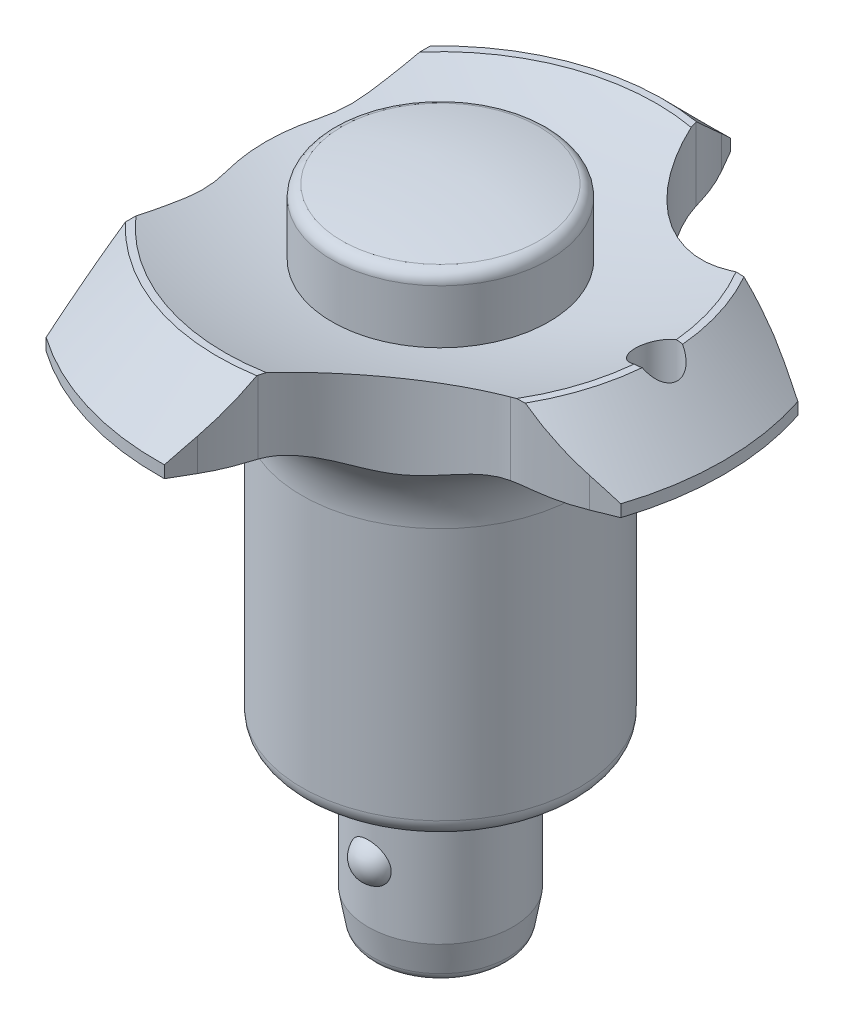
ISO-10303-21;
HEADER;
FILE_DESCRIPTION(('STEP AP214'),'2;1');
FILE_NAME('part.step','',(''),(''),'','','');
FILE_SCHEMA(('AUTOMOTIVE_DESIGN { 1 0 10303 214 1 1 1 1 }'));
ENDSEC;
DATA;
#1=APPLICATION_CONTEXT('core data for automotive mechanical design processes');
#2=APPLICATION_PROTOCOL_DEFINITION('international standard','automotive_design',2000,#1);
#3=PRODUCT_CONTEXT('',#1,'mechanical');
#4=PRODUCT('Part','Part','',(#3));
#5=PRODUCT_RELATED_PRODUCT_CATEGORY('part','',(#4));
#6=PRODUCT_DEFINITION_FORMATION('','',#4);
#7=PRODUCT_DEFINITION_CONTEXT('part definition',#1,'design');
#8=PRODUCT_DEFINITION('design','',#6,#7);
#9=PRODUCT_DEFINITION_SHAPE('','',#8);
#10=(LENGTH_UNIT() NAMED_UNIT(*) SI_UNIT(.MILLI.,.METRE.));
#11=(NAMED_UNIT(*) PLANE_ANGLE_UNIT() SI_UNIT($,.RADIAN.));
#12=(NAMED_UNIT(*) SI_UNIT($,.STERADIAN.) SOLID_ANGLE_UNIT());
#13=UNCERTAINTY_MEASURE_WITH_UNIT(LENGTH_MEASURE(1.E-05),#10,'distance_accuracy_value','');
#14=(GEOMETRIC_REPRESENTATION_CONTEXT(3) GLOBAL_UNCERTAINTY_ASSIGNED_CONTEXT((#13)) GLOBAL_UNIT_ASSIGNED_CONTEXT((#10,
#11,#12)) REPRESENTATION_CONTEXT('',''));
#15=CARTESIAN_POINT('',(0.,0.,0.));
#16=DIRECTION('',(0.,0.,1.));
#17=DIRECTION('',(1.,0.,0.));
#18=AXIS2_PLACEMENT_3D('',#15,#16,#17);
#19=CARTESIAN_POINT('',(0.,40.,0.));
#20=DIRECTION('',(0.,-1.,0.));
#21=DIRECTION('',(0.,0.,-1.));
#22=AXIS2_PLACEMENT_3D('',#19,#20,#21);
#23=CYLINDRICAL_SURFACE('',#22,9.);
#24=CARTESIAN_POINT('',(0.,38.1918358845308,0.));
#25=DIRECTION('',(0.,-1.,0.));
#26=DIRECTION('',(0.,0.,-1.));
#27=AXIS2_PLACEMENT_3D('',#24,#25,#26);
#28=CIRCLE('',#27,9.);
#29=CARTESIAN_POINT('',(0.,38.1918358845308,-9.));
#30=VERTEX_POINT('',#29);
#31=EDGE_CURVE('P0_E11',#30,#30,#28,.T.);
#32=ORIENTED_EDGE('',*,*,#31,.T.);
#33=EDGE_LOOP('',(#32));
#34=FACE_BOUND('',#33,.T.);
#35=CARTESIAN_POINT('',(0.,18.,0.));
#36=DIRECTION('',(0.,1.,0.));
#37=DIRECTION('',(0.,0.,1.));
#38=AXIS2_PLACEMENT_3D('',#35,#36,#37);
#39=CIRCLE('',#38,9.);
#40=CARTESIAN_POINT('',(0.,18.,9.));
#41=VERTEX_POINT('',#40);
#42=EDGE_CURVE('P0_E48',#41,#41,#39,.T.);
#43=ORIENTED_EDGE('',*,*,#42,.T.);
#44=EDGE_LOOP('',(#43));
#45=FACE_BOUND('',#44,.T.);
#46=ADVANCED_FACE('P0_F16',(#34,#45),#23,.T.);
#47=CARTESIAN_POINT('',(0.,18.,0.));
#48=DIRECTION('',(0.,1.,0.));
#49=DIRECTION('',(0.,0.,1.));
#50=AXIS2_PLACEMENT_3D('',#47,#48,#49);
#51=PLANE('',#50);
#52=ORIENTED_EDGE('',*,*,#42,.F.);
#53=EDGE_LOOP('',(#52));
#54=FACE_BOUND('',#53,.T.);
#55=ADVANCED_FACE('P0_F28',(#54),#51,.F.);
#56=CARTESIAN_POINT('',(0.,-0.999999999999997,0.));
#57=DIRECTION('',(0.,1.,0.));
#58=DIRECTION('',(-1.,0.,0.));
#59=AXIS2_PLACEMENT_3D('',#56,#57,#58);
#60=SPHERICAL_SURFACE('',#59,41.);
#61=CARTESIAN_POINT('',(0.,39.1716317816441,0.));
#62=DIRECTION('',(0.,-1.,0.));
#63=DIRECTION('',(0.,0.,-1.));
#64=AXIS2_PLACEMENT_3D('',#61,#62,#63);
#65=CIRCLE('',#64,8.2);
#66=CARTESIAN_POINT('',(0.,39.1716317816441,-8.2));
#67=VERTEX_POINT('',#66);
#68=EDGE_CURVE('P0_E23',#67,#67,#65,.F.);
#69=ORIENTED_EDGE('',*,*,#68,.T.);
#70=EDGE_LOOP('',(#69));
#71=FACE_BOUND('',#70,.T.);
#72=CARTESIAN_POINT('',(0.,40.,0.));
#73=VERTEX_POINT('',#72);
#74=VERTEX_LOOP('',#73);
#75=FACE_BOUND('',#74,.T.);
#76=ADVANCED_FACE('P0_F26',(#71,#75),#60,.T.);
#77=CARTESIAN_POINT('',(0.,38.1918358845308,0.));
#78=DIRECTION('',(0.,-1.,0.));
#79=DIRECTION('',(0.,0.,-1.));
#80=AXIS2_PLACEMENT_3D('',#77,#78,#79);
#81=TOROIDAL_SURFACE('',#80,8.,1.);
#82=ORIENTED_EDGE('',*,*,#31,.F.);
#83=EDGE_LOOP('',(#82));
#84=FACE_BOUND('',#83,.T.);
#85=ORIENTED_EDGE('',*,*,#68,.F.);
#86=EDGE_LOOP('',(#85));
#87=FACE_BOUND('',#86,.T.);
#88=ADVANCED_FACE('P0_F18',(#84,#87),#81,.T.);
#89=CLOSED_SHELL('',(#46,#55,#76,#88));
#90=MANIFOLD_SOLID_BREP('P0_B1',#89);
#91=CARTESIAN_POINT('',(-23.5,36.,0.));
#92=DIRECTION('',(0.,1.,0.));
#93=DIRECTION('',(-1.,0.,0.));
#94=AXIS2_PLACEMENT_3D('',#91,#92,#93);
#95=PLANE('',#94);
#96=CARTESIAN_POINT('',(0.,36.,0.));
#97=DIRECTION('',(0.,1.,0.));
#98=DIRECTION('',(-1.,0.,0.));
#99=AXIS2_PLACEMENT_3D('',#96,#97,#98);
#100=CIRCLE('',#99,17.9164728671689);
#101=CARTESIAN_POINT('',(17.8310068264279,36.,-1.74791177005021));
#102=VERTEX_POINT('',#101);
#103=CARTESIAN_POINT('',(15.4319392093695,36.,-9.10248604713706));
#104=VERTEX_POINT('',#103);
#105=EDGE_CURVE('P1_E287',#102,#104,#100,.T.);
#106=ORIENTED_EDGE('',*,*,#105,.F.);
#107=CARTESIAN_POINT('',(17.9164728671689,36.,0.));
#108=DIRECTION('',(0.,1.,0.));
#109=DIRECTION('',(0.,0.,1.));
#110=AXIS2_PLACEMENT_3D('',#107,#108,#109);
#111=CIRCLE('',#110,1.75);
#112=CARTESIAN_POINT('',(18.4240364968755,36.,-1.67477734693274));
#113=VERTEX_POINT('',#112);
#114=EDGE_CURVE('P1_E40',#113,#102,#111,.T.);
#115=ORIENTED_EDGE('',*,*,#114,.F.);
#116=CARTESIAN_POINT('',(0.,36.,0.));
#117=DIRECTION('',(0.,1.,0.));
#118=DIRECTION('',(-1.,0.,0.));
#119=AXIS2_PLACEMENT_3D('',#116,#117,#118);
#120=CIRCLE('',#119,18.5);
#121=CARTESIAN_POINT('',(16.1204041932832,36.,-9.07648437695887));
#122=VERTEX_POINT('',#121);
#123=EDGE_CURVE('P1_E231',#113,#122,#120,.T.);
#124=ORIENTED_EDGE('',*,*,#123,.T.);
#125=CARTESIAN_POINT('',(15.2479619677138,36.,4.89630505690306));
#126=DIRECTION('',(0.,-1.,0.));
#127=DIRECTION('',(0.,0.,-1.));
#128=AXIS2_PLACEMENT_3D('',#125,#126,#127);
#129=CIRCLE('',#128,14.);
#130=EDGE_CURVE('P1_E497',#104,#122,#129,.T.);
#131=ORIENTED_EDGE('',*,*,#130,.F.);
#132=EDGE_LOOP('',(#106,#115,#124,#131));
#133=FACE_BOUND('',#132,.T.);
#134=ADVANCED_FACE('P1_F16',(#133),#95,.T.);
#135=CARTESIAN_POINT('',(16.120404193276,36.,9.07648437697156));
#136=VERTEX_POINT('',#135);
#137=CARTESIAN_POINT('',(18.4240364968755,36.,1.67477734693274));
#138=VERTEX_POINT('',#137);
#139=EDGE_CURVE('P1_E229',#136,#138,#120,.T.);
#140=ORIENTED_EDGE('',*,*,#139,.T.);
#141=CARTESIAN_POINT('',(17.8310068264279,36.,1.74791177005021));
#142=VERTEX_POINT('',#141);
#143=EDGE_CURVE('P1_E213',#142,#138,#111,.T.);
#144=ORIENTED_EDGE('',*,*,#143,.F.);
#145=CARTESIAN_POINT('',(15.4319392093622,36.,9.1024860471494));
#146=VERTEX_POINT('',#145);
#147=EDGE_CURVE('P1_E285',#146,#142,#100,.T.);
#148=ORIENTED_EDGE('',*,*,#147,.F.);
#149=CARTESIAN_POINT('',(15.2479619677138,36.,-4.89630505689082));
#150=DIRECTION('',(0.,-1.,0.));
#151=DIRECTION('',(0.,0.,1.));
#152=AXIS2_PLACEMENT_3D('',#149,#150,#151);
#153=CIRCLE('',#152,14.);
#154=EDGE_CURVE('P1_E236',#136,#146,#153,.T.);
#155=ORIENTED_EDGE('',*,*,#154,.F.);
#156=EDGE_LOOP('',(#140,#144,#148,#155));
#157=FACE_BOUND('',#156,.T.);
#158=ADVANCED_FACE('P1_F235',(#157),#95,.T.);
#159=CARTESIAN_POINT('',(-19.,30.,0.));
#160=DIRECTION('',(0.,-1.,0.));
#161=DIRECTION('',(1.,0.,0.));
#162=AXIS2_PLACEMENT_3D('',#159,#160,#161);
#163=PLANE('',#162);
#164=CARTESIAN_POINT('',(0.,30.,0.));
#165=DIRECTION('',(0.,1.,0.));
#166=DIRECTION('',(-1.,0.,0.));
#167=AXIS2_PLACEMENT_3D('',#164,#165,#166);
#168=CIRCLE('',#167,19.);
#169=CARTESIAN_POINT('',(16.7190893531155,30.,9.02618696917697));
#170=VERTEX_POINT('',#169);
#171=CARTESIAN_POINT('',(18.9472979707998,30.,1.41417806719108));
#172=VERTEX_POINT('',#171);
#173=EDGE_CURVE('P1_E265',#170,#172,#168,.T.);
#174=ORIENTED_EDGE('',*,*,#173,.T.);
#175=CARTESIAN_POINT('',(17.9164728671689,30.,0.));
#176=DIRECTION('',(0.,-1.,0.));
#177=DIRECTION('',(1.,0.,0.));
#178=AXIS2_PLACEMENT_3D('',#175,#176,#177);
#179=CIRCLE('',#178,1.75);
#180=CARTESIAN_POINT('',(18.9472979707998,30.,-1.41417806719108));
#181=VERTEX_POINT('',#180);
#182=EDGE_CURVE('P1_E32',#172,#181,#179,.F.);
#183=ORIENTED_EDGE('',*,*,#182,.T.);
#184=CARTESIAN_POINT('',(16.7190893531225,30.,-9.02618696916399));
#185=VERTEX_POINT('',#184);
#186=EDGE_CURVE('P1_E266',#181,#185,#168,.T.);
#187=ORIENTED_EDGE('',*,*,#186,.T.);
#188=CARTESIAN_POINT('',(15.2479619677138,30.,4.89630505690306));
#189=DIRECTION('',(0.,-1.,0.));
#190=DIRECTION('',(1.,0.,0.));
#191=AXIS2_PLACEMENT_3D('',#188,#189,#190);
#192=CIRCLE('',#191,14.);
#193=CARTESIAN_POINT('',(20.465066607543,30.,-8.09530066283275));
#194=VERTEX_POINT('',#193);
#195=EDGE_CURVE('P1_E767',#185,#194,#192,.T.);
#196=ORIENTED_EDGE('',*,*,#195,.T.);
#197=DIRECTION('',(0.927971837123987,0.,0.372650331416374));
#198=VECTOR('',#197,1.);
#199=CARTESIAN_POINT('',(-10.7201265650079,30.,-20.6184959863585));
#200=LINE('',#199,#198);
#201=CARTESIAN_POINT('',(22.321010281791,30.,-7.35));
#202=VERTEX_POINT('',#201);
#203=EDGE_CURVE('P1_E595',#194,#202,#200,.T.);
#204=ORIENTED_EDGE('',*,*,#203,.T.);
#205=CARTESIAN_POINT('',(0.,30.,0.));
#206=DIRECTION('',(0.,1.,0.));
#207=DIRECTION('',(-1.,0.,0.));
#208=AXIS2_PLACEMENT_3D('',#205,#206,#207);
#209=CIRCLE('',#208,23.5);
#210=CARTESIAN_POINT('',(22.321010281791,30.,7.35000000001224));
#211=VERTEX_POINT('',#210);
#212=EDGE_CURVE('P1_E251',#211,#202,#209,.T.);
#213=ORIENTED_EDGE('',*,*,#212,.F.);
#214=DIRECTION('',(-0.927971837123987,0.,0.372650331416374));
#215=VECTOR('',#214,1.);
#216=CARTESIAN_POINT('',(-10.7201265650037,30.,20.6184959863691));
#217=LINE('',#216,#215);
#218=CARTESIAN_POINT('',(20.465066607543,30.,8.09530066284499));
#219=VERTEX_POINT('',#218);
#220=EDGE_CURVE('P1_E708',#211,#219,#217,.T.);
#221=ORIENTED_EDGE('',*,*,#220,.T.);
#222=CARTESIAN_POINT('',(15.2479619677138,30.,-4.89630505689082));
#223=DIRECTION('',(0.,-1.,0.));
#224=DIRECTION('',(1.,0.,0.));
#225=AXIS2_PLACEMENT_3D('',#222,#223,#224);
#226=CIRCLE('',#225,14.);
#227=EDGE_CURVE('P1_E665',#219,#170,#226,.T.);
#228=ORIENTED_EDGE('',*,*,#227,.T.);
#229=EDGE_LOOP('',(#174,#183,#187,#196,#204,#213,#221,#228));
#230=FACE_BOUND('',#229,.T.);
#231=ADVANCED_FACE('P1_F612',(#230),#163,.T.);
#232=CARTESIAN_POINT('',(0.,22.5,0.));
#233=DIRECTION('',(0.,1.,0.));
#234=DIRECTION('',(-1.,0.,0.));
#235=AXIS2_PLACEMENT_3D('',#232,#233,#234);
#236=TOROIDAL_SURFACE('',#235,19.,7.5);
#237=CARTESIAN_POINT('',(0.,22.5,0.));
#238=DIRECTION('',(0.,1.,0.));
#239=DIRECTION('',(-1.,0.,0.));
#240=AXIS2_PLACEMENT_3D('',#237,#238,#239);
#241=CIRCLE('',#240,11.5);
#242=CARTESIAN_POINT('',(-11.5,22.5,0.));
#243=VERTEX_POINT('',#242);
#244=EDGE_CURVE('P1_E274',#243,#243,#241,.T.);
#245=ORIENTED_EDGE('',*,*,#244,.T.);
#246=EDGE_LOOP('',(#245));
#247=FACE_BOUND('',#246,.T.);
#248=ORIENTED_EDGE('',*,*,#186,.F.);
#249=CARTESIAN_POINT('',(19.0002,29.9998345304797,-1.37405804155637));
#250=CARTESIAN_POINT('',(18.9621670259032,30.0000721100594,-1.40405462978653));
#251=CARTESIAN_POINT('',(18.9229043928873,30.0000618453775,-1.43245842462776));
#252=CARTESIAN_POINT('',(18.8421643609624,29.99943926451,-1.48591451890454));
#253=CARTESIAN_POINT('',(18.8006869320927,29.998826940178,-1.51096677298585));
#254=CARTESIAN_POINT('',(18.6734351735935,29.9959303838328,-1.58077253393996));
#255=CARTESIAN_POINT('',(18.584719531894,29.992587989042,-1.62027093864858));
#256=CARTESIAN_POINT('',(18.4021303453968,29.9824016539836,-1.68404521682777));
#257=CARTESIAN_POINT('',(18.3082526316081,29.9755548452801,-1.7083085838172));
#258=CARTESIAN_POINT('',(18.1181618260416,29.9579679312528,-1.74100944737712));
#259=CARTESIAN_POINT('',(18.0219496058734,29.9472292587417,-1.74945276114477));
#260=CARTESIAN_POINT('',(17.8303366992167,29.9218778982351,-1.75049381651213));
#261=CARTESIAN_POINT('',(17.7349343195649,29.9072800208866,-1.7431513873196));
#262=CARTESIAN_POINT('',(17.5471606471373,29.8745519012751,-1.71322871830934));
#263=CARTESIAN_POINT('',(17.4547903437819,29.8564205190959,-1.69064355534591));
#264=CARTESIAN_POINT('',(17.2734017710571,29.8169200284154,-1.63042918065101));
#265=CARTESIAN_POINT('',(17.1845073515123,29.7954867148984,-1.59246980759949));
#266=CARTESIAN_POINT('',(17.0144903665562,29.7508341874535,-1.50272225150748));
#267=CARTESIAN_POINT('',(16.9333693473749,29.7276146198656,-1.45093132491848));
#268=CARTESIAN_POINT('',(16.7775437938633,29.6798339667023,-1.33241085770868));
#269=CARTESIAN_POINT('',(16.7032498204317,29.655257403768,-1.26514688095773));
#270=CARTESIAN_POINT('',(16.5669685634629,29.6075854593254,-1.11863761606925));
#271=CARTESIAN_POINT('',(16.5049842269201,29.584490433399,-1.03938946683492));
#272=CARTESIAN_POINT('',(16.3947891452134,29.5417064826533,-0.870191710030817));
#273=CARTESIAN_POINT('',(16.3466708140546,29.5220407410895,-0.78017571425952));
#274=CARTESIAN_POINT('',(16.2665762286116,29.4884206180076,-0.592245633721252));
#275=CARTESIAN_POINT('',(16.2345892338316,29.4744624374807,-0.494336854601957));
#276=CARTESIAN_POINT('',(16.1897704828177,29.4546698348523,-0.300388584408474));
#277=CARTESIAN_POINT('',(16.175801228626,29.4483547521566,-0.204661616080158));
#278=CARTESIAN_POINT('',(16.1638587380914,29.442965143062,-0.0120283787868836));
#279=CARTESIAN_POINT('',(16.1658787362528,29.4438875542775,0.0848773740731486));
#280=CARTESIAN_POINT('',(16.1851398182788,29.452552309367,0.270399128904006));
#281=CARTESIAN_POINT('',(16.201378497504,29.4598454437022,0.359143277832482));
#282=CARTESIAN_POINT('',(16.2470514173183,29.4798790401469,0.532513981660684));
#283=CARTESIAN_POINT('',(16.2764877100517,29.4926203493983,0.617139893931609));
#284=CARTESIAN_POINT('',(16.3484657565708,29.5227477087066,0.782428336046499));
#285=CARTESIAN_POINT('',(16.3913311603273,29.540246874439,0.86292857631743));
#286=CARTESIAN_POINT('',(16.488610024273,29.5782278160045,1.01583807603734));
#287=CARTESIAN_POINT('',(16.543027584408,29.5987106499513,1.08824444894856));
#288=CARTESIAN_POINT('',(16.6668822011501,29.6428521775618,1.22902424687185));
#289=CARTESIAN_POINT('',(16.7371737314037,29.6666338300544,1.29660869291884));
#290=CARTESIAN_POINT('',(16.8879984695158,29.7141504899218,1.41922194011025));
#291=CARTESIAN_POINT('',(16.9685343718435,29.7378854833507,1.47424742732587));
#292=CARTESIAN_POINT('',(17.1413972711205,29.7846942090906,1.57226489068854));
#293=CARTESIAN_POINT('',(17.2340680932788,29.8077030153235,1.61468428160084));
#294=CARTESIAN_POINT('',(17.4260077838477,29.8506027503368,1.68294764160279));
#295=CARTESIAN_POINT('',(17.5252754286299,29.8704942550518,1.70879467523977));
#296=CARTESIAN_POINT('',(17.7248461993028,29.9057260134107,1.74233896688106));
#297=CARTESIAN_POINT('',(17.8250527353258,29.9211725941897,1.75049754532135));
#298=CARTESIAN_POINT('',(18.0259610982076,29.9477661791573,1.74945581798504));
#299=CARTESIAN_POINT('',(18.1266628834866,29.9589135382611,1.74025694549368));
#300=CARTESIAN_POINT('',(18.3214901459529,29.9766047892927,1.70525235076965));
#301=CARTESIAN_POINT('',(18.4157195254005,29.9833094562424,1.68009992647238));
#302=CARTESIAN_POINT('',(18.5988094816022,29.9932000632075,1.61441991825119));
#303=CARTESIAN_POINT('',(18.6876751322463,29.9963893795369,1.57390713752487));
#304=CARTESIAN_POINT('',(18.8124061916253,29.9990115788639,1.5039636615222));
#305=CARTESIAN_POINT('',(18.8514207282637,29.9995392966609,1.48002297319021));
#306=CARTESIAN_POINT('',(18.9273846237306,30.0000621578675,1.42920894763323));
#307=CARTESIAN_POINT('',(18.9643378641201,30.0000583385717,1.40234142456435));
#308=CARTESIAN_POINT('',(19.0002,29.9998345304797,1.37405804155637));
#309=B_SPLINE_CURVE_WITH_KNOTS('',3,(#249,#250,#251,#252,#253,#254,#255,#256,#257,#258,#259,
#260,#261,#262,#263,#264,#265,#266,#267,#268,#269,#270,#271,#272,#273,#274,#275,#276,#277,#278,
#279,#280,#281,#282,#283,#284,#285,#286,#287,#288,#289,#290,#291,#292,#293,#294,#295,#296,#297,
#298,#299,#300,#301,#302,#303,#304,#305,#306,#307,#308),.UNSPECIFIED.,.F.,.F.,(4,2,2,2,2,2,2,2,
2,2,2,2,2,2,2,2,2,2,2,2,2,2,2,2,2,2,2,2,2,4),(0.,0.145230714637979,0.29046339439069,
0.580469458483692,0.870713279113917,1.16085035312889,1.44988972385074,1.73902249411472,
2.03472475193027,2.33048570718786,2.63862322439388,2.94683442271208,3.25705463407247,
3.56706802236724,3.85635873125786,4.14552703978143,4.41581537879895,4.68614576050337,
4.96357032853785,5.24109352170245,5.54087080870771,5.84072710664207,6.15263607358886,
6.46448734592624,6.76810238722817,7.0716923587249,7.36358887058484,7.65520478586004,
7.79241563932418,7.92935872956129),.UNSPECIFIED.);
#310=EDGE_CURVE('P1_E232',#181,#172,#309,.T.);
#311=ORIENTED_EDGE('',*,*,#310,.T.);
#312=ORIENTED_EDGE('',*,*,#173,.F.);
#313=CARTESIAN_POINT('',(19.0002,29.7676490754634,8.59149349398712));
#314=CARTESIAN_POINT('',(18.7645817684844,29.8154776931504,8.65707959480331));
#315=CARTESIAN_POINT('',(18.5258665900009,29.8564543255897,8.71679949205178));
#316=CARTESIAN_POINT('',(18.0433655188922,29.9237457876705,8.82399353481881));
#317=CARTESIAN_POINT('',(17.7995737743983,29.9500426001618,8.87145259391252));
#318=CARTESIAN_POINT('',(17.3135741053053,29.9865231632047,8.95262184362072));
#319=CARTESIAN_POINT('',(17.0714332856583,29.9970209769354,8.98658985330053));
#320=CARTESIAN_POINT('',(16.5857032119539,30.0018812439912,9.04177656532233));
#321=CARTESIAN_POINT('',(16.3421152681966,29.9962565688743,9.06300542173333));
#322=CARTESIAN_POINT('',(15.9045129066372,29.9707577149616,9.08964322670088));
#323=CARTESIAN_POINT('',(15.7104540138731,29.9540015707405,9.09738600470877));
#324=CARTESIAN_POINT('',(15.3219339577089,29.9089292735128,9.10486432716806));
#325=CARTESIAN_POINT('',(15.1274823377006,29.8805202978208,9.10453429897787));
#326=CARTESIAN_POINT('',(14.9341448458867,29.8460787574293,9.10017731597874));
#327=B_SPLINE_CURVE_WITH_KNOTS('',3,(#313,#314,#315,#316,#317,#318,#319,#320,#321,#322,#323,
#324,#325,#326),.UNSPECIFIED.,.F.,.F.,(4,2,2,2,2,2,4),(0.,0.747551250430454,1.49601799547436,
2.22940004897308,2.96219676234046,3.54651953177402,4.13559011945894),.UNSPECIFIED.);
#328=CARTESIAN_POINT('',(14.9343448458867,29.8461143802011,9.10018179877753));
#329=VERTEX_POINT('',#328);
#330=EDGE_CURVE('P1_E662',#170,#329,#327,.T.);
#331=ORIENTED_EDGE('',*,*,#330,.T.);
#332=CARTESIAN_POINT('',(14.9345448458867,29.8461499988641,9.1001862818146));
#333=CARTESIAN_POINT('',(14.7776730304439,29.8182229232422,9.09666592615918));
#334=CARTESIAN_POINT('',(14.6213761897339,29.7868945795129,9.0962420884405));
#335=CARTESIAN_POINT('',(14.3102869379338,29.7182450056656,9.10142249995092));
#336=CARTESIAN_POINT('',(14.1554937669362,29.6809269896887,9.10702352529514));
#337=CARTESIAN_POINT('',(13.8480463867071,29.6011924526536,9.12406045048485));
#338=CARTESIAN_POINT('',(13.6953872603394,29.558791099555,9.13547930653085));
#339=CARTESIAN_POINT('',(13.3918757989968,29.4696235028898,9.16398000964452));
#340=CARTESIAN_POINT('',(13.2410237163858,29.4228566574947,9.18106263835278));
#341=CARTESIAN_POINT('',(12.7875574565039,29.2760524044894,9.24107419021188));
#342=CARTESIAN_POINT('',(12.4878197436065,29.1705318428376,9.2925514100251));
#343=CARTESIAN_POINT('',(11.8954511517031,28.9523945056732,9.41733991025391));
#344=CARTESIAN_POINT('',(11.6028250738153,28.8397731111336,9.49066552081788));
#345=CARTESIAN_POINT('',(11.0926476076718,28.6428308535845,9.63910928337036));
#346=CARTESIAN_POINT('',(10.8738718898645,28.5581805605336,9.70960863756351));
#347=CARTESIAN_POINT('',(10.4388960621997,28.3943373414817,9.86379108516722));
#348=CARTESIAN_POINT('',(10.2226957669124,28.3151440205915,9.94747322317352));
#349=CARTESIAN_POINT('',(9.79395589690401,28.1682154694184,10.1280569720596));
#350=CARTESIAN_POINT('',(9.58140098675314,28.1003976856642,10.2248532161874));
#351=CARTESIAN_POINT('',(9.15855200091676,27.9817636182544,10.4328111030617));
#352=CARTESIAN_POINT('',(8.94825640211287,27.9309350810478,10.5439623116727));
#353=CARTESIAN_POINT('',(8.58999154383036,27.8634617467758,10.747410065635));
#354=CARTESIAN_POINT('',(8.44110862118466,27.84122530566,10.836232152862));
#355=CARTESIAN_POINT('',(8.14633439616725,27.8104352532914,11.0209454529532));
#356=CARTESIAN_POINT('',(8.00044250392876,27.8018789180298,11.1168352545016));
#357=CARTESIAN_POINT('',(7.71306255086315,27.7991870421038,11.3148595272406));
#358=CARTESIAN_POINT('',(7.57156970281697,27.8050352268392,11.4169868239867));
#359=CARTESIAN_POINT('',(7.29397056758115,27.8306044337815,11.6266694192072));
#360=CARTESIAN_POINT('',(7.15786521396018,27.8503278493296,11.7342256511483));
#361=CARTESIAN_POINT('',(6.8451762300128,27.9111902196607,11.9924277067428));
#362=CARTESIAN_POINT('',(6.67114087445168,27.9574144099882,12.1449541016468));
#363=CARTESIAN_POINT('',(6.33499245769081,28.0668600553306,12.4568670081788));
#364=CARTESIAN_POINT('',(6.17288820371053,28.1300939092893,12.6162584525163));
#365=CARTESIAN_POINT('',(5.8588669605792,28.2683729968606,12.9427574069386));
#366=CARTESIAN_POINT('',(5.70705355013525,28.3435184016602,13.1099209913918));
#367=CARTESIAN_POINT('',(5.41445292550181,28.5000172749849,13.4507337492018));
#368=CARTESIAN_POINT('',(5.27366434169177,28.5813699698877,13.6243821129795));
#369=CARTESIAN_POINT('',(4.94422002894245,28.781188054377,14.0545977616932));
#370=CARTESIAN_POINT('',(4.76089734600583,28.9006217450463,14.3148176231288));
#371=CARTESIAN_POINT('',(4.41415052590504,29.1328851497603,14.851278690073));
#372=CARTESIAN_POINT('',(4.25073675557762,29.2457114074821,15.1275281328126));
#373=CARTESIAN_POINT('',(3.94580620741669,29.4548897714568,15.6943820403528));
#374=CARTESIAN_POINT('',(3.80410495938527,29.5513814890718,15.9848342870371));
#375=CARTESIAN_POINT('',(3.54271052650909,29.7210428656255,16.5817874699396));
#376=CARTESIAN_POINT('',(3.42298501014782,29.7942469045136,16.888263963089));
#377=CARTESIAN_POINT('',(3.26107257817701,29.8814375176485,17.3600045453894));
#378=CARTESIAN_POINT('',(3.20982780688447,29.9068037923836,17.5201218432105));
#379=CARTESIAN_POINT('',(3.11365433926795,29.948991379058,17.8440401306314));
#380=CARTESIAN_POINT('',(3.06875130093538,29.9657786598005,18.0078531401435));
#381=CARTESIAN_POINT('',(3.02727508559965,29.9778008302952,18.1729580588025));
#382=B_SPLINE_CURVE_WITH_KNOTS('',3,(#332,#333,#334,#335,#336,#337,#338,#339,#340,#341,#342,
#343,#344,#345,#346,#347,#348,#349,#350,#351,#352,#353,#354,#355,#356,#357,#358,#359,#360,#361,
#362,#363,#364,#365,#366,#367,#368,#369,#370,#371,#372,#373,#374,#375,#376,#377,#378,#379,#380,
#381),.UNSPECIFIED.,.F.,.F.,(4,2,2,2,2,2,2,2,2,2,2,2,2,2,2,2,2,2,2,2,2,2,2,2,4),(0.,
0.47800831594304,0.955760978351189,1.43212200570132,1.90854880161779,2.87314250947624,
3.83837028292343,4.5728575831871,5.3072916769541,6.03614076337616,6.7644630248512,
7.28819341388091,7.81181950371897,8.33485425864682,8.85797925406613,9.56460548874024,
10.271748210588,10.9851883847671,11.6985397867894,12.7174996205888,13.7369877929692,
14.7472664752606,15.7560466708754,16.2657760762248,16.7775120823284),.UNSPECIFIED.);
#383=CARTESIAN_POINT('',(3.02732533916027,29.977786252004,18.1727580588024));
#384=VERTEX_POINT('',#383);
#385=EDGE_CURVE('P1_E668',#329,#384,#382,.T.);
#386=ORIENTED_EDGE('',*,*,#385,.T.);
#387=CARTESIAN_POINT('',(3.02737559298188,29.9777716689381,18.1725580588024));
#388=CARTESIAN_POINT('',(3.00992607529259,29.9828366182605,18.2420077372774));
#389=CARTESIAN_POINT('',(2.99192781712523,29.9870243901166,18.3113828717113));
#390=CARTESIAN_POINT('',(2.95486116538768,29.9936665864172,18.4498703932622));
#391=CARTESIAN_POINT('',(2.93579364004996,29.9961223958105,18.5189829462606));
#392=CARTESIAN_POINT('',(2.89658780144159,29.9993297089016,18.6569430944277));
#393=CARTESIAN_POINT('',(2.87644948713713,30.000081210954,18.7257906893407));
#394=CARTESIAN_POINT('',(2.83510131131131,29.999904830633,18.8632214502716));
#395=CARTESIAN_POINT('',(2.81389060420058,29.9989756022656,18.931804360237));
#396=CARTESIAN_POINT('',(2.79215946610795,29.9972178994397,19.0002));
#397=B_SPLINE_CURVE_WITH_KNOTS('',3,(#387,#388,#389,#390,#391,#392,#393,#394,#395,#396),
.UNSPECIFIED.,.F.,.F.,(4,2,2,2,4),(0.,0.215353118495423,0.430533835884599,0.645714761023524,
0.861068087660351),.UNSPECIFIED.);
#398=CARTESIAN_POINT('',(2.85903351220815,30.,18.7836611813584));
#399=VERTEX_POINT('',#398);
#400=EDGE_CURVE('P1_E481',#384,#399,#397,.T.);
#401=ORIENTED_EDGE('',*,*,#400,.T.);
#402=CARTESIAN_POINT('',(-13.5,30.,13.3697419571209));
#403=VERTEX_POINT('',#402);
#404=EDGE_CURVE('P1_E258',#403,#399,#168,.T.);
#405=ORIENTED_EDGE('',*,*,#404,.F.);
#406=CARTESIAN_POINT('',(-13.5,29.9987556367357,13.1748723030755));
#407=CARTESIAN_POINT('',(-13.5,29.9924168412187,12.6770440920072));
#408=CARTESIAN_POINT('',(-13.5,29.9620587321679,12.1794760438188));
#409=CARTESIAN_POINT('',(-13.5,29.8617802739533,11.1882999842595));
#410=CARTESIAN_POINT('',(-13.5,29.7918313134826,10.6946950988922));
#411=CARTESIAN_POINT('',(-13.5,29.6203417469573,9.7082076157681));
#412=CARTESIAN_POINT('',(-13.5,29.5184998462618,9.21537895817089));
#413=CARTESIAN_POINT('',(-13.5,29.2930418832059,8.2350970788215));
#414=CARTESIAN_POINT('',(-13.5,29.1694344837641,7.74764180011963));
#415=CARTESIAN_POINT('',(-13.5,28.9580918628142,6.95271991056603));
#416=CARTESIAN_POINT('',(-13.5,28.8736826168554,6.64434256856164));
#417=CARTESIAN_POINT('',(-13.5,28.703475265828,6.02796072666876));
#418=CARTESIAN_POINT('',(-13.5,28.6176771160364,5.71995623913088));
#419=CARTESIAN_POINT('',(-13.5,28.4481300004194,5.10298447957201));
#420=CARTESIAN_POINT('',(-13.5,28.3643835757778,4.79401649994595));
#421=CARTESIAN_POINT('',(-13.5,28.203142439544,4.17441495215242));
#422=CARTESIAN_POINT('',(-13.5,28.1256478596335,3.86378134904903));
#423=CARTESIAN_POINT('',(-13.5,27.9830335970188,3.24620608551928));
#424=CARTESIAN_POINT('',(-13.5,27.9176963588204,2.93931583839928));
#425=CARTESIAN_POINT('',(-13.5,27.8022482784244,2.32263897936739));
#426=CARTESIAN_POINT('',(-13.5,27.7521362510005,2.01285259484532));
#427=CARTESIAN_POINT('',(-13.5,27.6717492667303,1.39150502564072));
#428=CARTESIAN_POINT('',(-13.5,27.6414178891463,1.07995146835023));
#429=CARTESIAN_POINT('',(-13.5,27.6129625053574,0.611642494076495));
#430=CARTESIAN_POINT('',(-13.5,27.6063176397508,0.455377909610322));
#431=CARTESIAN_POINT('',(-13.5,27.598861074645,0.142712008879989));
#432=CARTESIAN_POINT('',(-13.5,27.59804915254,-0.0136893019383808));
#433=CARTESIAN_POINT('',(-13.5,27.6031913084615,-0.39200451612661));
#434=CARTESIAN_POINT('',(-13.5,27.6121259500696,-0.613883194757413));
#435=CARTESIAN_POINT('',(-13.5,27.6413369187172,-1.05687794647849));
#436=CARTESIAN_POINT('',(-13.5,27.6616135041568,-1.27799400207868));
#437=CARTESIAN_POINT('',(-13.5,27.7124648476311,-1.71936790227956));
#438=CARTESIAN_POINT('',(-13.5,27.7430554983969,-1.93962388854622));
#439=CARTESIAN_POINT('',(-13.5,27.8130621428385,-2.37871324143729));
#440=CARTESIAN_POINT('',(-13.5,27.8524784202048,-2.59754656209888));
#441=CARTESIAN_POINT('',(-13.5,27.9829914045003,-3.25964463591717));
#442=CARTESIAN_POINT('',(-13.5,28.0853395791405,-3.7006686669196));
#443=CARTESIAN_POINT('',(-13.5,28.250681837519,-4.35895221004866));
#444=CARTESIAN_POINT('',(-13.5,28.3077554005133,-4.57780168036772));
#445=CARTESIAN_POINT('',(-13.5,28.4243226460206,-5.014858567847));
#446=CARTESIAN_POINT('',(-13.5,28.4838162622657,-5.23306600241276));
#447=CARTESIAN_POINT('',(-13.5,28.6287855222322,-5.76000994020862));
#448=CARTESIAN_POINT('',(-13.5,28.7147638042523,-6.06860511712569));
#449=CARTESIAN_POINT('',(-13.5,28.8851748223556,-6.68623047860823));
#450=CARTESIAN_POINT('',(-13.5,28.9696075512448,-6.99526066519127));
#451=CARTESIAN_POINT('',(-13.5,29.1338478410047,-7.61467540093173));
#452=CARTESIAN_POINT('',(-13.5,29.2136538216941,-7.92506037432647));
#453=CARTESIAN_POINT('',(-13.5,29.365807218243,-8.54767359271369));
#454=CARTESIAN_POINT('',(-13.5,29.4381546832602,-8.85990182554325));
#455=CARTESIAN_POINT('',(-13.5,29.5720143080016,-9.48287595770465));
#456=CARTESIAN_POINT('',(-13.5,29.6336433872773,-9.79359642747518));
#457=CARTESIAN_POINT('',(-13.5,29.7447204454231,-10.417241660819));
#458=CARTESIAN_POINT('',(-13.5,29.7941682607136,-10.7301664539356));
#459=CARTESIAN_POINT('',(-13.5,29.878553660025,-11.3576940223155));
#460=CARTESIAN_POINT('',(-13.5,29.9135051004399,-11.6722949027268));
#461=CARTESIAN_POINT('',(-13.5,29.9667331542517,-12.3028943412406));
#462=CARTESIAN_POINT('',(-13.5,29.9850124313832,-12.6188926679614));
#463=CARTESIAN_POINT('',(-13.5,30.0022109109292,-13.2332096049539));
#464=CARTESIAN_POINT('',(-13.5,30.0021857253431,-13.5314969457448));
#465=CARTESIAN_POINT('',(-13.5,29.9836150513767,-14.1274414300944));
#466=CARTESIAN_POINT('',(-13.5,29.9650752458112,-14.42509873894));
#467=CARTESIAN_POINT('',(-13.5,29.9076562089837,-15.0195846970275));
#468=CARTESIAN_POINT('',(-13.5,29.86870294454,-15.3164063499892));
#469=CARTESIAN_POINT('',(-13.5,29.7687719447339,-15.9063618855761));
#470=CARTESIAN_POINT('',(-13.5,29.7077944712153,-16.1994958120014));
#471=CARTESIAN_POINT('',(-13.5,29.5615487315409,-16.7830242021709));
#472=CARTESIAN_POINT('',(-13.5,29.4760281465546,-17.0733560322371));
#473=CARTESIAN_POINT('',(-13.5,29.2796861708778,-17.6453264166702));
#474=CARTESIAN_POINT('',(-13.5,29.1688706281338,-17.9269669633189));
#475=CARTESIAN_POINT('',(-13.5,28.9212562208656,-18.4778682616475));
#476=CARTESIAN_POINT('',(-13.5,28.7845174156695,-18.747155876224));
#477=CARTESIAN_POINT('',(-13.5,28.4844149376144,-19.2704379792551));
#478=CARTESIAN_POINT('',(-13.5,28.3210631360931,-19.524439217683));
#479=CARTESIAN_POINT('',(-13.5,28.0201042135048,-19.9409786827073));
#480=CARTESIAN_POINT('',(-13.5,27.8891595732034,-20.1083597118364));
#481=CARTESIAN_POINT('',(-13.5,27.614382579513,-20.4321691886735));
#482=CARTESIAN_POINT('',(-13.5,27.470553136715,-20.5886000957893));
#483=CARTESIAN_POINT('',(-13.5,27.1704413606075,-20.8890343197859));
#484=CARTESIAN_POINT('',(-13.5,27.0141593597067,-21.0330379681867));
#485=CARTESIAN_POINT('',(-13.5,26.6897990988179,-21.3071275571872));
#486=CARTESIAN_POINT('',(-13.5,26.5217203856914,-21.4372129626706));
#487=CARTESIAN_POINT('',(-13.5,26.1736846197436,-21.6826822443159));
#488=CARTESIAN_POINT('',(-13.5,25.9936651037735,-21.7979777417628));
#489=CARTESIAN_POINT('',(-13.5,25.6238025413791,-22.0115537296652));
#490=CARTESIAN_POINT('',(-13.5,25.4339603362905,-22.109835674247));
#491=CARTESIAN_POINT('',(-13.5,25.0459142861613,-22.288072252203));
#492=CARTESIAN_POINT('',(-13.5,24.8477129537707,-22.368032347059));
#493=CARTESIAN_POINT('',(-13.5,24.4445484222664,-22.5085422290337));
#494=CARTESIAN_POINT('',(-13.5,24.2395859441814,-22.5690940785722));
#495=CARTESIAN_POINT('',(-13.5,23.845409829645,-22.6648938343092));
#496=CARTESIAN_POINT('',(-13.5,23.6566606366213,-22.7020612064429));
#497=CARTESIAN_POINT('',(-13.5,23.2766143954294,-22.7595086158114));
#498=CARTESIAN_POINT('',(-13.5,23.0853175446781,-22.7797899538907));
#499=CARTESIAN_POINT('',(-13.5,22.7017424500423,-22.8032128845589));
#500=CARTESIAN_POINT('',(-13.5,22.5094645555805,-22.8063602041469));
#501=CARTESIAN_POINT('',(-13.5,22.1253956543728,-22.7954913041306));
#502=CARTESIAN_POINT('',(-13.5,21.9336046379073,-22.7814754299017));
#503=CARTESIAN_POINT('',(-13.5,21.5620262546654,-22.7376357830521));
#504=CARTESIAN_POINT('',(-13.5,21.382136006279,-22.7086777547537));
#505=CARTESIAN_POINT('',(-13.5,21.0253491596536,-22.6358137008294));
#506=CARTESIAN_POINT('',(-13.5,20.8484535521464,-22.5919028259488));
#507=CARTESIAN_POINT('',(-13.5,20.4989658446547,-22.4896248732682));
#508=CARTESIAN_POINT('',(-13.5,20.3263722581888,-22.4312628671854));
#509=CARTESIAN_POINT('',(-13.5,19.9864527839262,-22.3006582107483));
#510=CARTESIAN_POINT('',(-13.5,19.8191289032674,-22.2284103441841));
#511=CARTESIAN_POINT('',(-13.5,19.4877351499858,-22.0692983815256));
#512=CARTESIAN_POINT('',(-13.5,19.3237842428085,-21.9821867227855));
#513=CARTESIAN_POINT('',(-13.5,19.0032931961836,-21.7951520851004));
#514=CARTESIAN_POINT('',(-13.5,18.8467557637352,-21.6952244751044));
#515=CARTESIAN_POINT('',(-13.5,18.5419871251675,-21.4835596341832));
#516=CARTESIAN_POINT('',(-13.5,18.3937525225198,-21.3718272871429));
#517=CARTESIAN_POINT('',(-13.5,18.1060980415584,-21.1374586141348));
#518=CARTESIAN_POINT('',(-13.5,17.9666813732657,-21.0148183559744));
#519=CARTESIAN_POINT('',(-13.5,17.6863078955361,-20.7493457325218));
#520=CARTESIAN_POINT('',(-13.5,17.5461377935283,-20.6056825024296));
#521=CARTESIAN_POINT('',(-13.5,17.2771242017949,-20.3080309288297));
#522=CARTESIAN_POINT('',(-13.5,17.148285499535,-20.154038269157));
#523=CARTESIAN_POINT('',(-13.5,16.9021770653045,-19.8368972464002));
#524=CARTESIAN_POINT('',(-13.5,16.7849162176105,-19.6737420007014));
#525=CARTESIAN_POINT('',(-13.5,16.5621878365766,-19.3395637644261));
#526=CARTESIAN_POINT('',(-13.5,16.4567217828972,-19.1685397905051));
#527=CARTESIAN_POINT('',(-13.5,16.2435133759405,-18.7951173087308));
#528=CARTESIAN_POINT('',(-13.5,16.137554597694,-18.5916998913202));
#529=CARTESIAN_POINT('',(-13.5,15.9408045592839,-18.1776569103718));
#530=CARTESIAN_POINT('',(-13.5,15.850015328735,-17.9670303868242));
#531=CARTESIAN_POINT('',(-13.5,15.683405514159,-17.5403818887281));
#532=CARTESIAN_POINT('',(-13.5,15.6075588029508,-17.324370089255));
#533=CARTESIAN_POINT('',(-13.5,15.4701632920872,-16.8879105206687));
#534=CARTESIAN_POINT('',(-13.5,15.4086128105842,-16.6674632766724));
#535=CARTESIAN_POINT('',(-13.5,15.2670791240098,-16.0926869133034));
#536=CARTESIAN_POINT('',(-13.5,15.1974994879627,-15.7357636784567));
#537=CARTESIAN_POINT('',(-13.5,15.0901312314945,-15.0168555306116));
#538=CARTESIAN_POINT('',(-13.5,15.0523841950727,-14.6548646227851));
#539=CARTESIAN_POINT('',(-13.5,15.0055880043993,-13.9260016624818));
#540=CARTESIAN_POINT('',(-13.5,14.9967840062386,-13.5591142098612));
#541=CARTESIAN_POINT('',(-13.5,15.0031487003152,-13.0095769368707));
#542=CARTESIAN_POINT('',(-13.5,15.0085147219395,-12.8267393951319));
#543=CARTESIAN_POINT('',(-13.5,15.0253205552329,-12.4613413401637));
#544=CARTESIAN_POINT('',(-13.5,15.0367603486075,-12.2787808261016));
#545=CARTESIAN_POINT('',(-13.5,15.079192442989,-11.7364984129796));
#546=CARTESIAN_POINT('',(-13.5,15.1183763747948,-11.3774025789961));
#547=CARTESIAN_POINT('',(-13.5,15.2154863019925,-10.661714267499));
#548=CARTESIAN_POINT('',(-13.5,15.2734187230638,-10.3051226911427));
#549=CARTESIAN_POINT('',(-13.5,15.4046844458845,-9.59448136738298));
#550=CARTESIAN_POINT('',(-13.5,15.4780321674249,-9.24043432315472));
#551=CARTESIAN_POINT('',(-13.5,15.6365290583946,-8.53506811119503));
#552=CARTESIAN_POINT('',(-13.5,15.7216772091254,-8.18374871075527));
#553=CARTESIAN_POINT('',(-13.5,15.9001867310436,-7.4823191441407));
#554=CARTESIAN_POINT('',(-13.5,15.9935676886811,-7.13221404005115));
#555=CARTESIAN_POINT('',(-13.5,16.1841157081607,-6.43304311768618));
#556=CARTESIAN_POINT('',(-13.5,16.2812828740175,-6.08397732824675));
#557=CARTESIAN_POINT('',(-13.5,16.4746449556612,-5.38513895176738));
#558=CARTESIAN_POINT('',(-13.5,16.5708386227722,-5.03536601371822));
#559=CARTESIAN_POINT('',(-13.5,16.7564205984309,-4.3339385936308));
#560=CARTESIAN_POINT('',(-13.5,16.8458082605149,-3.98228393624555));
#561=CARTESIAN_POINT('',(-13.5,17.0117222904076,-3.27303931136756));
#562=CARTESIAN_POINT('',(-13.5,17.0881452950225,-2.91542452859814));
#563=CARTESIAN_POINT('',(-13.5,17.2197408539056,-2.19620106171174));
#564=CARTESIAN_POINT('',(-13.5,17.2749186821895,-1.83459339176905));
#565=CARTESIAN_POINT('',(-13.5,17.336561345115,-1.29065179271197));
#566=CARTESIAN_POINT('',(-13.5,17.3535732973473,-1.10949764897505));
#567=CARTESIAN_POINT('',(-13.5,17.3800792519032,-0.746630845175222));
#568=CARTESIAN_POINT('',(-13.5,17.3895733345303,-0.564918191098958));
#569=CARTESIAN_POINT('',(-13.5,17.4006762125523,-0.201276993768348));
#570=CARTESIAN_POINT('',(-13.5,17.4022861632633,-0.0193484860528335));
#571=CARTESIAN_POINT('',(-13.5,17.397564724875,0.344404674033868));
#572=CARTESIAN_POINT('',(-13.5,17.3912333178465,0.526229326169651));
#573=CARTESIAN_POINT('',(-13.5,17.370879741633,0.889241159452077));
#574=CARTESIAN_POINT('',(-13.5,17.3568661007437,1.07042882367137));
#575=CARTESIAN_POINT('',(-13.5,17.3216694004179,1.43211405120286));
#576=CARTESIAN_POINT('',(-13.5,17.3004855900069,1.6126115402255));
#577=CARTESIAN_POINT('',(-13.5,17.2272119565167,2.15285393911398));
#578=CARTESIAN_POINT('',(-13.5,17.1654037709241,2.51128791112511));
#579=CARTESIAN_POINT('',(-13.5,17.0226182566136,3.22598164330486));
#580=CARTESIAN_POINT('',(-13.5,16.9415476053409,3.58222187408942));
#581=CARTESIAN_POINT('',(-13.5,16.7678033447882,4.29176197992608));
#582=CARTESIAN_POINT('',(-13.5,16.6751306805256,4.64506209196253));
#583=CARTESIAN_POINT('',(-13.5,16.4860053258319,5.34545068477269));
#584=CARTESIAN_POINT('',(-13.5,16.389621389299,5.69255818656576));
#585=CARTESIAN_POINT('',(-13.5,16.1974267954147,6.3862796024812));
#586=CARTESIAN_POINT('',(-13.5,16.1016154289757,6.73289331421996));
#587=CARTESIAN_POINT('',(-13.5,15.9149757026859,7.42741345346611));
#588=CARTESIAN_POINT('',(-13.5,15.8241464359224,7.77531963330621));
#589=CARTESIAN_POINT('',(-13.5,15.651437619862,8.47353970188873));
#590=CARTESIAN_POINT('',(-13.5,15.5695619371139,8.82385456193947));
#591=CARTESIAN_POINT('',(-13.5,15.4183882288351,9.52767763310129));
#592=CARTESIAN_POINT('',(-13.5,15.3491056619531,9.88118921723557));
#593=CARTESIAN_POINT('',(-13.5,15.2267243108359,10.59098994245));
#594=CARTESIAN_POINT('',(-13.5,15.1736226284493,10.9472785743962));
#595=CARTESIAN_POINT('',(-13.5,15.0869435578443,11.6621543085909));
#596=CARTESIAN_POINT('',(-13.5,15.0533596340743,12.0207406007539));
#597=CARTESIAN_POINT('',(-13.5,15.008958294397,12.7392684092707));
#598=CARTESIAN_POINT('',(-13.5,14.9981320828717,13.0992093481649));
#599=CARTESIAN_POINT('',(-13.5,15.001872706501,13.7305269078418));
#600=CARTESIAN_POINT('',(-13.5,15.0108547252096,14.0019377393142));
#601=CARTESIAN_POINT('',(-13.5,15.0448820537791,14.5436948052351));
#602=CARTESIAN_POINT('',(-13.5,15.0699220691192,14.8140413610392));
#603=CARTESIAN_POINT('',(-13.5,15.1374993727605,15.3539354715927));
#604=CARTESIAN_POINT('',(-13.5,15.1801231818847,15.6234723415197));
#605=CARTESIAN_POINT('',(-13.5,15.2840856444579,16.1589765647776));
#606=CARTESIAN_POINT('',(-13.5,15.3454263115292,16.4249435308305));
#607=CARTESIAN_POINT('',(-13.5,15.4884495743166,16.9535595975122));
#608=CARTESIAN_POINT('',(-13.5,15.5702831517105,17.2161681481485));
#609=CARTESIAN_POINT('',(-13.5,15.7549760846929,17.733881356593));
#610=CARTESIAN_POINT('',(-13.5,15.8578319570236,17.9889872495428));
#611=CARTESIAN_POINT('',(-13.5,16.0849375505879,18.4886354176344));
#612=CARTESIAN_POINT('',(-13.5,16.2091240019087,18.7332063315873));
#613=CARTESIAN_POINT('',(-13.5,16.4794606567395,19.2098928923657));
#614=CARTESIAN_POINT('',(-13.5,16.6256051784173,19.4420117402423));
#615=CARTESIAN_POINT('',(-13.5,16.905355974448,19.8416763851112));
#616=CARTESIAN_POINT('',(-13.5,17.0346885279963,20.0122235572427));
#617=CARTESIAN_POINT('',(-13.5,17.3064887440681,20.3424886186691));
#618=CARTESIAN_POINT('',(-13.5,17.448953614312,20.5022087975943));
#619=CARTESIAN_POINT('',(-13.5,17.7467049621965,20.8094151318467));
#620=CARTESIAN_POINT('',(-13.5,17.90199872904,20.9568942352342));
#621=CARTESIAN_POINT('',(-13.5,18.2247008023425,21.2379822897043));
#622=CARTESIAN_POINT('',(-13.5,18.3921094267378,21.3715908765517));
#623=CARTESIAN_POINT('',(-13.5,18.7391302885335,21.6241242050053));
#624=CARTESIAN_POINT('',(-13.5,18.9188060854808,21.7429617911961));
#625=CARTESIAN_POINT('',(-13.5,19.2883579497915,21.9635928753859));
#626=CARTESIAN_POINT('',(-13.5,19.4782341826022,22.0653860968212));
#627=CARTESIAN_POINT('',(-13.5,19.8666634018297,22.250522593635));
#628=CARTESIAN_POINT('',(-13.5,20.0652115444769,22.3338760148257));
#629=CARTESIAN_POINT('',(-13.5,20.4694237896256,22.4810269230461));
#630=CARTESIAN_POINT('',(-13.5,20.6750870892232,22.5448266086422));
#631=CARTESIAN_POINT('',(-13.5,21.070186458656,22.6464196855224));
#632=CARTESIAN_POINT('',(-13.5,21.2591097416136,22.6862160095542));
#633=CARTESIAN_POINT('',(-13.5,21.6397455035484,22.748854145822));
#634=CARTESIAN_POINT('',(-13.5,21.8314578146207,22.7716969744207));
#635=CARTESIAN_POINT('',(-13.5,22.2160993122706,22.8001410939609));
#636=CARTESIAN_POINT('',(-13.5,22.409028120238,22.8057475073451));
#637=CARTESIAN_POINT('',(-13.5,22.7946117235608,22.799663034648));
#638=CARTESIAN_POINT('',(-13.5,22.9872665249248,22.7879725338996));
#639=CARTESIAN_POINT('',(-13.5,23.3601650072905,22.7485629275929));
#640=CARTESIAN_POINT('',(-13.5,23.5405067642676,22.7217642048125));
#641=CARTESIAN_POINT('',(-13.5,23.8983690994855,22.6531451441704));
#642=CARTESIAN_POINT('',(-13.5,24.0758887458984,22.6113199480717));
#643=CARTESIAN_POINT('',(-13.5,24.4267957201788,22.5131145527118));
#644=CARTESIAN_POINT('',(-13.5,24.6001841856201,22.4567384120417));
#645=CARTESIAN_POINT('',(-13.5,24.9417815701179,22.3300126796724));
#646=CARTESIAN_POINT('',(-13.5,25.1099901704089,22.2596622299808));
#647=CARTESIAN_POINT('',(-13.5,25.4429468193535,22.1044245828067));
#648=CARTESIAN_POINT('',(-13.5,25.6075917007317,22.0193163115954));
#649=CARTESIAN_POINT('',(-13.5,25.9295615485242,21.8362376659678));
#650=CARTESIAN_POINT('',(-13.5,26.0868863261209,21.7382669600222));
#651=CARTESIAN_POINT('',(-13.5,26.3934265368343,21.5303846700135));
#652=CARTESIAN_POINT('',(-13.5,26.5426419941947,21.420473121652));
#653=CARTESIAN_POINT('',(-13.5,26.8323677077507,21.1896403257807));
#654=CARTESIAN_POINT('',(-13.5,26.9728748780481,21.0687152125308));
#655=CARTESIAN_POINT('',(-13.5,27.255374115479,20.8069160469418));
#656=CARTESIAN_POINT('',(-13.5,27.3966050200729,20.665220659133));
#657=CARTESIAN_POINT('',(-13.5,27.6678588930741,20.3714070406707));
#658=CARTESIAN_POINT('',(-13.5,27.7978776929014,20.2192849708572));
#659=CARTESIAN_POINT('',(-13.5,28.0463397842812,19.9059182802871));
#660=CARTESIAN_POINT('',(-13.5,28.1647848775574,19.7446750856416));
#661=CARTESIAN_POINT('',(-13.5,28.3900170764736,19.4141800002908));
#662=CARTESIAN_POINT('',(-13.5,28.4968000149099,19.244925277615));
#663=CARTESIAN_POINT('',(-13.5,28.7125731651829,18.8757667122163));
#664=CARTESIAN_POINT('',(-13.5,28.8198384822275,18.6748541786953));
#665=CARTESIAN_POINT('',(-13.5,29.0194050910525,18.2656579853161));
#666=CARTESIAN_POINT('',(-13.5,29.111700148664,18.0573712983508));
#667=CARTESIAN_POINT('',(-13.5,29.2816548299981,17.6347935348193));
#668=CARTESIAN_POINT('',(-13.5,29.3593063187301,17.4204991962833));
#669=CARTESIAN_POINT('',(-13.5,29.5003788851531,16.9872665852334));
#670=CARTESIAN_POINT('',(-13.5,29.563797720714,16.7683275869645));
#671=CARTESIAN_POINT('',(-13.5,29.6908593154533,16.2727081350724));
#672=CARTESIAN_POINT('',(-13.5,29.7507284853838,15.9950577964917));
#673=CARTESIAN_POINT('',(-13.5,29.8504842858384,15.436198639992));
#674=CARTESIAN_POINT('',(-13.5,29.8903676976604,15.1549892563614));
#675=CARTESIAN_POINT('',(-13.5,29.9514871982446,14.5909704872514));
#676=CARTESIAN_POINT('',(-13.5,29.9727489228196,14.3081638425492));
#677=CARTESIAN_POINT('',(-13.5,29.9981875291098,13.7418341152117));
#678=CARTESIAN_POINT('',(-13.5,30.0023646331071,13.4583110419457));
#679=CARTESIAN_POINT('',(-13.5,29.9987556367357,13.1748723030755));
#680=B_SPLINE_CURVE_WITH_KNOTS('',3,(#406,#407,#408,#409,#410,#411,#412,#413,#414,#415,#416,
#417,#418,#419,#420,#421,#422,#423,#424,#425,#426,#427,#428,#429,#430,#431,#432,#433,#434,#435,
#436,#437,#438,#439,#440,#441,#442,#443,#444,#445,#446,#447,#448,#449,#450,#451,#452,#453,#454,
#455,#456,#457,#458,#459,#460,#461,#462,#463,#464,#465,#466,#467,#468,#469,#470,#471,#472,#473,
#474,#475,#476,#477,#478,#479,#480,#481,#482,#483,#484,#485,#486,#487,#488,#489,#490,#491,#492,
#493,#494,#495,#496,#497,#498,#499,#500,#501,#502,#503,#504,#505,#506,#507,#508,#509,#510,#511,
#512,#513,#514,#515,#516,#517,#518,#519,#520,#521,#522,#523,#524,#525,#526,#527,#528,#529,#530,
#531,#532,#533,#534,#535,#536,#537,#538,#539,#540,#541,#542,#543,#544,#545,#546,#547,#548,#549,
#550,#551,#552,#553,#554,#555,#556,#557,#558,#559,#560,#561,#562,#563,#564,#565,#566,#567,#568,
#569,#570,#571,#572,#573,#574,#575,#576,#577,#578,#579,#580,#581,#582,#583,#584,#585,#586,#587,
#588,#589,#590,#591,#592,#593,#594,#595,#596,#597,#598,#599,#600,#601,#602,#603,#604,#605,#606,
#607,#608,#609,#610,#611,#612,#613,#614,#615,#616,#617,#618,#619,#620,#621,#622,#623,#624,#625,
#626,#627,#628,#629,#630,#631,#632,#633,#634,#635,#636,#637,#638,#639,#640,#641,#642,#643,#644,
#645,#646,#647,#648,#649,#650,#651,#652,#653,#654,#655,#656,#657,#658,#659,#660,#661,#662,#663,
#664,#665,#666,#667,#668,#669,#670,#671,#672,#673,#674,#675,#676,#677,#678,#679),.UNSPECIFIED.,
.T.,.F.,(4,2,2,2,2,2,2,2,2,2,2,2,2,2,2,2,2,2,2,2,2,2,2,2,2,2,2,2,2,2,2,2,2,2,2,2,2,2,2,2,2,2,2,
2,2,2,2,2,2,2,2,2,2,2,2,2,2,2,2,2,2,2,2,2,2,2,2,2,2,2,2,2,2,2,2,2,2,2,2,2,2,2,2,2,2,2,2,2,2,2,2,
2,2,2,2,2,2,2,2,2,2,2,2,2,2,2,2,2,2,2,2,2,2,2,2,2,2,2,2,2,2,2,2,2,2,2,2,2,2,2,2,2,2,2,2,2,4),
(0.,1.49333086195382,2.98774229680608,4.49672056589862,6.00509959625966,6.96426250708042,
7.92345636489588,8.88378363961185,9.84413113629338,10.7851623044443,11.7261201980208,
12.6643823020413,13.1335042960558,13.6026083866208,14.2684603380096,14.9343274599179,
15.6012253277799,16.2681446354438,17.6256390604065,18.3041595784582,18.9826615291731,
19.9437130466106,20.9047690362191,21.8661513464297,22.8275273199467,23.7776499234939,
24.727785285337,25.6770103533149,26.6260837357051,27.5204289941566,28.4144998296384,
29.3118358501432,30.2091612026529,31.1160640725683,32.0227574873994,32.9273753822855,
33.8315908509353,34.4685325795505,35.1053307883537,35.7421120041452,36.3789176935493,
37.0193670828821,37.6597617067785,38.2999651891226,38.9401006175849,39.516484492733,
40.0928239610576,40.6689707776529,41.2451060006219,41.7910875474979,42.3372463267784,
42.8832136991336,43.4293865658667,43.9857501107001,44.5423152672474,45.0986510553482,
45.6551882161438,46.2567187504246,46.8585022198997,47.4607439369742,48.0630611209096,
48.7504750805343,49.4379809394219,50.1242738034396,50.8104858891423,51.8996980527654,
52.9903308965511,54.0901782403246,54.6388448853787,55.1875098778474,56.2705452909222,
57.3539522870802,58.4383772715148,59.5227086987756,60.6096932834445,61.696707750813,
62.7849741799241,63.8733438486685,64.9700198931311,66.0664235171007,66.6121425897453,
67.1578558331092,67.7034891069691,68.249123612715,68.7941536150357,69.3392407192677,
70.429597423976,71.525348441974,72.6210102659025,73.7017354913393,74.7805647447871,
75.8591969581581,76.9382931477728,78.0187051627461,79.0989235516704,80.1787800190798,
81.2582190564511,82.0724771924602,82.8864669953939,83.7045107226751,84.5226424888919,
85.3469889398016,86.171198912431,86.9930050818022,87.8145989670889,88.45609853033,
89.097462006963,89.7391924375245,90.3809397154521,91.0263099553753,91.6716906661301,
92.3167153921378,92.9616675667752,93.5401327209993,94.1185631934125,94.6968217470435,
95.275067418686,95.8213945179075,96.3678984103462,96.9142500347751,97.4606352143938,
98.0160523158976,98.5714837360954,99.1269134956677,99.6825389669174,100.282100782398,
100.881884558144,101.48157481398,102.081478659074,102.764079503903,103.446963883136,
104.130226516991,104.813596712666,105.664873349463,106.516287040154,107.366526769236,
108.216755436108),.UNSPECIFIED.);
#681=CARTESIAN_POINT('',(-13.5,29.0987319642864,7.48331477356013));
#682=VERTEX_POINT('',#681);
#683=EDGE_CURVE('P1_E531',#403,#682,#680,.T.);
#684=ORIENTED_EDGE('',*,*,#683,.T.);
#685=CARTESIAN_POINT('',(-13.5000000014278,29.0987843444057,7.48351477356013));
#686=CARTESIAN_POINT('',(-13.5000023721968,29.0587717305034,7.33070875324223));
#687=CARTESIAN_POINT('',(-13.5024976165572,29.0192159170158,7.17776662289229));
#688=CARTESIAN_POINT('',(-13.5125345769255,28.9420831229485,6.87148791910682));
#689=CARTESIAN_POINT('',(-13.5200782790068,28.9045069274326,6.71815121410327));
#690=CARTESIAN_POINT('',(-13.540184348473,28.8327480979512,6.41242888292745));
#691=CARTESIAN_POINT('',(-13.552702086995,28.7985385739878,6.26004672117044));
#692=CARTESIAN_POINT('',(-13.5828339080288,28.7342421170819,5.95492047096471));
#693=CARTESIAN_POINT('',(-13.6004475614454,28.7041548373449,5.80217641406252));
#694=CARTESIAN_POINT('',(-13.6408869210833,28.649129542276,5.49614442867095));
#695=CARTESIAN_POINT('',(-13.6637220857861,28.6242010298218,5.34285601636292));
#696=CARTESIAN_POINT('',(-13.7146406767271,28.5805702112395,5.03627352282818));
#697=CARTESIAN_POINT('',(-13.7427234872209,28.5618671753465,4.88297944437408));
#698=CARTESIAN_POINT('',(-13.8044194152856,28.5313862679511,4.57541637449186));
#699=CARTESIAN_POINT('',(-13.8380777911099,28.5196690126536,4.42115026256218));
#700=CARTESIAN_POINT('',(-13.8925488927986,28.5078949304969,4.1903627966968));
#701=CARTESIAN_POINT('',(-13.9113772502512,28.5049371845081,4.11350838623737));
#702=CARTESIAN_POINT('',(-13.9503477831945,28.5009872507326,3.96007888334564));
#703=CARTESIAN_POINT('',(-13.9704900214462,28.4999951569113,3.88350380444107));
#704=CARTESIAN_POINT('',(-13.9912824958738,28.5000000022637,3.80710049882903));
#705=B_SPLINE_CURVE_WITH_KNOTS('',3,(#685,#686,#687,#688,#689,#690,#691,#692,#693,#694,#695,
#696,#697,#698,#699,#700,#701,#702,#703,#704),.UNSPECIFIED.,.F.,.F.,(4,2,2,2,2,2,2,2,2,4),(0.,
0.473878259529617,0.947943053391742,1.41784708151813,1.88771155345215,2.35843399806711,
2.82910124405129,3.30379521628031,3.54131109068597,3.77883831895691),.UNSPECIFIED.);
#706=CARTESIAN_POINT('',(-13.9912280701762,28.5,3.80730049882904));
#707=VERTEX_POINT('',#706);
#708=EDGE_CURVE('P1_E555',#682,#707,#705,.T.);
#709=ORIENTED_EDGE('',*,*,#708,.T.);
#710=CARTESIAN_POINT('',(0.,28.5,0.));
#711=DIRECTION('',(0.,-1.,0.));
#712=DIRECTION('',(1.,0.,0.));
#713=AXIS2_PLACEMENT_3D('',#710,#711,#712);
#714=CIRCLE('',#713,14.5);
#715=CARTESIAN_POINT('',(-13.9912280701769,28.5,-3.80730049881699));
#716=VERTEX_POINT('',#715);
#717=EDGE_CURVE('P1_E562',#707,#716,#714,.T.);
#718=ORIENTED_EDGE('',*,*,#717,.T.);
#719=CARTESIAN_POINT('',(-13.9912824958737,28.5000000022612,-3.80710049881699));
#720=CARTESIAN_POINT('',(-13.9704900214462,28.4999951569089,-3.88350380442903));
#721=CARTESIAN_POINT('',(-13.9503477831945,28.5009872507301,-3.96007888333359));
#722=CARTESIAN_POINT('',(-13.9113772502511,28.5049371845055,-4.11350838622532));
#723=CARTESIAN_POINT('',(-13.8925488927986,28.5078949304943,-4.19036279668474));
#724=CARTESIAN_POINT('',(-13.8380777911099,28.5196690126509,-4.42115026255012));
#725=CARTESIAN_POINT('',(-13.8044194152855,28.5313862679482,-4.5754163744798));
#726=CARTESIAN_POINT('',(-13.7427234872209,28.5618671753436,-4.88297944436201));
#727=CARTESIAN_POINT('',(-13.714640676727,28.5805702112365,-5.0362735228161));
#728=CARTESIAN_POINT('',(-13.6637220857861,28.6242010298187,-5.34285601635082));
#729=CARTESIAN_POINT('',(-13.6408869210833,28.6491295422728,-5.49614442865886));
#730=CARTESIAN_POINT('',(-13.6004475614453,28.7041548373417,-5.8021764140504));
#731=CARTESIAN_POINT('',(-13.5828339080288,28.7342421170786,-5.95492047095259));
#732=CARTESIAN_POINT('',(-13.552702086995,28.7985385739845,-6.2600467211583));
#733=CARTESIAN_POINT('',(-13.540184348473,28.8327480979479,-6.4124288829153));
#734=CARTESIAN_POINT('',(-13.5200782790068,28.9045069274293,-6.71815121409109));
#735=CARTESIAN_POINT('',(-13.5125345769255,28.9420831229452,-6.87148791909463));
#736=CARTESIAN_POINT('',(-13.5024976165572,29.0192159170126,-7.17776662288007));
#737=CARTESIAN_POINT('',(-13.5000023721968,29.0587717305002,-7.33070875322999));
#738=CARTESIAN_POINT('',(-13.5000000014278,29.0987843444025,-7.48351477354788));
#739=B_SPLINE_CURVE_WITH_KNOTS('',3,(#719,#720,#721,#722,#723,#724,#725,#726,#727,#728,#729,
#730,#731,#732,#733,#734,#735,#736,#737,#738),.UNSPECIFIED.,.F.,.F.,(4,2,2,2,2,2,2,2,2,4),(0.,
0.237527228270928,0.475043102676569,0.949737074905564,1.42040432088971,1.89112676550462,
2.36099123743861,2.83089526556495,3.30496005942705,3.77883831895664),.UNSPECIFIED.);
#740=CARTESIAN_POINT('',(-13.5,29.0987319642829,-7.48331477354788));
#741=VERTEX_POINT('',#740);
#742=EDGE_CURVE('P1_E290',#716,#741,#739,.T.);
#743=ORIENTED_EDGE('',*,*,#742,.T.);
#744=CARTESIAN_POINT('',(-13.5,29.9987556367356,-13.1748723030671));
#745=CARTESIAN_POINT('',(-13.5,30.0027877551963,-13.4914805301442));
#746=CARTESIAN_POINT('',(-13.5,29.9971036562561,-13.8081988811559));
#747=CARTESIAN_POINT('',(-13.5,29.9641984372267,-14.4405917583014));
#748=CARTESIAN_POINT('',(-13.5,29.9369767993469,-14.7562662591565));
#749=CARTESIAN_POINT('',(-13.5,29.8589174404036,-15.3851176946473));
#750=CARTESIAN_POINT('',(-13.5,29.8080509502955,-15.6982911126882));
#751=CARTESIAN_POINT('',(-13.5,29.680809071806,-16.31942914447));
#752=CARTESIAN_POINT('',(-13.5,29.6044392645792,-16.6273948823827));
#753=CARTESIAN_POINT('',(-13.5,29.4429963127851,-17.1730104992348));
#754=CARTESIAN_POINT('',(-13.5,29.3629117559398,-17.4121399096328));
#755=CARTESIAN_POINT('',(-13.5,29.1849208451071,-17.8836634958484));
#756=CARTESIAN_POINT('',(-13.5,29.0870178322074,-18.1160589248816));
#757=CARTESIAN_POINT('',(-13.5,28.8729112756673,-18.5722245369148));
#758=CARTESIAN_POINT('',(-13.5,28.7567122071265,-18.7959968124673));
#759=CARTESIAN_POINT('',(-13.5,28.505728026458,-19.2329080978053));
#760=CARTESIAN_POINT('',(-13.5,28.3709426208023,-19.446046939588));
#761=CARTESIAN_POINT('',(-13.5,28.0814064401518,-19.8614359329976));
#762=CARTESIAN_POINT('',(-13.5,27.9264745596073,-20.0635603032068));
#763=CARTESIAN_POINT('',(-13.5,27.5980858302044,-20.452148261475));
#764=CARTESIAN_POINT('',(-13.5,27.4246321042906,-20.6386144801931));
#765=CARTESIAN_POINT('',(-13.5,27.0600720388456,-20.9932563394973));
#766=CARTESIAN_POINT('',(-13.5,26.8689750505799,-21.1614415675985));
#767=CARTESIAN_POINT('',(-13.5,26.470329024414,-21.477029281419));
#768=CARTESIAN_POINT('',(-13.5,26.2627835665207,-21.624436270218));
#769=CARTESIAN_POINT('',(-13.5,25.8646263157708,-21.8760237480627));
#770=CARTESIAN_POINT('',(-13.5,25.6760116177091,-21.9833732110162));
#771=CARTESIAN_POINT('',(-13.5,25.2894805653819,-22.1797430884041));
#772=CARTESIAN_POINT('',(-13.5,25.0915658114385,-22.2687666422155));
#773=CARTESIAN_POINT('',(-13.5,24.6881815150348,-22.4271915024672));
#774=CARTESIAN_POINT('',(-13.5,24.4827172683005,-22.496606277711));
#775=CARTESIAN_POINT('',(-13.5,24.0659537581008,-22.6148685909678));
#776=CARTESIAN_POINT('',(-13.5,23.854655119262,-22.6637183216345));
#777=CARTESIAN_POINT('',(-13.5,23.4547082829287,-22.7353751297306));
#778=CARTESIAN_POINT('',(-13.5,23.2665002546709,-22.7606603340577));
#779=CARTESIAN_POINT('',(-13.5,22.8885950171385,-22.7945878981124));
#780=CARTESIAN_POINT('',(-13.5,22.6988979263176,-22.8032315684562));
#781=CARTESIAN_POINT('',(-13.5,22.319543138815,-22.8037722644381));
#782=CARTESIAN_POINT('',(-13.5,22.1298854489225,-22.795674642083));
#783=CARTESIAN_POINT('',(-13.5,21.7520155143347,-22.7628416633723));
#784=CARTESIAN_POINT('',(-13.5,21.5638032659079,-22.7381063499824));
#785=CARTESIAN_POINT('',(-13.5,21.1980213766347,-22.6736630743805));
#786=CARTESIAN_POINT('',(-13.5,21.0203342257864,-22.6346191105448));
#787=CARTESIAN_POINT('',(-13.5,20.6687512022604,-22.5419267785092));
#788=CARTESIAN_POINT('',(-13.5,20.4948565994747,-22.4882735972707));
#789=CARTESIAN_POINT('',(-13.5,20.1521011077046,-22.3669525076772));
#790=CARTESIAN_POINT('',(-13.5,19.9832385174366,-22.2992893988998));
#791=CARTESIAN_POINT('',(-13.5,19.6514413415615,-22.1505952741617));
#792=CARTESIAN_POINT('',(-13.5,19.4885089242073,-22.0695594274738));
#793=CARTESIAN_POINT('',(-13.5,19.1647808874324,-21.8923164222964));
#794=CARTESIAN_POINT('',(-13.5,19.0041934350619,-21.7957292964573));
#795=CARTESIAN_POINT('',(-13.5,18.6911564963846,-21.5901573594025));
#796=CARTESIAN_POINT('',(-13.5,18.5387076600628,-21.4811715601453));
#797=CARTESIAN_POINT('',(-13.5,18.2426261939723,-21.2517809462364));
#798=CARTESIAN_POINT('',(-13.5,18.0989951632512,-21.1313740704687));
#799=CARTESIAN_POINT('',(-13.5,17.8211585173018,-20.8802129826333));
#800=CARTESIAN_POINT('',(-13.5,17.6869509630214,-20.7494609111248));
#801=CARTESIAN_POINT('',(-13.5,17.4165079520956,-20.4662308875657));
#802=CARTESIAN_POINT('',(-13.5,17.2812080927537,-20.3128594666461));
#803=CARTESIAN_POINT('',(-13.5,17.0226310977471,-19.9963134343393));
#804=CARTESIAN_POINT('',(-13.5,16.8993543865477,-19.8331384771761));
#805=CARTESIAN_POINT('',(-13.5,16.664927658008,-19.4981532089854));
#806=CARTESIAN_POINT('',(-13.5,16.5537855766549,-19.3263373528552));
#807=CARTESIAN_POINT('',(-13.5,16.3437395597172,-18.9753716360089));
#808=CARTESIAN_POINT('',(-13.5,16.24483776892,-18.7962204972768));
#809=CARTESIAN_POINT('',(-13.5,16.0207039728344,-18.3561639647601));
#810=CARTESIAN_POINT('',(-13.5,15.9015463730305,-18.0921465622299));
#811=CARTESIAN_POINT('',(-13.5,15.6869127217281,-17.5546369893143));
#812=CARTESIAN_POINT('',(-13.5,15.5914451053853,-17.2811414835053));
#813=CARTESIAN_POINT('',(-13.5,15.4232478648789,-16.7273135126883));
#814=CARTESIAN_POINT('',(-13.5,15.3505158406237,-16.4469817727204));
#815=CARTESIAN_POINT('',(-13.5,15.2265589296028,-15.8817013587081));
#816=CARTESIAN_POINT('',(-13.5,15.1753315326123,-15.5967532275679));
#817=CARTESIAN_POINT('',(-13.5,15.0751384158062,-14.8999684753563));
#818=CARTESIAN_POINT('',(-13.5,15.0367499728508,-14.4865968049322));
#819=CARTESIAN_POINT('',(-13.5,14.9967160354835,-13.6578783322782));
#820=CARTESIAN_POINT('',(-13.5,14.9951062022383,-13.2425300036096));
#821=CARTESIAN_POINT('',(-13.5,15.0240181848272,-12.4094715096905));
#822=CARTESIAN_POINT('',(-13.5,15.0548173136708,-11.9917718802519));
#823=CARTESIAN_POINT('',(-13.5,15.1438164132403,-11.1601287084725));
#824=CARTESIAN_POINT('',(-13.5,15.2019704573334,-10.7461800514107));
#825=CARTESIAN_POINT('',(-13.5,15.3554333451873,-9.83309413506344));
#826=CARTESIAN_POINT('',(-13.5,15.4560542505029,-9.33486823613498));
#827=CARTESIAN_POINT('',(-13.5,15.6803779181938,-8.3436458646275));
#828=CARTESIAN_POINT('',(-13.5,15.8040887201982,-7.85065127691));
#829=CARTESIAN_POINT('',(-13.5,15.9991526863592,-7.11226415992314));
#830=CARTESIAN_POINT('',(-13.5,16.0659566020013,-6.86563321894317));
#831=CARTESIAN_POINT('',(-13.5,16.201074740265,-6.37278362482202));
#832=CARTESIAN_POINT('',(-13.5,16.2693889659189,-6.12656497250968));
#833=CARTESIAN_POINT('',(-13.5,16.4058461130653,-5.63398462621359));
#834=CARTESIAN_POINT('',(-13.5,16.4739889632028,-5.38762291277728));
#835=CARTESIAN_POINT('',(-13.5,16.6081638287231,-4.89431806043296));
#836=CARTESIAN_POINT('',(-13.5,16.6741958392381,-4.64737492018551));
#837=CARTESIAN_POINT('',(-13.5,16.8003752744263,-4.15868763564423));
#838=CARTESIAN_POINT('',(-13.5,16.8606298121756,-3.91697147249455));
#839=CARTESIAN_POINT('',(-13.5,16.974903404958,-3.43204784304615));
#840=CARTESIAN_POINT('',(-13.5,17.0289224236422,-3.18884036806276));
#841=CARTESIAN_POINT('',(-13.5,17.1283415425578,-2.70083635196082));
#842=CARTESIAN_POINT('',(-13.5,17.1737482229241,-2.45604117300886));
#843=CARTESIAN_POINT('',(-13.5,17.2536465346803,-1.96468396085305));
#844=CARTESIAN_POINT('',(-13.5,17.2881399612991,-1.71812222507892));
#845=CARTESIAN_POINT('',(-13.5,17.3439106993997,-1.22560645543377));
#846=CARTESIAN_POINT('',(-13.5,17.3652981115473,-0.979665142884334));
#847=CARTESIAN_POINT('',(-13.5,17.3938970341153,-0.486947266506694));
#848=CARTESIAN_POINT('',(-13.5,17.401108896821,-0.240170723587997));
#849=CARTESIAN_POINT('',(-13.5,17.4008485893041,0.253382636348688));
#850=CARTESIAN_POINT('',(-13.5,17.3933759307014,0.500159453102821));
#851=CARTESIAN_POINT('',(-13.5,17.3642733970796,0.992849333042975));
#852=CARTESIAN_POINT('',(-13.5,17.3426440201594,1.23876242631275));
#853=CARTESIAN_POINT('',(-13.5,17.2865285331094,1.73026322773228));
#854=CARTESIAN_POINT('',(-13.5,17.2519822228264,1.97584392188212));
#855=CARTESIAN_POINT('',(-13.5,17.1721098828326,2.46515170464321));
#856=CARTESIAN_POINT('',(-13.5,17.1267864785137,2.70887922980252));
#857=CARTESIAN_POINT('',(-13.5,17.0274601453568,3.19559421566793));
#858=CARTESIAN_POINT('',(-13.5,16.9734216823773,3.43857430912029));
#859=CARTESIAN_POINT('',(-13.5,16.8591367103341,3.92306232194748));
#860=CARTESIAN_POINT('',(-13.5,16.7988898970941,4.16457016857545));
#861=CARTESIAN_POINT('',(-13.5,16.6727303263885,4.65291441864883));
#862=CARTESIAN_POINT('',(-13.5,16.6067098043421,4.89972265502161));
#863=CARTESIAN_POINT('',(-13.5,16.4725758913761,5.39275818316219));
#864=CARTESIAN_POINT('',(-13.5,16.4044625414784,5.63898548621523));
#865=CARTESIAN_POINT('',(-13.5,16.2681483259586,6.13103680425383));
#866=CARTESIAN_POINT('',(-13.5,16.1999477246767,6.37686089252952));
#867=CARTESIAN_POINT('',(-13.5,16.0650635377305,6.86892492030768));
#868=CARTESIAN_POINT('',(-13.5,15.9983799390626,7.11516485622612));
#869=CARTESIAN_POINT('',(-13.5,15.8471466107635,7.68769396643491));
#870=CARTESIAN_POINT('',(-13.5,15.7637384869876,8.01428896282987));
#871=CARTESIAN_POINT('',(-13.5,15.6055098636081,8.66958068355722));
#872=CARTESIAN_POINT('',(-13.5,15.5306893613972,8.99827740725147));
#873=CARTESIAN_POINT('',(-13.5,15.3925578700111,9.65842055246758));
#874=CARTESIAN_POINT('',(-13.5,15.3292572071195,9.98986916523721));
#875=CARTESIAN_POINT('',(-13.5,15.2170821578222,10.6552717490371));
#876=CARTESIAN_POINT('',(-13.5,15.1682091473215,10.9892259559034));
#877=CARTESIAN_POINT('',(-13.5,15.0882716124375,11.6540193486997));
#878=CARTESIAN_POINT('',(-13.5,15.0569413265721,11.984825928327));
#879=CARTESIAN_POINT('',(-13.5,15.0134975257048,12.6476490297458));
#880=CARTESIAN_POINT('',(-13.5,15.001378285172,12.9796651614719));
#881=CARTESIAN_POINT('',(-13.5,14.9988453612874,13.643284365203));
#882=CARTESIAN_POINT('',(-13.5,15.0083961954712,13.9748872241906));
#883=CARTESIAN_POINT('',(-13.5,15.0515459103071,14.636444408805));
#884=CARTESIAN_POINT('',(-13.5,15.0851330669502,14.9663994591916));
#885=CARTESIAN_POINT('',(-13.5,15.1681153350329,15.5488254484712));
#886=CARTESIAN_POINT('',(-13.5,15.2122622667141,15.802046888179));
#887=CARTESIAN_POINT('',(-13.5,15.317356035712,16.3049846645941));
#888=CARTESIAN_POINT('',(-13.5,15.3783009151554,16.5547014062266));
#889=CARTESIAN_POINT('',(-13.5,15.5180536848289,17.049790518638));
#890=CARTESIAN_POINT('',(-13.5,15.5969059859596,17.2951504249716));
#891=CARTESIAN_POINT('',(-13.5,15.7731400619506,17.7791623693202));
#892=CARTESIAN_POINT('',(-13.5,15.8705221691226,18.0178142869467));
#893=CARTESIAN_POINT('',(-13.5,16.0852498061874,18.4883555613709));
#894=CARTESIAN_POINT('',(-13.5,16.2027516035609,18.7201739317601));
#895=CARTESIAN_POINT('',(-13.5,16.4574652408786,19.1727142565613));
#896=CARTESIAN_POINT('',(-13.5,16.5946739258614,19.3934379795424));
#897=CARTESIAN_POINT('',(-13.5,16.8886120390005,19.8210680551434));
#898=CARTESIAN_POINT('',(-13.5,17.0453139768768,20.0279932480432));
#899=CARTESIAN_POINT('',(-13.5,17.3779930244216,20.4257082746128));
#900=CARTESIAN_POINT('',(-13.5,17.5539645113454,20.6165027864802));
#901=CARTESIAN_POINT('',(-13.5,17.882006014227,20.9377972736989));
#902=CARTESIAN_POINT('',(-13.5,18.0303529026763,21.0721142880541));
#903=CARTESIAN_POINT('',(-13.5,18.3374267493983,21.3282837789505));
#904=CARTESIAN_POINT('',(-13.5,18.4961515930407,21.450138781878));
#905=CARTESIAN_POINT('',(-13.5,18.8232032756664,21.6801507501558));
#906=CARTESIAN_POINT('',(-13.5,18.9915283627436,21.78831020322));
#907=CARTESIAN_POINT('',(-13.5,19.3368577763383,21.9897922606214));
#908=CARTESIAN_POINT('',(-13.5,19.5138623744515,22.0831144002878));
#909=CARTESIAN_POINT('',(-13.5,19.8761406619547,22.2541921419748));
#910=CARTESIAN_POINT('',(-13.5,20.0614452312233,22.3318824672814));
#911=CARTESIAN_POINT('',(-13.5,20.438307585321,22.470266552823));
#912=CARTESIAN_POINT('',(-13.5,20.6298654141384,22.5309601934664));
#913=CARTESIAN_POINT('',(-13.5,21.0177007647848,22.6345667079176));
#914=CARTESIAN_POINT('',(-13.5,21.2139774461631,22.677482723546));
#915=CARTESIAN_POINT('',(-13.5,21.6096546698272,22.7449816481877));
#916=CARTESIAN_POINT('',(-13.5,21.809055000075,22.7695657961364));
#917=CARTESIAN_POINT('',(-13.5,22.1943181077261,22.7989372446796));
#918=CARTESIAN_POINT('',(-13.5,22.3800798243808,22.8050658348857));
#919=CARTESIAN_POINT('',(-13.5,22.7514407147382,22.8012811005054));
#920=CARTESIAN_POINT('',(-13.5,22.9370398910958,22.7913680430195));
#921=CARTESIAN_POINT('',(-13.5,23.3066538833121,22.7556183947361));
#922=CARTESIAN_POINT('',(-13.5,23.490669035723,22.7297852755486));
#923=CARTESIAN_POINT('',(-13.5,23.8558181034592,22.6624945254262));
#924=CARTESIAN_POINT('',(-13.5,24.0369520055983,22.621036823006));
#925=CARTESIAN_POINT('',(-13.5,24.3916286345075,22.5239037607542));
#926=CARTESIAN_POINT('',(-13.5,24.5652503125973,22.4685160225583));
#927=CARTESIAN_POINT('',(-13.5,24.9074383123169,22.3437182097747));
#928=CARTESIAN_POINT('',(-13.5,25.0760029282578,22.27430346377));
#929=CARTESIAN_POINT('',(-13.5,25.4069589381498,22.1221859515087));
#930=CARTESIAN_POINT('',(-13.5,25.5693520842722,22.0394869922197));
#931=CARTESIAN_POINT('',(-13.5,25.8871842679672,21.8615531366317));
#932=CARTESIAN_POINT('',(-13.5,26.0426207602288,21.7663137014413));
#933=CARTESIAN_POINT('',(-13.5,26.3529251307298,21.559383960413));
#934=CARTESIAN_POINT('',(-13.5,26.5074149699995,21.447126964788));
#935=CARTESIAN_POINT('',(-13.5,26.8071538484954,21.2108826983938));
#936=CARTESIAN_POINT('',(-13.5,26.9524020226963,21.0868943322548));
#937=CARTESIAN_POINT('',(-13.5,27.233114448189,20.8282526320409));
#938=CARTESIAN_POINT('',(-13.5,27.3685765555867,20.6935969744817));
#939=CARTESIAN_POINT('',(-13.5,27.6292424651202,20.4147680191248));
#940=CARTESIAN_POINT('',(-13.5,27.7544482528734,20.2705965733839));
#941=CARTESIAN_POINT('',(-13.5,28.0072931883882,19.9577847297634));
#942=CARTESIAN_POINT('',(-13.5,28.1337414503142,19.7881814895));
#943=CARTESIAN_POINT('',(-13.5,28.3735693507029,19.4399909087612));
#944=CARTESIAN_POINT('',(-13.5,28.4869484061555,19.2614031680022));
#945=CARTESIAN_POINT('',(-13.5,28.7006920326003,18.896457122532));
#946=CARTESIAN_POINT('',(-13.5,28.8010479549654,18.7100937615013));
#947=CARTESIAN_POINT('',(-13.5,28.9887978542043,18.3309379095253));
#948=CARTESIAN_POINT('',(-13.5,29.0761894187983,18.1381442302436));
#949=CARTESIAN_POINT('',(-13.5,29.2759379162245,17.6563629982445));
#950=CARTESIAN_POINT('',(-13.5,29.3810074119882,17.3643322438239));
#951=CARTESIAN_POINT('',(-13.5,29.5649812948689,16.7721260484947));
#952=CARTESIAN_POINT('',(-13.5,29.6438756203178,16.4719475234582));
#953=CARTESIAN_POINT('',(-13.5,29.7769597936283,15.8662562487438));
#954=CARTESIAN_POINT('',(-13.5,29.8311535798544,15.5607443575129));
#955=CARTESIAN_POINT('',(-13.5,29.9165794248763,14.9466250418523));
#956=CARTESIAN_POINT('',(-13.5,29.9478132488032,14.638017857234));
#957=CARTESIAN_POINT('',(-13.5,30.0001084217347,13.8563501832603));
#958=CARTESIAN_POINT('',(-13.5,30.0071343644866,13.3823318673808));
#959=CARTESIAN_POINT('',(-13.5,29.9790843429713,12.435434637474));
#960=CARTESIAN_POINT('',(-13.5,29.9439725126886,11.9625570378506));
#961=CARTESIAN_POINT('',(-13.5,29.8384852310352,11.0163507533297));
#962=CARTESIAN_POINT('',(-13.5,29.767777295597,10.5430606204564));
#963=CARTESIAN_POINT('',(-13.5,29.5988302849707,9.60203221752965));
#964=CARTESIAN_POINT('',(-13.5,29.5006165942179,9.13428924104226));
#965=CARTESIAN_POINT('',(-13.5,29.3042841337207,8.28710170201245));
#966=CARTESIAN_POINT('',(-13.5,29.2093243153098,7.90690448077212));
#967=CARTESIAN_POINT('',(-13.5,29.011376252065,7.14859499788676));
#968=CARTESIAN_POINT('',(-13.5,28.9083871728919,6.77048295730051));
#969=CARTESIAN_POINT('',(-13.5,28.6996993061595,6.01388813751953));
#970=CARTESIAN_POINT('',(-13.5,28.59399375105,5.6354072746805));
#971=CARTESIAN_POINT('',(-13.5,28.3867619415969,4.87723912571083));
#972=CARTESIAN_POINT('',(-13.5,28.2852360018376,4.49755175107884));
#973=CARTESIAN_POINT('',(-13.5,28.0965851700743,3.74437405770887));
#974=CARTESIAN_POINT('',(-13.5,28.0091694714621,3.37095840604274));
#975=CARTESIAN_POINT('',(-13.5,27.85430187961,2.61986953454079));
#976=CARTESIAN_POINT('',(-13.5,27.7868464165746,2.24219708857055));
#977=CARTESIAN_POINT('',(-13.5,27.7070809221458,1.67372435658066));
#978=CARTESIAN_POINT('',(-13.5,27.6840953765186,1.48441803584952));
#979=CARTESIAN_POINT('',(-13.5,27.6459633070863,1.10500512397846));
#980=CARTESIAN_POINT('',(-13.5,27.6308167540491,0.914898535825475));
#981=CARTESIAN_POINT('',(-13.5,27.6089801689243,0.534248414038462));
#982=CARTESIAN_POINT('',(-13.5,27.6022877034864,0.343705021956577));
#983=CARTESIAN_POINT('',(-13.5,27.5976241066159,-0.0374758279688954));
#984=CARTESIAN_POINT('',(-13.5,27.5996525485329,-0.228113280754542));
#985=CARTESIAN_POINT('',(-13.5,27.6149560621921,-0.686712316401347));
#986=CARTESIAN_POINT('',(-13.5,27.6324757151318,-0.954539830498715));
#987=CARTESIAN_POINT('',(-13.5,27.6832780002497,-1.48865777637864));
#988=CARTESIAN_POINT('',(-13.5,27.716561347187,-1.75494813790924));
#989=CARTESIAN_POINT('',(-13.5,27.7966060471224,-2.28641089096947));
#990=CARTESIAN_POINT('',(-13.5,27.8434143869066,-2.55157605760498));
#991=CARTESIAN_POINT('',(-13.5,27.9475426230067,-3.07979968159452));
#992=CARTESIAN_POINT('',(-13.5,28.0048627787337,-3.34285808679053));
#993=CARTESIAN_POINT('',(-13.5,28.1283804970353,-3.87295472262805));
#994=CARTESIAN_POINT('',(-13.5,28.1947455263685,-4.13995330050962));
#995=CARTESIAN_POINT('',(-13.5,28.3323768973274,-4.67266420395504));
#996=CARTESIAN_POINT('',(-13.5,28.4036432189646,-4.93837653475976));
#997=CARTESIAN_POINT('',(-13.5,28.5483275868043,-5.46884691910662));
#998=CARTESIAN_POINT('',(-13.5,28.6217428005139,-5.73360575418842));
#999=CARTESIAN_POINT('',(-13.5,28.7684669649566,-6.2631492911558));
#1000=CARTESIAN_POINT('',(-13.5,28.8417759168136,-6.52793399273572));
#1001=CARTESIAN_POINT('',(-13.5,28.9854315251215,-7.05527229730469));
#1002=CARTESIAN_POINT('',(-13.5,29.0558014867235,-7.31781945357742));
#1003=CARTESIAN_POINT('',(-13.5,29.1925802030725,-7.8439400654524));
#1004=CARTESIAN_POINT('',(-13.5,29.2589889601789,-8.1075135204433));
#1005=CARTESIAN_POINT('',(-13.5,29.4497912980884,-8.90056357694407));
#1006=CARTESIAN_POINT('',(-13.5,29.5657036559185,-9.43216985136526));
#1007=CARTESIAN_POINT('',(-13.5,29.7615580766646,-10.4965245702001));
#1008=CARTESIAN_POINT('',(-13.5,29.8418577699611,-11.0292050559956));
#1009=CARTESIAN_POINT('',(-13.5,29.9570134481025,-12.0994446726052));
#1010=CARTESIAN_POINT('',(-13.5,29.9919056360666,-12.6369995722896));
#1011=CARTESIAN_POINT('',(-13.5,29.9987556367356,-13.1748723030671));
#1012=B_SPLINE_CURVE_WITH_KNOTS('',3,(#744,#745,#746,#747,#748,#749,#750,#751,#752,#753,#754,
#755,#756,#757,#758,#759,#760,#761,#762,#763,#764,#765,#766,#767,#768,#769,#770,#771,#772,#773,
#774,#775,#776,#777,#778,#779,#780,#781,#782,#783,#784,#785,#786,#787,#788,#789,#790,#791,#792,
#793,#794,#795,#796,#797,#798,#799,#800,#801,#802,#803,#804,#805,#806,#807,#808,#809,#810,#811,
#812,#813,#814,#815,#816,#817,#818,#819,#820,#821,#822,#823,#824,#825,#826,#827,#828,#829,#830,
#831,#832,#833,#834,#835,#836,#837,#838,#839,#840,#841,#842,#843,#844,#845,#846,#847,#848,#849,
#850,#851,#852,#853,#854,#855,#856,#857,#858,#859,#860,#861,#862,#863,#864,#865,#866,#867,#868,
#869,#870,#871,#872,#873,#874,#875,#876,#877,#878,#879,#880,#881,#882,#883,#884,#885,#886,#887,
#888,#889,#890,#891,#892,#893,#894,#895,#896,#897,#898,#899,#900,#901,#902,#903,#904,#905,#906,
#907,#908,#909,#910,#911,#912,#913,#914,#915,#916,#917,#918,#919,#920,#921,#922,#923,#924,#925,
#926,#927,#928,#929,#930,#931,#932,#933,#934,#935,#936,#937,#938,#939,#940,#941,#942,#943,#944,
#945,#946,#947,#948,#949,#950,#951,#952,#953,#954,#955,#956,#957,#958,#959,#960,#961,#962,#963,
#964,#965,#966,#967,#968,#969,#970,#971,#972,#973,#974,#975,#976,#977,#978,#979,#980,#981,#982,
#983,#984,#985,#986,#987,#988,#989,#990,#991,#992,#993,#994,#995,#996,#997,#998,#999,#1000,
#1001,#1002,#1003,#1004,#1005,#1006,#1007,#1008,#1009,#1010,#1011),.UNSPECIFIED.,.T.,.F.,(4,2,2,
2,2,2,2,2,2,2,2,2,2,2,2,2,2,2,2,2,2,2,2,2,2,2,2,2,2,2,2,2,2,2,2,2,2,2,2,2,2,2,2,2,2,2,2,2,2,2,2,
2,2,2,2,2,2,2,2,2,2,2,2,2,2,2,2,2,2,2,2,2,2,2,2,2,2,2,2,2,2,2,2,2,2,2,2,2,2,2,2,2,2,2,2,2,2,2,2,
2,2,2,2,2,2,2,2,2,2,2,2,2,2,2,2,2,2,2,2,2,2,2,2,2,2,2,2,2,2,2,2,2,2,4),(0.,0.949691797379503,
1.89940642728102,2.85027962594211,3.80094487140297,4.55684345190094,5.31260044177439,
6.06817286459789,6.823757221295,7.58667612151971,8.34946658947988,9.11185505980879,
9.87407804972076,10.5242284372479,11.1742673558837,11.8238586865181,12.473380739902,
13.0423643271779,13.6113031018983,14.1800600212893,14.7488154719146,15.2939664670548,
15.8392972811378,16.3844415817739,16.9297832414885,17.4913668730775,18.0529952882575,
18.6147252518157,19.1763392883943,19.7892794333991,20.4022412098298,21.0156014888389,
21.6290690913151,22.4967742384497,23.3647879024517,24.2327099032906,25.1005305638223,
26.3439946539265,27.5886643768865,28.8440716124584,30.0973786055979,31.6213853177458,
33.1459236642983,33.9124791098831,34.6790360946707,35.4458719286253,36.212709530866,
36.9599947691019,37.7072843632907,38.4540006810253,39.2005941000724,39.940826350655,
40.6810402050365,41.4212786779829,42.1614911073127,42.9051972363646,43.6487223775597,
44.3953595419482,45.1420333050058,45.9084714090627,46.6748944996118,47.4402218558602,
48.205542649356,49.2166997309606,50.2278565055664,51.2399152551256,52.2520704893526,
53.2484458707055,54.2445242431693,55.2389728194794,56.2329366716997,57.0035467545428,
57.7740670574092,58.5465195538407,59.3189859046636,60.0977492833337,60.8763881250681,
61.6539410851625,62.4312677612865,63.0310200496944,63.6306505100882,64.2301718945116,
64.8297120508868,65.43170610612,66.0337043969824,66.6355962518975,67.2374474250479,
67.7943534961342,68.3512502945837,68.9080256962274,69.4648036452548,70.0109140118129,
70.5572065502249,71.1033428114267,71.6496772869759,72.2219742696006,72.7943247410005,
73.3668002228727,73.939164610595,74.5731880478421,75.2072397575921,75.8417104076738,
76.4762989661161,77.4059722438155,78.3360024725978,79.2658843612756,80.195694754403,
81.6155146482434,83.0365438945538,84.4710995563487,85.9043356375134,87.0798367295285,
88.2554601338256,89.4343685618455,90.6133655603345,91.7636118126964,92.9136522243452,
93.4856029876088,94.0575516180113,94.6293355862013,95.2010915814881,96.0057436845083,
96.8104322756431,97.617950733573,98.425489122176,99.2507815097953,100.0760705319,
100.900316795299,101.724554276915,102.539971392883,103.355388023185,104.986845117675,
106.60152572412,108.214918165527),.UNSPECIFIED.);
#1013=CARTESIAN_POINT('',(-13.5,30.,-13.3697419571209));
#1014=VERTEX_POINT('',#1013);
#1015=EDGE_CURVE('P1_E524',#741,#1014,#1012,.T.);
#1016=ORIENTED_EDGE('',*,*,#1015,.T.);
#1017=CARTESIAN_POINT('',(2.8590335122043,30.,-18.783661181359));
#1018=VERTEX_POINT('',#1017);
#1019=EDGE_CURVE('P1_E267',#1018,#1014,#168,.T.);
#1020=ORIENTED_EDGE('',*,*,#1019,.F.);
#1021=CARTESIAN_POINT('',(2.79215946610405,29.9972178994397,-19.0002));
#1022=CARTESIAN_POINT('',(2.81389060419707,29.9989756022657,-18.931804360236));
#1023=CARTESIAN_POINT('',(2.83510131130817,29.999904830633,-18.8632214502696));
#1024=CARTESIAN_POINT('',(2.87644948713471,30.000081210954,-18.7257906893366));
#1025=CARTESIAN_POINT('',(2.89658780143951,29.9993297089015,-18.6569430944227));
#1026=CARTESIAN_POINT('',(2.93579364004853,29.9961223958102,-18.5189829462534));
#1027=CARTESIAN_POINT('',(2.95486116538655,29.9936665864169,-18.4498703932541));
#1028=CARTESIAN_POINT('',(2.99192781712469,29.987024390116,-18.3113828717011));
#1029=CARTESIAN_POINT('',(3.00992607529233,29.9828366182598,-18.2420077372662));
#1030=CARTESIAN_POINT('',(3.02737559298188,29.9777716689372,-18.1725580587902));
#1031=B_SPLINE_CURVE_WITH_KNOTS('',3,(#1021,#1022,#1023,#1024,#1025,#1026,#1027,#1028,#1029,
#1030),.UNSPECIFIED.,.F.,.F.,(4,2,2,2,4),(0.,0.215353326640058,0.430534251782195,
0.645714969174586,0.861068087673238),.UNSPECIFIED.);
#1032=CARTESIAN_POINT('',(3.02732533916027,29.9777862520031,-18.1727580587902));
#1033=VERTEX_POINT('',#1032);
#1034=EDGE_CURVE('P1_E588',#1018,#1033,#1031,.T.);
#1035=ORIENTED_EDGE('',*,*,#1034,.T.);
#1036=CARTESIAN_POINT('',(3.02727508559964,29.9778008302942,-18.1729580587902));
#1037=CARTESIAN_POINT('',(3.05956225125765,29.96843861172,-18.0444451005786));
#1038=CARTESIAN_POINT('',(3.09392536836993,29.9561937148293,-17.9167007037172));
#1039=CARTESIAN_POINT('',(3.16665487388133,29.9263267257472,-17.6630392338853));
#1040=CARTESIAN_POINT('',(3.20501984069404,29.9087065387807,-17.5371215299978));
#1041=CARTESIAN_POINT('',(3.32571447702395,29.8484598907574,-17.1630795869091));
#1042=CARTESIAN_POINT('',(3.41381902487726,29.7983928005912,-16.9179728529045));
#1043=CARTESIAN_POINT('',(3.6040385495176,29.6819591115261,-16.4377607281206));
#1044=CARTESIAN_POINT('',(3.70613684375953,29.6156118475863,-16.202643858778));
#1045=CARTESIAN_POINT('',(3.92345197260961,29.4702540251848,-15.7424955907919));
#1046=CARTESIAN_POINT('',(4.03867582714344,29.3912366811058,-15.5174696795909));
#1047=CARTESIAN_POINT('',(4.24468307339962,29.2497832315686,-15.1443062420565));
#1048=CARTESIAN_POINT('',(4.33228946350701,29.1895801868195,-14.9935360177));
#1049=CARTESIAN_POINT('',(4.51342601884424,29.0663565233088,-14.6967798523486));
#1050=CARTESIAN_POINT('',(4.6069562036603,29.0033358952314,-14.5507939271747));
#1051=CARTESIAN_POINT('',(4.80009016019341,28.8759007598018,-14.2632008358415));
#1052=CARTESIAN_POINT('',(4.89970214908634,28.8114844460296,-14.121600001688));
#1053=CARTESIAN_POINT('',(5.10502069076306,28.6830181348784,-13.842748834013));
#1054=CARTESIAN_POINT('',(5.21072637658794,28.6189680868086,-13.7054978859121));
#1055=CARTESIAN_POINT('',(5.42778589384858,28.4935259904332,-13.4359813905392));
#1056=CARTESIAN_POINT('',(5.53909722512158,28.4321190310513,-13.3036886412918));
#1057=CARTESIAN_POINT('',(5.76837575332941,28.313615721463,-13.042930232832));
#1058=CARTESIAN_POINT('',(5.88634388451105,28.2565199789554,-12.9144651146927));
#1059=CARTESIAN_POINT('',(6.1290085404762,28.1491877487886,-12.6616251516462));
#1060=CARTESIAN_POINT('',(6.25368936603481,28.0989361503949,-12.5372417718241));
#1061=CARTESIAN_POINT('',(6.51018979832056,28.0078264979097,-12.2925230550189));
#1062=CARTESIAN_POINT('',(6.64200585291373,27.9669638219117,-12.1721857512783));
#1063=CARTESIAN_POINT('',(6.91813371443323,27.8959327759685,-11.9313259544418));
#1064=CARTESIAN_POINT('',(7.06273379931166,27.8662530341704,-11.8109855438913));
#1065=CARTESIAN_POINT('',(7.35893336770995,27.8225493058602,-11.5761761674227));
#1066=CARTESIAN_POINT('',(7.51053178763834,27.8085229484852,-11.4617063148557));
#1067=CARTESIAN_POINT('',(7.81893169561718,27.7975386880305,-11.2401929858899));
#1068=CARTESIAN_POINT('',(7.97571466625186,27.8005254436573,-11.1331265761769));
#1069=CARTESIAN_POINT('',(8.29333113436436,27.8231252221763,-10.9270699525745));
#1070=CARTESIAN_POINT('',(8.45416541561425,27.8427414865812,-10.8280813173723));
#1071=CARTESIAN_POINT('',(8.82018686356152,27.903713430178,-10.6144374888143));
#1072=CARTESIAN_POINT('',(9.02612658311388,27.9493675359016,-10.5023153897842));
#1073=CARTESIAN_POINT('',(9.44036487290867,28.0583914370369,-10.2919989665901));
#1074=CARTESIAN_POINT('',(9.64866483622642,28.121772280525,-10.1938133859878));
#1075=CARTESIAN_POINT('',(10.0695554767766,28.2610186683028,-10.0097724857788));
#1076=CARTESIAN_POINT('',(10.28216793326,28.3370197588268,-9.92407241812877));
#1077=CARTESIAN_POINT('',(10.7097460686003,28.4955502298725,-9.76563271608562));
#1078=CARTESIAN_POINT('',(10.9247121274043,28.5780806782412,-9.69289520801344));
#1079=CARTESIAN_POINT('',(11.4452749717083,28.7788562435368,-9.53294749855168));
#1080=CARTESIAN_POINT('',(11.7523710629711,28.8980487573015,-9.45177803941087));
#1081=CARTESIAN_POINT('',(12.3742823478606,29.1298055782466,-9.31364609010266));
#1082=CARTESIAN_POINT('',(12.6890920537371,29.2423744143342,-9.25666689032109));
#1083=CARTESIAN_POINT('',(13.1645834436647,29.3986853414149,-9.19036246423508));
#1084=CARTESIAN_POINT('',(13.3220539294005,29.4482679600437,-9.17154990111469));
#1085=CARTESIAN_POINT('',(13.6389848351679,29.5427824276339,-9.14009873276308));
#1086=CARTESIAN_POINT('',(13.7984449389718,29.5877150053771,-9.12745915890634));
#1087=CARTESIAN_POINT('',(14.1197338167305,29.6721235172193,-9.10850621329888));
#1088=CARTESIAN_POINT('',(14.2815685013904,29.7115816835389,-9.10221304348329));
#1089=CARTESIAN_POINT('',(14.6069052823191,29.7839873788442,-9.09620926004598));
#1090=CARTESIAN_POINT('',(14.77040833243,29.8169309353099,-9.09650265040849));
#1091=CARTESIAN_POINT('',(14.9345448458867,29.8461499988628,-9.10018628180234));
#1092=B_SPLINE_CURVE_WITH_KNOTS('',3,(#1036,#1037,#1038,#1039,#1040,#1041,#1042,#1043,#1044,
#1045,#1046,#1047,#1048,#1049,#1050,#1051,#1052,#1053,#1054,#1055,#1056,#1057,#1058,#1059,#1060,
#1061,#1062,#1063,#1064,#1065,#1066,#1067,#1068,#1069,#1070,#1071,#1072,#1073,#1074,#1075,#1076,
#1077,#1078,#1079,#1080,#1081,#1082,#1083,#1084,#1085,#1086,#1087,#1088,#1089,#1090,#1091),
.UNSPECIFIED.,.F.,.F.,(4,2,2,2,2,2,2,2,2,2,2,2,2,2,2,2,2,2,2,2,2,2,2,2,2,2,2,4),(0.,
0.398399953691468,0.796658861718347,1.59103434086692,2.38447091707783,3.17833385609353,
3.73158855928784,4.2848450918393,4.83886642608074,5.39280913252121,5.94304728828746,
6.49336286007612,7.0424430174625,7.59125229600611,8.16183595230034,8.73233317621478,
9.30097571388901,9.86972911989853,10.5849955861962,11.3007088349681,12.0246757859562,
12.7487613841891,13.7656354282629,14.7818059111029,15.2801284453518,15.778372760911,
16.2781981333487,16.7783273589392),.UNSPECIFIED.);
#1093=CARTESIAN_POINT('',(14.9343448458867,29.8461143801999,-9.10018179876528));
#1094=VERTEX_POINT('',#1093);
#1095=EDGE_CURVE('P1_E766',#1033,#1094,#1092,.T.);
#1096=ORIENTED_EDGE('',*,*,#1095,.T.);
#1097=CARTESIAN_POINT('',(14.9341448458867,29.846078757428,-9.10017731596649));
#1098=CARTESIAN_POINT('',(15.0568504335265,29.8679352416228,-9.10293067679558));
#1099=CARTESIAN_POINT('',(15.1800022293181,29.887364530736,-9.10407475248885));
#1100=CARTESIAN_POINT('',(15.4269346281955,29.9214916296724,-9.10309506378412));
#1101=CARTESIAN_POINT('',(15.5507151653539,29.9361899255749,-9.10097163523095));
#1102=CARTESIAN_POINT('',(15.9224798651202,29.9733623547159,-9.08963152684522));
#1103=CARTESIAN_POINT('',(16.1710487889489,29.9889423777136,-9.07544876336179));
#1104=CARTESIAN_POINT('',(16.6628417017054,30.0026209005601,-9.03416204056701));
#1105=CARTESIAN_POINT('',(16.9060787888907,30.0010405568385,-9.0073044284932));
#1106=CARTESIAN_POINT('',(17.3901506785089,29.9822026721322,-8.94098807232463));
#1107=CARTESIAN_POINT('',(17.6309861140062,29.9649493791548,-8.90153274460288));
#1108=CARTESIAN_POINT('',(18.0604472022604,29.9207451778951,-8.81965545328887));
#1109=CARTESIAN_POINT('',(18.2497818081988,29.8964610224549,-8.77944703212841));
#1110=CARTESIAN_POINT('',(18.6267889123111,29.8388016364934,-8.69123960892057));
#1111=CARTESIAN_POINT('',(18.8144376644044,29.8053583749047,-8.64318343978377));
#1112=CARTESIAN_POINT('',(19.0002,29.7676490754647,-8.59149349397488));
#1113=B_SPLINE_CURVE_WITH_KNOTS('',3,(#1097,#1098,#1099,#1100,#1101,#1102,#1103,#1104,#1105,
#1106,#1107,#1108,#1109,#1110,#1111,#1112),.UNSPECIFIED.,.F.,.F.,(4,2,2,2,2,2,2,4),(0.,
0.373926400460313,0.747814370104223,1.49509964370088,2.22842394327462,2.96154954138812,
3.54641529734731,4.13574893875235),.UNSPECIFIED.);
#1114=EDGE_CURVE('P1_E369',#1094,#185,#1113,.T.);
#1115=ORIENTED_EDGE('',*,*,#1114,.T.);
#1116=EDGE_LOOP('',(#248,#311,#312,#331,#386,#401,#405,#684,#709,#718,#743,#1016,#1020,#1035,
#1096,#1115));
#1117=FACE_BOUND('',#1116,.T.);
#1118=ADVANCED_FACE('P1_F301',(#247,#1117),#236,.F.);
#1119=CARTESIAN_POINT('',(0.,36.,0.));
#1120=DIRECTION('',(0.,-1.,0.));
#1121=DIRECTION('',(1.,0.,0.));
#1122=AXIS2_PLACEMENT_3D('',#1119,#1120,#1121);
#1123=CONICAL_SURFACE('',#1122,18.5,0.785398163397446);
#1124=ORIENTED_EDGE('',*,*,#123,.F.);
#1125=CARTESIAN_POINT('',(18.4238299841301,36.0002,-1.67483991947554));
#1126=CARTESIAN_POINT('',(18.4755054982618,35.9501522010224,-1.65917759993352));
#1127=CARTESIAN_POINT('',(18.5269091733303,35.9005741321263,-1.64100170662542));
#1128=CARTESIAN_POINT('',(18.6288814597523,35.8026048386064,-1.59938120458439));
#1129=CARTESIAN_POINT('',(18.6794485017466,35.7542157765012,-1.57592768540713));
#1130=CARTESIAN_POINT('',(18.7797904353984,35.6585556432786,-1.52329329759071));
#1131=CARTESIAN_POINT('',(18.8295518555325,35.6113011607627,-1.49405607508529));
#1132=CARTESIAN_POINT('',(18.9271959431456,35.5189089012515,-1.42980876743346));
#1133=CARTESIAN_POINT('',(18.9750799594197,35.4737695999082,-1.39480292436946));
#1134=CARTESIAN_POINT('',(19.0892734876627,35.3664846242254,-1.30177685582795));
#1135=CARTESIAN_POINT('',(19.1542713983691,35.3057373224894,-1.24045695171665));
#1136=CARTESIAN_POINT('',(19.2766060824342,35.1918848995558,-1.10491100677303));
#1137=CARTESIAN_POINT('',(19.3339710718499,35.1387515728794,-1.03073497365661));
#1138=CARTESIAN_POINT('',(19.4281699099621,35.0517976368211,-0.885030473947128));
#1139=CARTESIAN_POINT('',(19.4668303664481,35.016228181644,-0.815739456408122));
#1140=CARTESIAN_POINT('',(19.535394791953,34.9532807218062,-0.669409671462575));
#1141=CARTESIAN_POINT('',(19.5652985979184,34.9259028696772,-0.59237075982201));
#1142=CARTESIAN_POINT('',(19.6145456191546,34.8808775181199,-0.431480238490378));
#1143=CARTESIAN_POINT('',(19.6338011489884,34.8633107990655,-0.347578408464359));
#1144=CARTESIAN_POINT('',(19.6597171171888,34.8396789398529,-0.176289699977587));
#1145=CARTESIAN_POINT('',(19.6663897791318,34.8336026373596,-0.0889062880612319));
#1146=CARTESIAN_POINT('',(19.6665432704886,34.8334631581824,0.0738148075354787));
#1147=CARTESIAN_POINT('',(19.661710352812,34.8378643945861,0.149158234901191));
#1148=CARTESIAN_POINT('',(19.6426050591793,34.8552812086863,0.297599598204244));
#1149=CARTESIAN_POINT('',(19.6283330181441,34.8682964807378,0.370697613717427));
#1150=CARTESIAN_POINT('',(19.5915411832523,34.9019030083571,0.511751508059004));
#1151=CARTESIAN_POINT('',(19.5691411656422,34.9223842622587,0.579765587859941));
#1152=CARTESIAN_POINT('',(19.5172709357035,34.969911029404,0.710566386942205));
#1153=CARTESIAN_POINT('',(19.4877980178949,34.996959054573,0.77335109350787));
#1154=CARTESIAN_POINT('',(19.4097264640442,35.0687898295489,0.917545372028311));
#1155=CARTESIAN_POINT('',(19.3582401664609,35.1162974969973,0.996040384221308));
#1156=CARTESIAN_POINT('',(19.2468001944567,35.219576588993,1.14066070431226));
#1157=CARTESIAN_POINT('',(19.1868271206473,35.2753669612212,1.2067568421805));
#1158=CARTESIAN_POINT('',(19.0393371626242,35.4132439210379,1.34733695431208));
#1159=CARTESIAN_POINT('',(18.9494358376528,35.4977799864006,1.41690196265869));
#1160=CARTESIAN_POINT('',(18.7634987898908,35.6739094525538,1.53532461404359));
#1161=CARTESIAN_POINT('',(18.6674634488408,35.7655024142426,1.58418354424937));
#1162=CARTESIAN_POINT('',(18.5214985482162,35.9057921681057,1.64290396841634));
#1163=CARTESIAN_POINT('',(18.4727694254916,35.9528003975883,1.66000045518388));
#1164=CARTESIAN_POINT('',(18.4238299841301,36.0002,1.67483991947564));
#1165=B_SPLINE_CURVE_WITH_KNOTS('',3,(#1125,#1126,#1127,#1128,#1129,#1130,#1131,#1132,#1133,
#1134,#1135,#1136,#1137,#1138,#1139,#1140,#1141,#1142,#1143,#1144,#1145,#1146,#1147,#1148,#1149,
#1150,#1151,#1152,#1153,#1154,#1155,#1156,#1157,#1158,#1159,#1160,#1161,#1162,#1163,#1164),
.UNSPECIFIED.,.F.,.F.,(4,2,2,2,2,2,2,2,2,2,2,2,2,2,2,2,2,2,2,4),(0.,0.220861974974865,
0.442099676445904,0.665609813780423,0.888956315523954,1.21195649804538,1.53372737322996,
1.79357698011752,2.05343142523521,2.31539498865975,2.57710393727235,2.80286175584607,
3.02861156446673,3.25116145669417,3.47379661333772,3.78768945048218,4.10231174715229,
4.52501832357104,4.94769861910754,5.15698814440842),.UNSPECIFIED.);
#1166=EDGE_CURVE('P1_E216',#113,#138,#1165,.T.);
#1167=ORIENTED_EDGE('',*,*,#1166,.T.);
#1168=ORIENTED_EDGE('',*,*,#139,.F.);
#1169=CARTESIAN_POINT('',(16.1201663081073,36.0002,9.07649922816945));
#1170=CARTESIAN_POINT('',(16.4831730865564,35.694990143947,9.0538510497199));
#1171=CARTESIAN_POINT('',(16.847582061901,35.3924237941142,9.0168896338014));
#1172=CARTESIAN_POINT('',(17.5755236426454,34.7944703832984,8.91372600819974));
#1173=CARTESIAN_POINT('',(17.9390534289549,34.4990583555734,8.84764822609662));
#1174=CARTESIAN_POINT('',(18.6647033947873,33.9146807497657,8.68545075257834));
#1175=CARTESIAN_POINT('',(19.026823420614,33.6257158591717,8.58932787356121));
#1176=CARTESIAN_POINT('',(19.7487720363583,33.0537609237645,8.36590384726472));
#1177=CARTESIAN_POINT('',(20.10858434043,32.770801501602,8.23847189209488));
#1178=CARTESIAN_POINT('',(20.4652666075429,32.4918258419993,8.0952203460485));
#1179=B_SPLINE_CURVE_WITH_KNOTS('',3,(#1169,#1170,#1171,#1172,#1173,#1174,#1175,#1176,#1177,
#1178),.UNSPECIFIED.,.F.,.F.,(4,2,2,2,4),(0.,1.42427142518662,2.84251443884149,4.26090797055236,
5.68533137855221),.UNSPECIFIED.);
#1180=CARTESIAN_POINT('',(20.465066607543,32.4919822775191,8.09530066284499));
#1181=VERTEX_POINT('',#1180);
#1182=EDGE_CURVE('P1_E431',#136,#1181,#1179,.T.);
#1183=ORIENTED_EDGE('',*,*,#1182,.T.);
#1184=CARTESIAN_POINT('',(20.464866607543,32.4921387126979,8.09538097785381));
#1185=CARTESIAN_POINT('',(20.6210646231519,32.3699632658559,8.03265575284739));
#1186=CARTESIAN_POINT('',(20.7768604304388,32.2471917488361,7.9700920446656));
#1187=CARTESIAN_POINT('',(21.0876830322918,32.0005369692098,7.84527344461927));
#1188=CARTESIAN_POINT('',(21.2427098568,31.8766537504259,7.78301854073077));
#1189=CARTESIAN_POINT('',(21.5520415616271,31.6278468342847,7.65879864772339));
#1190=CARTESIAN_POINT('',(21.7063464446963,31.5029231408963,7.59683365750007));
#1191=CARTESIAN_POINT('',(22.0142786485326,31.2520961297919,7.47317576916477));
#1192=CARTESIAN_POINT('',(22.1679059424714,31.1261927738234,7.41148288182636));
#1193=CARTESIAN_POINT('',(22.321210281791,30.9998351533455,7.34991968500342));
#1194=B_SPLINE_CURVE_WITH_KNOTS('',3,(#1184,#1185,#1186,#1187,#1188,#1189,#1190,#1191,#1192,
#1193),.UNSPECIFIED.,.F.,.F.,(4,2,2,2,4),(0.,0.623962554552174,1.24790062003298,
1.87183630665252,2.49579647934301),.UNSPECIFIED.);
#1195=CARTESIAN_POINT('',(22.321010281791,31.,7.35000000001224));
#1196=VERTEX_POINT('',#1195);
#1197=EDGE_CURVE('P1_E441',#1181,#1196,#1194,.T.);
#1198=ORIENTED_EDGE('',*,*,#1197,.T.);
#1199=CARTESIAN_POINT('',(0.,31.,0.));
#1200=DIRECTION('',(0.,1.,0.));
#1201=DIRECTION('',(-1.,0.,0.));
#1202=AXIS2_PLACEMENT_3D('',#1199,#1200,#1201);
#1203=CIRCLE('',#1202,23.5);
#1204=CARTESIAN_POINT('',(22.321010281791,31.0000000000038,-7.35));
#1205=VERTEX_POINT('',#1204);
#1206=EDGE_CURVE('P1_E705',#1205,#1196,#1203,.F.);
#1207=ORIENTED_EDGE('',*,*,#1206,.F.);
#1208=CARTESIAN_POINT('',(22.321210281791,30.9998351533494,-7.34991968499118));
#1209=CARTESIAN_POINT('',(22.1679059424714,31.1261927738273,-7.41148288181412));
#1210=CARTESIAN_POINT('',(22.0142786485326,31.2520961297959,-7.47317576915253));
#1211=CARTESIAN_POINT('',(21.7063464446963,31.5029231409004,-7.59683365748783));
#1212=CARTESIAN_POINT('',(21.552041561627,31.6278468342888,-7.65879864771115));
#1213=CARTESIAN_POINT('',(21.2427098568,31.8766537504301,-7.78301854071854));
#1214=CARTESIAN_POINT('',(21.0876830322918,32.0005369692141,-7.84527344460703));
#1215=CARTESIAN_POINT('',(20.7768604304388,32.2471917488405,-7.97009204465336));
#1216=CARTESIAN_POINT('',(20.6210646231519,32.3699632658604,-8.03265575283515));
#1217=CARTESIAN_POINT('',(20.464866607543,32.4921387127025,-8.09538097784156));
#1218=B_SPLINE_CURVE_WITH_KNOTS('',3,(#1208,#1209,#1210,#1211,#1212,#1213,#1214,#1215,#1216,
#1217),.UNSPECIFIED.,.F.,.F.,(4,2,2,2,4),(0.,0.62396017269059,1.24789585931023,1.87183392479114,
2.49579647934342),.UNSPECIFIED.);
#1219=CARTESIAN_POINT('',(20.465066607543,32.4919822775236,-8.09530066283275));
#1220=VERTEX_POINT('',#1219);
#1221=EDGE_CURVE('P1_E408',#1205,#1220,#1218,.T.);
#1222=ORIENTED_EDGE('',*,*,#1221,.T.);
#1223=CARTESIAN_POINT('',(20.4652666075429,32.4918258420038,-8.09522034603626));
#1224=CARTESIAN_POINT('',(20.1085843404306,32.7708015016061,-8.2384718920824));
#1225=CARTESIAN_POINT('',(19.7487720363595,33.0537609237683,-8.36590384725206));
#1226=CARTESIAN_POINT('',(19.0268234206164,33.6257158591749,-8.58932787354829));
#1227=CARTESIAN_POINT('',(18.6647033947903,33.9146807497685,-8.68545075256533));
#1228=CARTESIAN_POINT('',(17.9390534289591,34.4990583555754,-8.84764822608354));
#1229=CARTESIAN_POINT('',(17.5755236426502,34.7944703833,-8.91372600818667));
#1230=CARTESIAN_POINT('',(16.8475820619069,35.3924237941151,-9.01688963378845));
#1231=CARTESIAN_POINT('',(16.483173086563,35.6949901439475,-9.05385104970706));
#1232=CARTESIAN_POINT('',(16.1201663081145,36.0002,-9.07649922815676));
#1233=B_SPLINE_CURVE_WITH_KNOTS('',3,(#1223,#1224,#1225,#1226,#1227,#1228,#1229,#1230,#1231,
#1232),.UNSPECIFIED.,.F.,.F.,(4,2,2,2,4),(0.,1.42442340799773,2.8428169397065,4.26105995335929,
5.68533137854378),.UNSPECIFIED.);
#1234=EDGE_CURVE('P1_E363',#1220,#122,#1233,.T.);
#1235=ORIENTED_EDGE('',*,*,#1234,.T.);
#1236=EDGE_LOOP('',(#1124,#1167,#1168,#1183,#1198,#1207,#1222,#1235));
#1237=FACE_BOUND('',#1236,.T.);
#1238=ADVANCED_FACE('P1_F227',(#1237),#1123,.T.);
#1239=CARTESIAN_POINT('',(0.,88.,0.));
#1240=DIRECTION('',(-1.,0.,0.));
#1241=DIRECTION('',(0.,1.,0.));
#1242=AXIS2_PLACEMENT_3D('',#1239,#1240,#1241);
#1243=SPHERICAL_SURFACE('',#1242,55.);
#1244=CARTESIAN_POINT('',(0.,33.7413601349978,0.));
#1245=DIRECTION('',(0.,1.,0.));
#1246=DIRECTION('',(-1.,0.,0.));
#1247=AXIS2_PLACEMENT_3D('',#1244,#1245,#1246);
#1248=CIRCLE('',#1247,9.);
#1249=CARTESIAN_POINT('',(-9.,33.7413601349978,0.));
#1250=VERTEX_POINT('',#1249);
#1251=EDGE_CURVE('P1_E222',#1250,#1250,#1248,.F.);
#1252=ORIENTED_EDGE('',*,*,#1251,.T.);
#1253=EDGE_LOOP('',(#1252));
#1254=FACE_BOUND('',#1253,.T.);
#1255=CARTESIAN_POINT('',(17.831587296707,36.0002000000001,-1.74794005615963));
#1256=CARTESIAN_POINT('',(17.780499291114,35.9825976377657,-1.7454570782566));
#1257=CARTESIAN_POINT('',(17.7295290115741,35.9650448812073,-1.74073741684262));
#1258=CARTESIAN_POINT('',(17.6281246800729,35.930141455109,-1.72684062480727));
#1259=CARTESIAN_POINT('',(17.5776906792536,35.9127908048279,-1.71766307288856));
#1260=CARTESIAN_POINT('',(17.4276302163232,35.8611915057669,-1.68346224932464));
#1261=CARTESIAN_POINT('',(17.3292748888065,35.8274057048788,-1.65177224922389));
#1262=CARTESIAN_POINT('',(17.1389601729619,35.7620909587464,-1.57120228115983));
#1263=CARTESIAN_POINT('',(17.0470083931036,35.7305646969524,-1.52230226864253));
#1264=CARTESIAN_POINT('',(16.8725441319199,35.6707975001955,-1.40838475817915));
#1265=CARTESIAN_POINT('',(16.7900246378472,35.6425541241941,-1.34337934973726));
#1266=CARTESIAN_POINT('',(16.639686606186,35.5911347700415,-1.20111958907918));
#1267=CARTESIAN_POINT('',(16.5714856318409,35.5678267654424,-1.12431771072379));
#1268=CARTESIAN_POINT('',(16.449087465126,35.5260190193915,-0.959083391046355));
#1269=CARTESIAN_POINT('',(16.3948886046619,35.5075187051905,-0.870652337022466));
#1270=CARTESIAN_POINT('',(16.3052170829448,35.4769216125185,-0.689906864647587));
#1271=CARTESIAN_POINT('',(16.2688813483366,35.4645296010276,-0.598070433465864));
#1272=CARTESIAN_POINT('',(16.2121015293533,35.4451691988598,-0.40907653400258));
#1273=CARTESIAN_POINT('',(16.1916515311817,35.4381987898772,-0.311921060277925));
#1274=CARTESIAN_POINT('',(16.1680121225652,35.4301415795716,-0.11973956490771));
#1275=CARTESIAN_POINT('',(16.1640895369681,35.4288048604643,-0.0248135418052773));
#1276=CARTESIAN_POINT('',(16.1716386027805,35.4313776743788,0.164345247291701));
#1277=CARTESIAN_POINT('',(16.1831083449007,35.4352865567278,0.258578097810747));
#1278=CARTESIAN_POINT('',(16.2207158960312,35.4481065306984,0.442226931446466));
#1279=CARTESIAN_POINT('',(16.2466320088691,35.4569420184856,0.531693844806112));
#1280=CARTESIAN_POINT('',(16.3120436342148,35.4792512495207,0.704896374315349));
#1281=CARTESIAN_POINT('',(16.3515406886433,35.4927255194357,0.788631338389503));
#1282=CARTESIAN_POINT('',(16.4436932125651,35.524179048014,0.949847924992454));
#1283=CARTESIAN_POINT('',(16.496594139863,35.542242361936,1.02717256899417));
#1284=CARTESIAN_POINT('',(16.61341914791,35.5821580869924,1.17183604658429));
#1285=CARTESIAN_POINT('',(16.6773431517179,35.604010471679,1.23917494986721));
#1286=CARTESIAN_POINT('',(16.8174306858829,35.6519339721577,1.36523841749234));
#1287=CARTESIAN_POINT('',(16.8940151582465,35.6781505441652,1.42343985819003));
#1288=CARTESIAN_POINT('',(17.0549745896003,35.7332966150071,1.52625671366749));
#1289=CARTESIAN_POINT('',(17.139355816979,35.7622282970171,1.57086107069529));
#1290=CARTESIAN_POINT('',(17.3226815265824,35.8251413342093,1.64949635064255));
#1291=CARTESIAN_POINT('',(17.4222309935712,35.8593359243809,1.68196619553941));
#1292=CARTESIAN_POINT('',(17.5742124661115,35.9115943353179,1.71699552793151));
#1293=CARTESIAN_POINT('',(17.6253319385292,35.9291804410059,1.72639351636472));
#1294=CARTESIAN_POINT('',(17.72812244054,35.964560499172,1.74060634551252));
#1295=CARTESIAN_POINT('',(17.77979336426,35.9823544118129,1.74542205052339));
#1296=CARTESIAN_POINT('',(17.831587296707,36.0002000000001,1.74794005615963));
#1297=B_SPLINE_CURVE_WITH_KNOTS('',3,(#1255,#1256,#1257,#1258,#1259,#1260,#1261,#1262,#1263,
#1264,#1265,#1266,#1267,#1268,#1269,#1270,#1271,#1272,#1273,#1274,#1275,#1276,#1277,#1278,#1279,
#1280,#1281,#1282,#1283,#1284,#1285,#1286,#1287,#1288,#1289,#1290,#1291,#1292,#1293,#1294,#1295,
#1296),.UNSPECIFIED.,.F.,.F.,(4,2,2,2,2,2,2,2,2,2,2,2,2,2,2,2,2,2,2,2,4),(0.,0.162180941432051,
0.324377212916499,0.648862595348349,0.973727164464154,1.29834860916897,1.61270218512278,
1.92701829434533,2.22411875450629,2.52110855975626,2.80477503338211,3.08840632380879,
3.36780025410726,3.64722591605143,3.93219398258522,4.21716006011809,4.51493246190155,
4.8129463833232,5.14163774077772,5.30608442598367,5.4705000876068),.UNSPECIFIED.);
#1298=EDGE_CURVE('P1_E217',#102,#142,#1297,.T.);
#1299=ORIENTED_EDGE('',*,*,#1298,.F.);
#1300=ORIENTED_EDGE('',*,*,#105,.T.);
#1301=CARTESIAN_POINT('',(11.6149319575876,34.9366565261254,-8.62409038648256));
#1302=CARTESIAN_POINT('',(11.8871363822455,35.0081249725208,-8.69724345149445));
#1303=CARTESIAN_POINT('',(12.1611930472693,35.0810402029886,-8.76206127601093));
#1304=CARTESIAN_POINT('',(12.7120812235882,35.2295327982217,-8.87498064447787));
#1305=CARTESIAN_POINT('',(12.988913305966,35.305110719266,-8.92307867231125));
#1306=CARTESIAN_POINT('',(13.5434839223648,35.4584393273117,-9.00236411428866));
#1307=CARTESIAN_POINT('',(13.8212173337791,35.5361829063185,-9.03360125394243));
#1308=CARTESIAN_POINT('',(14.3773864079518,35.6937905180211,-9.07938520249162));
#1309=CARTESIAN_POINT('',(14.6558218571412,35.7736539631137,-9.09393658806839));
#1310=CARTESIAN_POINT('',(15.1003733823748,35.9027099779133,-9.10390459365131));
#1311=CARTESIAN_POINT('',(15.2665618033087,35.9513008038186,-9.10466739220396));
#1312=CARTESIAN_POINT('',(15.5975390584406,36.0487646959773,-9.10030179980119));
#1313=CARTESIAN_POINT('',(15.7623296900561,36.0976335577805,-9.09521367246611));
#1314=CARTESIAN_POINT('',(16.2861977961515,36.2540844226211,-9.06977581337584));
#1315=CARTESIAN_POINT('',(16.6444899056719,36.3627314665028,-9.03849231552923));
#1316=CARTESIAN_POINT('',(17.3571355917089,36.5821612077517,-8.94856741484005));
#1317=CARTESIAN_POINT('',(17.7114868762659,36.6929450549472,-8.88991086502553));
#1318=CARTESIAN_POINT('',(18.4158723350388,36.9165659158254,-8.74532872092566));
#1319=CARTESIAN_POINT('',(18.7658777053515,37.0294102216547,-8.6592738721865));
#1320=CARTESIAN_POINT('',(19.4577526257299,37.2559717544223,-8.46061410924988));
#1321=CARTESIAN_POINT('',(19.799626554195,37.3696884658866,-8.34802385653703));
#1322=CARTESIAN_POINT('',(20.1365900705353,37.4835737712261,-8.22243403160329));
#1323=B_SPLINE_CURVE_WITH_KNOTS('',3,(#1301,#1302,#1303,#1304,#1305,#1306,#1307,#1308,#1309,
#1310,#1311,#1312,#1313,#1314,#1315,#1316,#1317,#1318,#1319,#1320,#1321,#1322),.UNSPECIFIED.,
.F.,.F.,(4,2,2,2,2,2,2,2,2,2,4),(0.,0.872208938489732,1.74460118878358,2.61440635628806,
3.48397289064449,4.00332191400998,4.51911827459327,5.64511233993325,6.77173021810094,
7.90374381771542,9.03513341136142),.UNSPECIFIED.);
#1324=CARTESIAN_POINT('',(14.9343448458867,35.8545108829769,-9.10018179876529));
#1325=VERTEX_POINT('',#1324);
#1326=EDGE_CURVE('P1_E332',#1325,#104,#1323,.T.);
#1327=ORIENTED_EDGE('',*,*,#1326,.F.);
#1328=CARTESIAN_POINT('',(3.1763494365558,36.0002,-17.6332527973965));
#1329=CARTESIAN_POINT('',(3.26491589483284,35.9059483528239,-17.3393761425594));
#1330=CARTESIAN_POINT('',(3.3652271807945,35.8161061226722,-17.0475738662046));
#1331=CARTESIAN_POINT('',(3.58915767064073,35.6458555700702,-16.4701092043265));
#1332=CARTESIAN_POINT('',(3.71278503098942,35.5654505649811,-16.1844490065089));
#1333=CARTESIAN_POINT('',(3.98332533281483,35.4146328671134,-15.6210066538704));
#1334=CARTESIAN_POINT('',(4.13027615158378,35.3442367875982,-15.3432381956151));
#1335=CARTESIAN_POINT('',(4.44676020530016,35.2142002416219,-14.79828209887));
#1336=CARTESIAN_POINT('',(4.61629063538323,35.1545584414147,-14.5310931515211));
#1337=CARTESIAN_POINT('',(4.9776210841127,35.0464175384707,-14.0087627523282));
#1338=CARTESIAN_POINT('',(5.16947791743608,34.9979478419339,-13.7536544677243));
#1339=CARTESIAN_POINT('',(5.57399670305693,34.912814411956,-13.2584055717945));
#1340=CARTESIAN_POINT('',(5.78665776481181,34.8761501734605,-13.0182643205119));
#1341=CARTESIAN_POINT('',(6.23112390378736,34.815026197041,-12.5552951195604));
#1342=CARTESIAN_POINT('',(6.46290498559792,34.7905514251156,-12.3324461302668));
#1343=CARTESIAN_POINT('',(6.94416559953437,34.7539888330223,-11.9056550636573));
#1344=CARTESIAN_POINT('',(7.19364422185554,34.7419003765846,-11.7017120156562));
#1345=CARTESIAN_POINT('',(7.69749155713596,34.7304796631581,-11.32263261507));
#1346=CARTESIAN_POINT('',(7.95120703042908,34.7306294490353,-11.1466426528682));
#1347=CARTESIAN_POINT('',(8.47125494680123,34.7423997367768,-10.8148516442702));
#1348=CARTESIAN_POINT('',(8.73758715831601,34.7540200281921,-10.6590502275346));
#1349=CARTESIAN_POINT('',(9.2810538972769,34.788632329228,-10.368591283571));
#1350=CARTESIAN_POINT('',(9.55819546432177,34.8116318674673,-10.2339478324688));
#1351=CARTESIAN_POINT('',(10.1210226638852,34.8687903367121,-9.98672849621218));
#1352=CARTESIAN_POINT('',(10.4067080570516,34.9029489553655,-9.87415199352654));
#1353=CARTESIAN_POINT('',(10.9816768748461,34.98172686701,-9.67258619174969));
#1354=CARTESIAN_POINT('',(11.2708978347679,35.026240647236,-9.58337709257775));
#1355=CARTESIAN_POINT('',(11.8535974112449,35.1255245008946,-9.42738034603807));
#1356=CARTESIAN_POINT('',(12.1470761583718,35.1802948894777,-9.36059338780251));
#1357=CARTESIAN_POINT('',(12.7358636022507,35.2995565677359,-9.24955332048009));
#1358=CARTESIAN_POINT('',(13.0311693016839,35.3640346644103,-9.20526998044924));
#1359=CARTESIAN_POINT('',(13.6219915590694,35.5022454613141,-9.13893786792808));
#1360=CARTESIAN_POINT('',(13.917507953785,35.5759738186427,-9.11687870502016));
#1361=CARTESIAN_POINT('',(14.333013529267,35.6860524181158,-9.10116848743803));
#1362=CARTESIAN_POINT('',(14.4536850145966,35.718788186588,-9.09843531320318));
#1363=CARTESIAN_POINT('',(14.6944955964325,35.7856417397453,-9.09660253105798));
#1364=CARTESIAN_POINT('',(14.814635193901,35.8197575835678,-9.09749798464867));
#1365=CARTESIAN_POINT('',(14.9345448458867,35.8545689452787,-9.10018628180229));
#1366=B_SPLINE_CURVE_WITH_KNOTS('',3,(#1328,#1329,#1330,#1331,#1332,#1333,#1334,#1335,#1336,
#1337,#1338,#1339,#1340,#1341,#1342,#1343,#1344,#1345,#1346,#1347,#1348,#1349,#1350,#1351,#1352,
#1353,#1354,#1355,#1356,#1357,#1358,#1359,#1360,#1361,#1362,#1363,#1364,#1365),.UNSPECIFIED.,
.F.,.F.,(4,2,2,2,2,2,2,2,2,2,2,2,2,2,2,2,2,2,4),(0.,0.963053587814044,1.92644469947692,
2.89141667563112,3.85626889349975,4.82363242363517,5.79095456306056,6.75708067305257,
7.72315715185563,8.64836862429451,9.57356312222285,10.4993705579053,11.4251520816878,
12.3418844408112,13.2586449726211,14.1741706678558,15.0892681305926,15.4644079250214,
15.8390373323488),.UNSPECIFIED.);
#1367=CARTESIAN_POINT('',(3.17653749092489,36.,-17.6326291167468));
#1368=VERTEX_POINT('',#1367);
#1369=EDGE_CURVE('P1_E340',#1368,#1325,#1366,.T.);
#1370=ORIENTED_EDGE('',*,*,#1369,.F.);
#1371=CARTESIAN_POINT('',(-13.5,36.,-11.7792189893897));
#1372=VERTEX_POINT('',#1371);
#1373=EDGE_CURVE('P1_E288',#1368,#1372,#100,.T.);
#1374=ORIENTED_EDGE('',*,*,#1373,.T.);
#1375=CARTESIAN_POINT('',(-13.5,88.,0.));
#1376=DIRECTION('',(-1.,0.,0.));
#1377=DIRECTION('',(0.,0.,1.));
#1378=AXIS2_PLACEMENT_3D('',#1375,#1376,#1377);
#1379=CIRCLE('',#1378,53.3174455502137);
#1380=CARTESIAN_POINT('',(-13.5,35.2103229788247,-7.48331477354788));
#1381=VERTEX_POINT('',#1380);
#1382=EDGE_CURVE('P1_E327',#1381,#1372,#1379,.F.);
#1383=ORIENTED_EDGE('',*,*,#1382,.F.);
#1384=CARTESIAN_POINT('',(-13.9912824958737,34.9457824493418,-3.80710049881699));
#1385=CARTESIAN_POINT('',(-13.9093427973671,34.9457657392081,-4.10807266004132));
#1386=CARTESIAN_POINT('',(-13.8375280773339,34.9513774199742,-4.41179023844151));
#1387=CARTESIAN_POINT('',(-13.7147179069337,34.9736876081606,-5.02123242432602));
#1388=CARTESIAN_POINT('',(-13.6636081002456,34.990323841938,-5.32693626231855));
#1389=CARTESIAN_POINT('',(-13.581855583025,35.0345153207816,-5.94027254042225));
#1390=CARTESIAN_POINT('',(-13.5512124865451,35.0620703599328,-6.2479049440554));
#1391=CARTESIAN_POINT('',(-13.510209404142,35.1280620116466,-6.86511767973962));
#1392=CARTESIAN_POINT('',(-13.4999646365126,35.166559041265,-7.17469922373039));
#1393=CARTESIAN_POINT('',(-13.5000000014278,35.2103513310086,-7.48351477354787));
#1394=B_SPLINE_CURVE_WITH_KNOTS('',3,(#1384,#1385,#1386,#1387,#1388,#1389,#1390,#1391,#1392,
#1393),.UNSPECIFIED.,.F.,.F.,(4,2,2,2,4),(0.,0.93553982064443,1.86583965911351,2.79612195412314,
3.73164413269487),.UNSPECIFIED.);
#1395=CARTESIAN_POINT('',(-13.9912280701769,34.9457824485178,-3.80730049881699));
#1396=VERTEX_POINT('',#1395);
#1397=EDGE_CURVE('P1_E320',#1396,#1381,#1394,.T.);
#1398=ORIENTED_EDGE('',*,*,#1397,.F.);
#1399=CARTESIAN_POINT('',(0.,34.9457824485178,0.));
#1400=DIRECTION('',(0.,1.,0.));
#1401=DIRECTION('',(0.,0.,1.));
#1402=AXIS2_PLACEMENT_3D('',#1399,#1400,#1401);
#1403=CIRCLE('',#1402,14.5);
#1404=CARTESIAN_POINT('',(-13.9912280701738,34.9457824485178,3.8073004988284));
#1405=VERTEX_POINT('',#1404);
#1406=EDGE_CURVE('P1_E722',#1405,#1396,#1403,.F.);
#1407=ORIENTED_EDGE('',*,*,#1406,.F.);
#1408=CARTESIAN_POINT('',(-13.5000000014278,35.2103513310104,7.48351477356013));
#1409=CARTESIAN_POINT('',(-13.4999646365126,35.1665590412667,7.17469922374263));
#1410=CARTESIAN_POINT('',(-13.510209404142,35.1280620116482,6.86511767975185));
#1411=CARTESIAN_POINT('',(-13.5512124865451,35.0620703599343,6.2479049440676));
#1412=CARTESIAN_POINT('',(-13.581855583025,35.034515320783,5.94027254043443));
#1413=CARTESIAN_POINT('',(-13.6636081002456,34.9903238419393,5.32693626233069));
#1414=CARTESIAN_POINT('',(-13.7147179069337,34.9736876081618,5.02123242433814));
#1415=CARTESIAN_POINT('',(-13.8375280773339,34.9513774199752,4.4117902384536));
#1416=CARTESIAN_POINT('',(-13.9093427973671,34.945765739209,4.10807266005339));
#1417=CARTESIAN_POINT('',(-13.9912824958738,34.9457824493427,3.80710049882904));
#1418=B_SPLINE_CURVE_WITH_KNOTS('',3,(#1408,#1409,#1410,#1411,#1412,#1413,#1414,#1415,#1416,
#1417),.UNSPECIFIED.,.F.,.F.,(4,2,2,2,4),(0.,0.935522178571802,1.8658044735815,2.79610431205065,
3.73164413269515),.UNSPECIFIED.);
#1419=CARTESIAN_POINT('',(-13.5,35.2103229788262,7.48331477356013));
#1420=VERTEX_POINT('',#1419);
#1421=EDGE_CURVE('P1_E549',#1420,#1405,#1418,.T.);
#1422=ORIENTED_EDGE('',*,*,#1421,.F.);
#1423=CARTESIAN_POINT('',(-13.5,88.,0.));
#1424=DIRECTION('',(-1.,0.,0.));
#1425=DIRECTION('',(0.,0.,1.));
#1426=AXIS2_PLACEMENT_3D('',#1423,#1424,#1425);
#1427=CIRCLE('',#1426,53.3174455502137);
#1428=CARTESIAN_POINT('',(-13.5,36.,11.7792189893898));
#1429=VERTEX_POINT('',#1428);
#1430=EDGE_CURVE('P1_E328',#1429,#1420,#1427,.F.);
#1431=ORIENTED_EDGE('',*,*,#1430,.F.);
#1432=CARTESIAN_POINT('',(3.1765374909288,36.,17.6326291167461));
#1433=VERTEX_POINT('',#1432);
#1434=EDGE_CURVE('P1_E281',#1429,#1433,#100,.T.);
#1435=ORIENTED_EDGE('',*,*,#1434,.T.);
#1436=CARTESIAN_POINT('',(14.9345448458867,35.8545689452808,9.1001862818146));
#1437=CARTESIAN_POINT('',(14.6289762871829,35.7658444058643,9.09329917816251));
#1438=CARTESIAN_POINT('',(14.3217885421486,35.6816286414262,9.09812603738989));
#1439=CARTESIAN_POINT('',(13.7061326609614,35.5227989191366,9.13161971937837));
#1440=CARTESIAN_POINT('',(13.3976641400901,35.4481881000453,9.160294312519));
#1441=CARTESIAN_POINT('',(12.7811955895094,35.3091184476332,9.24195496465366));
#1442=CARTESIAN_POINT('',(12.4731967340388,35.2446732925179,9.29497341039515));
#1443=CARTESIAN_POINT('',(11.860343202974,35.1266158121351,9.42545043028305));
#1444=CARTESIAN_POINT('',(11.5554881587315,35.0730022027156,9.50290610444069));
#1445=CARTESIAN_POINT('',(10.950438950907,34.9769679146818,9.68235942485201));
#1446=CARTESIAN_POINT('',(10.6502581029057,34.9345751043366,9.78441699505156));
#1447=CARTESIAN_POINT('',(10.0576978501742,34.8615624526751,10.0125565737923));
#1448=CARTESIAN_POINT('',(9.76531815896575,34.8309421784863,10.1386376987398));
#1449=CARTESIAN_POINT('',(9.19102398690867,34.7818030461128,10.4139561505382));
#1450=CARTESIAN_POINT('',(8.90909794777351,34.7632704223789,10.5631668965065));
#1451=CARTESIAN_POINT('',(8.35763946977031,34.738438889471,10.8838342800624));
#1452=CARTESIAN_POINT('',(8.08810646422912,34.7321394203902,11.0552898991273));
#1453=CARTESIAN_POINT('',(7.57348804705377,34.73184178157,11.4122711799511));
#1454=CARTESIAN_POINT('',(7.32786369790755,34.7373878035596,11.5970204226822));
#1455=CARTESIAN_POINT('',(6.85182004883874,34.759810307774,11.9845350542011));
#1456=CARTESIAN_POINT('',(6.62140050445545,34.7766866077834,12.1873001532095));
#1457=CARTESIAN_POINT('',(6.17718704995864,34.8216263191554,12.6094162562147));
#1458=CARTESIAN_POINT('',(5.96340401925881,34.8496969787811,12.828777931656));
#1459=CARTESIAN_POINT('',(5.55398263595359,34.9167671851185,13.2822478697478));
#1460=CARTESIAN_POINT('',(5.35834387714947,34.9557664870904,13.5163558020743));
#1461=CARTESIAN_POINT('',(4.98681893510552,35.0442285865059,13.9968512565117));
#1462=CARTESIAN_POINT('',(4.81088119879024,35.0936630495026,14.243204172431));
#1463=CARTESIAN_POINT('',(4.47901289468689,35.2026414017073,14.7469081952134));
#1464=CARTESIAN_POINT('',(4.32308307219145,35.2621856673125,15.0042597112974));
#1465=CARTESIAN_POINT('',(4.03205116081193,35.3908183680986,15.5277263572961));
#1466=CARTESIAN_POINT('',(3.89692348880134,35.4598948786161,15.7938302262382));
#1467=CARTESIAN_POINT('',(3.64770920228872,35.6071023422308,16.3331591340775));
#1468=CARTESIAN_POINT('',(3.53361319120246,35.6852292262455,16.6063809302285));
#1469=CARTESIAN_POINT('',(3.38349986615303,35.8047008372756,17.0065190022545));
#1470=CARTESIAN_POINT('',(3.3390279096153,35.8426687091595,17.1313363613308));
#1471=CARTESIAN_POINT('',(3.25444484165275,35.920222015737,17.3817215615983));
#1472=CARTESIAN_POINT('',(3.21432744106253,35.9598050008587,17.5072880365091));
#1473=CARTESIAN_POINT('',(3.17634943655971,36.0002,17.6332527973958));
#1474=B_SPLINE_CURVE_WITH_KNOTS('',3,(#1436,#1437,#1438,#1439,#1440,#1441,#1442,#1443,#1444,
#1445,#1446,#1447,#1448,#1449,#1450,#1451,#1452,#1453,#1454,#1455,#1456,#1457,#1458,#1459,#1460,
#1461,#1462,#1463,#1464,#1465,#1466,#1467,#1468,#1469,#1470,#1471,#1472,#1473),.UNSPECIFIED.,
.F.,.F.,(4,2,2,2,2,2,2,2,2,2,2,2,2,2,2,2,2,2,4),(0.,0.954607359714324,1.90952588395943,
2.86571851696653,3.82179772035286,4.78022964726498,5.7386263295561,6.69592966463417,
7.65318918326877,8.5742788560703,9.49535371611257,10.4170259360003,11.3386775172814,
12.257858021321,13.1770727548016,14.095147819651,15.0128117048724,15.4262526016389,
15.8390882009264),.UNSPECIFIED.);
#1475=CARTESIAN_POINT('',(14.9343448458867,35.8545108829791,9.10018179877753));
#1476=VERTEX_POINT('',#1475);
#1477=EDGE_CURVE('P1_E689',#1476,#1433,#1474,.T.);
#1478=ORIENTED_EDGE('',*,*,#1477,.F.);
#1479=CARTESIAN_POINT('',(20.136590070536,37.4835737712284,8.22243403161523));
#1480=CARTESIAN_POINT('',(19.7996265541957,37.3696884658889,8.34802385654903));
#1481=CARTESIAN_POINT('',(19.4577526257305,37.2559717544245,8.46061410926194));
#1482=CARTESIAN_POINT('',(18.7658777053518,37.0294102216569,8.65927387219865));
#1483=CARTESIAN_POINT('',(18.415872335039,36.9165659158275,8.74532872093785));
#1484=CARTESIAN_POINT('',(17.7114868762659,36.6929450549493,8.88991086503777));
#1485=CARTESIAN_POINT('',(17.3571355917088,36.5821612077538,8.94856741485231));
#1486=CARTESIAN_POINT('',(16.6444899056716,36.3627314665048,9.03849231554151));
#1487=CARTESIAN_POINT('',(16.286197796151,36.2540844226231,9.06977581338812));
#1488=CARTESIAN_POINT('',(15.7623296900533,36.0976335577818,9.09521367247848));
#1489=CARTESIAN_POINT('',(15.5975390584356,36.0487646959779,9.10030179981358));
#1490=CARTESIAN_POINT('',(15.2665618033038,35.9513008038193,9.10466739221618));
#1491=CARTESIAN_POINT('',(15.1003733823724,35.9027099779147,9.1039045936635));
#1492=CARTESIAN_POINT('',(14.655821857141,35.7736539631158,9.09393658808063));
#1493=CARTESIAN_POINT('',(14.3773864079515,35.6937905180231,9.07938520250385));
#1494=CARTESIAN_POINT('',(13.8212173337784,35.5361829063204,9.03360125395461));
#1495=CARTESIAN_POINT('',(13.543483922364,35.4584393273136,9.0023641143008));
#1496=CARTESIAN_POINT('',(12.9889133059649,35.3051107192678,8.92307867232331));
#1497=CARTESIAN_POINT('',(12.7120812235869,35.2295327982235,8.87498064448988));
#1498=CARTESIAN_POINT('',(12.1611930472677,35.0810402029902,8.76206127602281));
#1499=CARTESIAN_POINT('',(11.8871363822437,35.0081249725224,8.69724345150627));
#1500=CARTESIAN_POINT('',(11.6149319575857,34.9366565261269,8.62409038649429));
#1501=B_SPLINE_CURVE_WITH_KNOTS('',3,(#1479,#1480,#1481,#1482,#1483,#1484,#1485,#1486,#1487,
#1488,#1489,#1490,#1491,#1492,#1493,#1494,#1495,#1496,#1497,#1498,#1499,#1500),.UNSPECIFIED.,
.F.,.F.,(4,2,2,2,2,2,2,2,2,2,4),(0.,1.13138959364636,2.26340319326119,3.39002107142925,
4.51601513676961,5.03181149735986,5.55116052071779,6.42072705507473,7.29053222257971,
8.16292447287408,9.03513341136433),.UNSPECIFIED.);
#1502=EDGE_CURVE('P1_E684',#146,#1476,#1501,.T.);
#1503=ORIENTED_EDGE('',*,*,#1502,.F.);
#1504=ORIENTED_EDGE('',*,*,#147,.T.);
#1505=EDGE_LOOP('',(#1299,#1300,#1327,#1370,#1374,#1383,#1398,#1407,#1422,#1431,#1435,#1478,
#1503,#1504));
#1506=FACE_BOUND('',#1505,.T.);
#1507=ADVANCED_FACE('P1_F315',(#1254,#1506),#1243,.F.);
#1508=CARTESIAN_POINT('',(-10.5505802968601,36.,14.7609435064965));
#1509=DIRECTION('',(0.,-1.,0.));
#1510=DIRECTION('',(0.,0.,1.));
#1511=AXIS2_PLACEMENT_3D('',#1508,#1509,#1510);
#1512=CIRCLE('',#1511,14.);
#1513=CARTESIAN_POINT('',(3.02732533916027,36.,18.1727580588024));
#1514=VERTEX_POINT('',#1513);
#1515=CARTESIAN_POINT('',(3.00664107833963,36.,18.2540436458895));
#1516=VERTEX_POINT('',#1515);
#1517=EDGE_CURVE('P1_E634',#1514,#1516,#1512,.T.);
#1518=ORIENTED_EDGE('',*,*,#1517,.F.);
#1519=CARTESIAN_POINT('',(14.6655301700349,36.,21.0971705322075));
#1520=DIRECTION('',(0.,1.,0.));
#1521=DIRECTION('',(0.,0.,-1.));
#1522=AXIS2_PLACEMENT_3D('',#1519,#1520,#1521);
#1523=CIRCLE('',#1522,12.);
#1524=EDGE_CURVE('P1_E636',#1433,#1514,#1523,.T.);
#1525=ORIENTED_EDGE('',*,*,#1524,.F.);
#1526=ORIENTED_EDGE('',*,*,#1434,.F.);
#1527=DIRECTION('',(0.,0.,-1.));
#1528=VECTOR('',#1527,1.);
#1529=CARTESIAN_POINT('',(-13.5,36.,19.2353840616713));
#1530=LINE('',#1529,#1528);
#1531=CARTESIAN_POINT('',(-13.5,36.,12.6491106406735));
#1532=VERTEX_POINT('',#1531);
#1533=EDGE_CURVE('P1_E581',#1532,#1429,#1530,.T.);
#1534=ORIENTED_EDGE('',*,*,#1533,.F.);
#1535=EDGE_CURVE('P1_E237',#1532,#1516,#120,.T.);
#1536=ORIENTED_EDGE('',*,*,#1535,.T.);
#1537=EDGE_LOOP('',(#1518,#1525,#1526,#1534,#1536));
#1538=FACE_BOUND('',#1537,.T.);
#1539=ADVANCED_FACE('P1_F613',(#1538),#95,.T.);
#1540=CARTESIAN_POINT('',(0.,36.,0.));
#1541=DIRECTION('',(0.,1.,0.));
#1542=DIRECTION('',(-1.,0.,0.));
#1543=AXIS2_PLACEMENT_3D('',#1540,#1541,#1542);
#1544=CYLINDRICAL_SURFACE('',#1543,23.5);
#1545=CARTESIAN_POINT('',(-13.4999999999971,30.,19.2353840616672));
#1546=VERTEX_POINT('',#1545);
#1547=CARTESIAN_POINT('',(0.573775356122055,30.,23.4929943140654));
#1548=VERTEX_POINT('',#1547);
#1549=EDGE_CURVE('P1_E244',#1546,#1548,#209,.T.);
#1550=ORIENTED_EDGE('',*,*,#1549,.T.);
#1551=DIRECTION('',(0.,-1.,0.));
#1552=VECTOR('',#1551,1.);
#1553=CARTESIAN_POINT('',(0.573775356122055,36.,23.4929943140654));
#1554=LINE('',#1553,#1552);
#1555=CARTESIAN_POINT('',(0.573775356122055,31.,23.4929943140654));
#1556=VERTEX_POINT('',#1555);
#1557=EDGE_CURVE('P1_E654',#1556,#1548,#1554,.T.);
#1558=ORIENTED_EDGE('',*,*,#1557,.F.);
#1559=CARTESIAN_POINT('',(-13.4999999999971,31.000000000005,19.2353840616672));
#1560=VERTEX_POINT('',#1559);
#1561=EDGE_CURVE('P1_E241',#1556,#1560,#1203,.F.);
#1562=ORIENTED_EDGE('',*,*,#1561,.T.);
#1563=DIRECTION('',(0.,-1.,0.));
#1564=VECTOR('',#1563,1.);
#1565=CARTESIAN_POINT('',(-13.4999999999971,36.,19.2353840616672));
#1566=LINE('',#1565,#1564);
#1567=EDGE_CURVE('P1_E570',#1560,#1546,#1566,.T.);
#1568=ORIENTED_EDGE('',*,*,#1567,.T.);
#1569=EDGE_LOOP('',(#1550,#1558,#1562,#1568));
#1570=FACE_BOUND('',#1569,.T.);
#1571=ADVANCED_FACE('P1_F620',(#1570),#1544,.T.);
#1572=ORIENTED_EDGE('',*,*,#1206,.T.);
#1573=DIRECTION('',(0.,-1.,0.));
#1574=VECTOR('',#1573,1.);
#1575=CARTESIAN_POINT('',(22.321010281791,36.,7.35000000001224));
#1576=LINE('',#1575,#1574);
#1577=EDGE_CURVE('P1_E651',#1196,#211,#1576,.T.);
#1578=ORIENTED_EDGE('',*,*,#1577,.T.);
#1579=ORIENTED_EDGE('',*,*,#212,.T.);
#1580=DIRECTION('',(0.,-1.,0.));
#1581=VECTOR('',#1580,1.);
#1582=CARTESIAN_POINT('',(22.321010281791,36.,-7.35));
#1583=LINE('',#1582,#1581);
#1584=EDGE_CURVE('P1_E500',#1205,#202,#1583,.T.);
#1585=ORIENTED_EDGE('',*,*,#1584,.F.);
#1586=EDGE_LOOP('',(#1572,#1578,#1579,#1585));
#1587=FACE_BOUND('',#1586,.T.);
#1588=ADVANCED_FACE('P1_F621',(#1587),#1544,.T.);
#1589=ORIENTED_EDGE('',*,*,#404,.T.);
#1590=CARTESIAN_POINT('',(-10.5505802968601,30.,14.7609435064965));
#1591=DIRECTION('',(0.,-1.,0.));
#1592=DIRECTION('',(1.,0.,0.));
#1593=AXIS2_PLACEMENT_3D('',#1590,#1591,#1592);
#1594=CIRCLE('',#1593,14.);
#1595=CARTESIAN_POINT('',(1.57377535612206,30.,21.7609435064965));
#1596=VERTEX_POINT('',#1595);
#1597=EDGE_CURVE('P1_E489',#399,#1596,#1594,.T.);
#1598=ORIENTED_EDGE('',*,*,#1597,.T.);
#1599=DIRECTION('',(-0.5,0.,0.866025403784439));
#1600=VECTOR('',#1599,1.);
#1601=CARTESIAN_POINT('',(5.85309646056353,30.,14.3489419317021));
#1602=LINE('',#1601,#1600);
#1603=EDGE_CURVE('P1_E490',#1596,#1548,#1602,.T.);
#1604=ORIENTED_EDGE('',*,*,#1603,.T.);
#1605=ORIENTED_EDGE('',*,*,#1549,.F.);
#1606=DIRECTION('',(0.,0.,-1.));
#1607=VECTOR('',#1606,1.);
#1608=CARTESIAN_POINT('',(-13.5,30.,0.));
#1609=LINE('',#1608,#1607);
#1610=EDGE_CURVE('P1_E527',#1546,#403,#1609,.T.);
#1611=ORIENTED_EDGE('',*,*,#1610,.T.);
#1612=EDGE_LOOP('',(#1589,#1598,#1604,#1605,#1611));
#1613=FACE_BOUND('',#1612,.T.);
#1614=ADVANCED_FACE('P1_F622',(#1613),#163,.T.);
#1615=CARTESIAN_POINT('',(0.573658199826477,30.999800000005,23.4931972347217));
#1616=CARTESIAN_POINT('',(0.656502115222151,31.1412239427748,23.3497073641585));
#1617=CARTESIAN_POINT('',(0.739463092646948,31.2823738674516,23.2060147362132));
#1618=CARTESIAN_POINT('',(0.905633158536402,31.5640834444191,22.9181997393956));
#1619=CARTESIAN_POINT('',(0.988842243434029,31.7046431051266,22.7740773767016));
#1620=CARTESIAN_POINT('',(1.15552500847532,31.9851341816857,22.485374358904));
#1621=CARTESIAN_POINT('',(1.23899868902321,32.1250655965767,22.3407937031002));
#1622=CARTESIAN_POINT('',(1.40622875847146,32.4042558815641,22.0511427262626));
#1623=CARTESIAN_POINT('',(1.48998515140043,32.5435147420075,21.9060723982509));
#1624=CARTESIAN_POINT('',(1.57389082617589,32.6824132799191,21.7607435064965));
#1625=B_SPLINE_CURVE_WITH_KNOTS('',3,(#1615,#1616,#1617,#1618,#1619,#1620,#1621,#1622,#1623,
#1624),.UNSPECIFIED.,.F.,.F.,(4,2,2,2,4),(0.,0.653512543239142,1.30701573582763,
1.96051992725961,2.61403347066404),.UNSPECIFIED.);
#1626=CARTESIAN_POINT('',(1.57377535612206,32.6822221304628,21.7609435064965));
#1627=VERTEX_POINT('',#1626);
#1628=EDGE_CURVE('P1_E449',#1556,#1627,#1625,.T.);
#1629=ORIENTED_EDGE('',*,*,#1628,.T.);
#1630=CARTESIAN_POINT('',(1.57365988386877,32.6820309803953,21.7611435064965));
#1631=CARTESIAN_POINT('',(1.73586104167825,32.9505173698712,21.4802184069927));
#1632=CARTESIAN_POINT('',(1.88728207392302,33.2213938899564,21.1954085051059));
#1633=CARTESIAN_POINT('',(2.16833409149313,33.7667443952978,20.6202405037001));
#1634=CARTESIAN_POINT('',(2.29802396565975,34.0412064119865,20.3298998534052));
#1635=CARTESIAN_POINT('',(2.53627012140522,34.5940162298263,19.7443418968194));
#1636=CARTESIAN_POINT('',(2.64482741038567,34.8723638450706,19.4491248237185));
#1637=CARTESIAN_POINT('',(2.84132188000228,35.4333443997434,18.8542742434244));
#1638=CARTESIAN_POINT('',(2.92920126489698,35.7159870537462,18.554630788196));
#1639=CARTESIAN_POINT('',(3.00669561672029,36.0002,18.2538319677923));
#1640=B_SPLINE_CURVE_WITH_KNOTS('',3,(#1630,#1631,#1632,#1633,#1634,#1635,#1636,#1637,#1638,
#1639),.UNSPECIFIED.,.F.,.F.,(4,2,2,2,4),(0.,1.26304169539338,2.52260331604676,3.78210487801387,
5.04508606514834),.UNSPECIFIED.);
#1641=EDGE_CURVE('P1_E456',#1627,#1516,#1640,.T.);
#1642=ORIENTED_EDGE('',*,*,#1641,.T.);
#1643=ORIENTED_EDGE('',*,*,#1535,.F.);
#1644=CARTESIAN_POINT('',(-13.5,40.9988029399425,-0.179783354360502));
#1645=CARTESIAN_POINT('',(-13.5,41.001053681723,-0.0113007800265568));
#1646=CARTESIAN_POINT('',(-13.5,41.0001360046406,0.157208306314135));
#1647=CARTESIAN_POINT('',(-13.5,40.9920104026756,0.494064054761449));
#1648=CARTESIAN_POINT('',(-13.5,40.984802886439,0.66241072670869));
#1649=CARTESIAN_POINT('',(-13.5,40.953840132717,1.16651208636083));
#1650=CARTESIAN_POINT('',(-13.5,40.9207498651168,1.5017345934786));
#1651=CARTESIAN_POINT('',(-13.5,40.8315929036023,2.16362339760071));
#1652=CARTESIAN_POINT('',(-13.5,40.7758997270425,2.49034100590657));
#1653=CARTESIAN_POINT('',(-13.5,40.6433968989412,3.13950789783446));
#1654=CARTESIAN_POINT('',(-13.5,40.5665808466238,3.46195585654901));
#1655=CARTESIAN_POINT('',(-13.5,40.3196030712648,4.37749670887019));
#1656=CARTESIAN_POINT('',(-13.5,40.1260447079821,4.96436828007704));
#1657=CARTESIAN_POINT('',(-13.5,39.797437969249,5.82982209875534));
#1658=CARTESIAN_POINT('',(-13.5,39.6814454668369,6.11599344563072));
#1659=CARTESIAN_POINT('',(-13.5,39.438314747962,6.68356629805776));
#1660=CARTESIAN_POINT('',(-13.5,39.3111775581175,6.96496824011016));
#1661=CARTESIAN_POINT('',(-13.5,39.0446196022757,7.52872668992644));
#1662=CARTESIAN_POINT('',(-13.5,38.9050047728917,7.81099080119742));
#1663=CARTESIAN_POINT('',(-13.5,38.61709195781,8.37104844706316));
#1664=CARTESIAN_POINT('',(-13.5,38.468793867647,8.64884192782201));
#1665=CARTESIAN_POINT('',(-13.5,38.1647613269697,9.20015662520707));
#1666=CARTESIAN_POINT('',(-13.5,38.0090301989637,9.47367967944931));
#1667=CARTESIAN_POINT('',(-13.5,37.6910728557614,10.0169112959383));
#1668=CARTESIAN_POINT('',(-13.5,37.5288466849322,10.2866198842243));
#1669=CARTESIAN_POINT('',(-13.5,37.1263375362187,10.9401322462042));
#1670=CARTESIAN_POINT('',(-13.5,36.8830356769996,11.3220764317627));
#1671=CARTESIAN_POINT('',(-13.5,36.3868267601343,12.0796912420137));
#1672=CARTESIAN_POINT('',(-13.5,36.1339188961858,12.4553613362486));
#1673=CARTESIAN_POINT('',(-13.5,35.6200647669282,13.2013284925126));
#1674=CARTESIAN_POINT('',(-13.5,35.3591159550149,13.5716237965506));
#1675=CARTESIAN_POINT('',(-13.5,34.8305681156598,14.3074117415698));
#1676=CARTESIAN_POINT('',(-13.5,34.5629692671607,14.6729045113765));
#1677=CARTESIAN_POINT('',(-13.5,34.0216385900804,15.4004046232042));
#1678=CARTESIAN_POINT('',(-13.5,33.7478959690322,15.7624039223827));
#1679=CARTESIAN_POINT('',(-13.5,33.1956124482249,16.4827272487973));
#1680=CARTESIAN_POINT('',(-13.5,32.9170714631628,16.8410512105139));
#1681=CARTESIAN_POINT('',(-13.5,32.0754226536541,17.9110665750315));
#1682=CARTESIAN_POINT('',(-13.5,31.5061855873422,18.6179392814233));
#1683=CARTESIAN_POINT('',(-13.5,30.4012574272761,19.9658660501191));
#1684=CARTESIAN_POINT('',(-13.5,29.8664959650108,20.607686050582));
#1685=CARTESIAN_POINT('',(-13.5,28.788832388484,21.8845010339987));
#1686=CARTESIAN_POINT('',(-13.5,28.2459298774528,22.5194956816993));
#1687=CARTESIAN_POINT('',(-13.5,27.1560665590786,23.78110894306));
#1688=CARTESIAN_POINT('',(-13.5,26.6091341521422,24.4077521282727));
#1689=CARTESIAN_POINT('',(-13.5,25.7848640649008,25.3442481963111));
#1690=CARTESIAN_POINT('',(-13.5,25.5094757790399,25.6558201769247));
#1691=CARTESIAN_POINT('',(-13.5,24.9575185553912,26.2779140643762));
#1692=CARTESIAN_POINT('',(-13.5,24.680949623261,26.588435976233));
#1693=CARTESIAN_POINT('',(-13.5,24.4038483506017,26.8984821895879));
#1694=B_SPLINE_CURVE_WITH_KNOTS('',3,(#1644,#1645,#1646,#1647,#1648,#1649,#1650,#1651,#1652,
#1653,#1654,#1655,#1656,#1657,#1658,#1659,#1660,#1661,#1662,#1663,#1664,#1665,#1666,#1667,#1668,
#1669,#1670,#1671,#1672,#1673,#1674,#1675,#1676,#1677,#1678,#1679,#1680,#1681,#1682,#1683,#1684,
#1685,#1686,#1687,#1688,#1689,#1690,#1691,#1692,#1693),.UNSPECIFIED.,.F.,.F.,(4,2,2,2,2,2,2,2,2,
2,2,2,2,2,2,2,2,2,2,2,2,2,2,2,4),(0.,0.50543237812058,1.01083192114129,2.02041456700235,
3.01395213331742,4.00779109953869,5.8580552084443,6.78426674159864,7.7103930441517,
8.65494513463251,9.59950859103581,10.5436537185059,11.4877923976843,12.8461682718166,
14.2046584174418,15.5635833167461,16.9224716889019,18.2839700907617,19.6454927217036,
22.3680212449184,24.8741653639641,27.380432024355,29.8756616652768,31.1231536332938,
32.3706396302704),.UNSPECIFIED.);
#1695=EDGE_CURVE('P1_E390',#1532,#1560,#1694,.T.);
#1696=ORIENTED_EDGE('',*,*,#1695,.T.);
#1697=ORIENTED_EDGE('',*,*,#1561,.F.);
#1698=EDGE_LOOP('',(#1629,#1642,#1643,#1696,#1697));
#1699=FACE_BOUND('',#1698,.T.);
#1700=ADVANCED_FACE('P1_F384',(#1699),#1123,.T.);
#1701=CARTESIAN_POINT('',(14.6655301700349,36.,-21.0971705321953));
#1702=DIRECTION('',(0.,1.,0.));
#1703=DIRECTION('',(0.,0.,1.));
#1704=AXIS2_PLACEMENT_3D('',#1701,#1702,#1703);
#1705=CIRCLE('',#1704,12.);
#1706=CARTESIAN_POINT('',(3.02732533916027,36.,-18.1727580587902));
#1707=VERTEX_POINT('',#1706);
#1708=EDGE_CURVE('P1_E495',#1707,#1368,#1705,.T.);
#1709=ORIENTED_EDGE('',*,*,#1708,.F.);
#1710=CARTESIAN_POINT('',(-10.5505802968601,36.,-14.7609435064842));
#1711=DIRECTION('',(0.,-1.,0.));
#1712=DIRECTION('',(0.,0.,-1.));
#1713=AXIS2_PLACEMENT_3D('',#1710,#1711,#1712);
#1714=CIRCLE('',#1713,14.);
#1715=CARTESIAN_POINT('',(3.00664107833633,36.,-18.2540436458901));
#1716=VERTEX_POINT('',#1715);
#1717=EDGE_CURVE('P1_E493',#1716,#1707,#1714,.T.);
#1718=ORIENTED_EDGE('',*,*,#1717,.F.);
#1719=CARTESIAN_POINT('',(-13.5,36.,-12.6491106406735));
#1720=VERTEX_POINT('',#1719);
#1721=EDGE_CURVE('P1_E239',#1716,#1720,#120,.T.);
#1722=ORIENTED_EDGE('',*,*,#1721,.T.);
#1723=DIRECTION('',(0.,0.,-1.));
#1724=VECTOR('',#1723,1.);
#1725=CARTESIAN_POINT('',(-13.5,36.,-19.2353840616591));
#1726=LINE('',#1725,#1724);
#1727=EDGE_CURVE('P1_E583',#1372,#1720,#1726,.T.);
#1728=ORIENTED_EDGE('',*,*,#1727,.F.);
#1729=ORIENTED_EDGE('',*,*,#1373,.F.);
#1730=EDGE_LOOP('',(#1709,#1718,#1722,#1728,#1729));
#1731=FACE_BOUND('',#1730,.T.);
#1732=ADVANCED_FACE('P1_F385',(#1731),#95,.T.);
#1733=CARTESIAN_POINT('',(-13.5,31.000000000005,-19.2353840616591));
#1734=VERTEX_POINT('',#1733);
#1735=CARTESIAN_POINT('',(0.57377535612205,31.0000000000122,-23.4929943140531));
#1736=VERTEX_POINT('',#1735);
#1737=EDGE_CURVE('P1_E519',#1734,#1736,#1203,.F.);
#1738=ORIENTED_EDGE('',*,*,#1737,.T.);
#1739=DIRECTION('',(0.,-1.,0.));
#1740=VECTOR('',#1739,1.);
#1741=CARTESIAN_POINT('',(0.57377535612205,36.,-23.4929943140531));
#1742=LINE('',#1741,#1740);
#1743=CARTESIAN_POINT('',(0.57377535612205,30.,-23.4929943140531));
#1744=VERTEX_POINT('',#1743);
#1745=EDGE_CURVE('P1_E370',#1736,#1744,#1742,.T.);
#1746=ORIENTED_EDGE('',*,*,#1745,.T.);
#1747=CARTESIAN_POINT('',(-13.5,30.,-19.2353840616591));
#1748=VERTEX_POINT('',#1747);
#1749=EDGE_CURVE('P1_E252',#1744,#1748,#209,.T.);
#1750=ORIENTED_EDGE('',*,*,#1749,.T.);
#1751=DIRECTION('',(0.,-1.,0.));
#1752=VECTOR('',#1751,1.);
#1753=CARTESIAN_POINT('',(-13.5,36.,-19.2353840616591));
#1754=LINE('',#1753,#1752);
#1755=EDGE_CURVE('P1_E568',#1734,#1748,#1754,.T.);
#1756=ORIENTED_EDGE('',*,*,#1755,.F.);
#1757=EDGE_LOOP('',(#1738,#1746,#1750,#1756));
#1758=FACE_BOUND('',#1757,.T.);
#1759=ADVANCED_FACE('P1_F517',(#1758),#1544,.T.);
#1760=ORIENTED_EDGE('',*,*,#1749,.F.);
#1761=DIRECTION('',(0.5,0.,0.866025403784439));
#1762=VECTOR('',#1761,1.);
#1763=CARTESIAN_POINT('',(5.85309646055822,30.,-14.348941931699));
#1764=LINE('',#1763,#1762);
#1765=CARTESIAN_POINT('',(1.57377535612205,30.,-21.7609435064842));
#1766=VERTEX_POINT('',#1765);
#1767=EDGE_CURVE('P1_E521',#1744,#1766,#1764,.T.);
#1768=ORIENTED_EDGE('',*,*,#1767,.T.);
#1769=CARTESIAN_POINT('',(-10.5505802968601,30.,-14.7609435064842));
#1770=DIRECTION('',(0.,-1.,0.));
#1771=DIRECTION('',(1.,0.,0.));
#1772=AXIS2_PLACEMENT_3D('',#1769,#1770,#1771);
#1773=CIRCLE('',#1772,14.);
#1774=EDGE_CURVE('P1_E586',#1766,#1018,#1773,.T.);
#1775=ORIENTED_EDGE('',*,*,#1774,.T.);
#1776=ORIENTED_EDGE('',*,*,#1019,.T.);
#1777=DIRECTION('',(0.,0.,-1.));
#1778=VECTOR('',#1777,1.);
#1779=CARTESIAN_POINT('',(-13.5,30.,0.));
#1780=LINE('',#1779,#1778);
#1781=EDGE_CURVE('P1_E299',#1014,#1748,#1780,.T.);
#1782=ORIENTED_EDGE('',*,*,#1781,.T.);
#1783=EDGE_LOOP('',(#1760,#1768,#1775,#1776,#1782));
#1784=FACE_BOUND('',#1783,.T.);
#1785=ADVANCED_FACE('P1_F382',(#1784),#163,.T.);
#1786=CARTESIAN_POINT('',(3.00669561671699,36.0002,-18.2538319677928));
#1787=CARTESIAN_POINT('',(2.92920126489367,35.7159870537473,-18.5546307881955));
#1788=CARTESIAN_POINT('',(2.84132187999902,35.4333443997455,-18.8542742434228));
#1789=CARTESIAN_POINT('',(2.64482741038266,34.8723638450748,-19.4491248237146));
#1790=CARTESIAN_POINT('',(2.5362701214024,34.5940162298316,-19.7443418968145));
#1791=CARTESIAN_POINT('',(2.29802396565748,34.0412064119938,-20.3298998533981));
#1792=CARTESIAN_POINT('',(2.1683340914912,33.7667443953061,-20.620240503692));
#1793=CARTESIAN_POINT('',(1.88728207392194,33.2213938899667,-21.1954085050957));
#1794=CARTESIAN_POINT('',(1.73586104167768,32.9505173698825,-21.4802184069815));
#1795=CARTESIAN_POINT('',(1.57365988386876,32.6820309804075,-21.7611435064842));
#1796=B_SPLINE_CURVE_WITH_KNOTS('',3,(#1786,#1787,#1788,#1789,#1790,#1791,#1792,#1793,#1794,
#1795),.UNSPECIFIED.,.F.,.F.,(4,2,2,2,4),(0.,1.26298118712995,2.52248274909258,3.78204436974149,
5.04508606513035),.UNSPECIFIED.);
#1797=CARTESIAN_POINT('',(1.57377535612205,32.682222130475,-21.7609435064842));
#1798=VERTEX_POINT('',#1797);
#1799=EDGE_CURVE('P1_E415',#1716,#1798,#1796,.T.);
#1800=ORIENTED_EDGE('',*,*,#1799,.T.);
#1801=CARTESIAN_POINT('',(1.57389082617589,32.6824132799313,-21.7607435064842));
#1802=CARTESIAN_POINT('',(1.48998515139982,32.5435147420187,-21.9060723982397));
#1803=CARTESIAN_POINT('',(1.40622875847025,32.4042558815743,-22.0511427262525));
#1804=CARTESIAN_POINT('',(1.23899868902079,32.1250655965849,-22.3407937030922));
#1805=CARTESIAN_POINT('',(1.1555250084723,31.9851341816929,-22.4853743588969));
#1806=CARTESIAN_POINT('',(0.988842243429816,31.7046431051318,-22.7740773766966));
#1807=CARTESIAN_POINT('',(0.905633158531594,31.5640834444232,-22.9181997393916));
#1808=CARTESIAN_POINT('',(0.739463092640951,31.2823738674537,-23.2060147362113));
#1809=CARTESIAN_POINT('',(0.656502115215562,31.1412239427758,-23.3497073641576));
#1810=CARTESIAN_POINT('',(0.573658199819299,30.999800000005,-23.4931972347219));
#1811=B_SPLINE_CURVE_WITH_KNOTS('',3,(#1801,#1802,#1803,#1804,#1805,#1806,#1807,#1808,#1809,
#1810),.UNSPECIFIED.,.F.,.F.,(4,2,2,2,4),(0.,0.653513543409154,1.30701773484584,
1.96052092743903,2.61403347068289),.UNSPECIFIED.);
#1812=EDGE_CURVE('P1_E422',#1798,#1736,#1811,.T.);
#1813=ORIENTED_EDGE('',*,*,#1812,.T.);
#1814=ORIENTED_EDGE('',*,*,#1737,.F.);
#1815=CARTESIAN_POINT('',(-13.5,24.403848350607,-26.898482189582));
#1816=CARTESIAN_POINT('',(-13.5,24.826429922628,-26.4256348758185));
#1817=CARTESIAN_POINT('',(-13.5,25.2477959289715,-25.9516960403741));
#1818=CARTESIAN_POINT('',(-13.5,26.0876385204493,-25.0012442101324));
#1819=CARTESIAN_POINT('',(-13.5,26.5061150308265,-24.5247311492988));
#1820=CARTESIAN_POINT('',(-13.5,27.3399937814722,-23.5684254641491));
#1821=CARTESIAN_POINT('',(-13.5,27.7553936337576,-23.0886307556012));
#1822=CARTESIAN_POINT('',(-13.5,28.5822048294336,-22.1256207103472));
#1823=CARTESIAN_POINT('',(-13.5,28.9936162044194,-21.6424054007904));
#1824=CARTESIAN_POINT('',(-13.5,29.8160712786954,-20.6667836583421));
#1825=CARTESIAN_POINT('',(-13.5,30.2270639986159,-20.1743341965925));
#1826=CARTESIAN_POINT('',(-13.5,31.0432057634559,-19.1846183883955));
#1827=CARTESIAN_POINT('',(-13.5,31.4483548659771,-18.6873520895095));
#1828=CARTESIAN_POINT('',(-13.5,32.2514250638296,-17.6872260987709));
#1829=CARTESIAN_POINT('',(-13.5,32.6493480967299,-17.1843679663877));
#1830=CARTESIAN_POINT('',(-13.5,33.4363757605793,-16.1718173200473));
#1831=CARTESIAN_POINT('',(-13.5,33.8254806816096,-15.6621250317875));
#1832=CARTESIAN_POINT('',(-13.5,34.6539519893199,-14.5524327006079));
#1833=CARTESIAN_POINT('',(-13.5,35.0914237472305,-13.9510074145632));
#1834=CARTESIAN_POINT('',(-13.5,35.7329077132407,-13.0384165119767));
#1835=CARTESIAN_POINT('',(-13.5,35.9443072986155,-12.7324384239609));
#1836=CARTESIAN_POINT('',(-13.5,36.361361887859,-12.1165839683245));
#1837=CARTESIAN_POINT('',(-13.5,36.5670169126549,-11.8067076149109));
#1838=CARTESIAN_POINT('',(-13.5,36.9715591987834,-11.1826939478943));
#1839=CARTESIAN_POINT('',(-13.5,37.1704485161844,-10.8685579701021));
#1840=CARTESIAN_POINT('',(-13.5,37.560357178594,-10.2354150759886));
#1841=CARTESIAN_POINT('',(-13.5,37.7513763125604,-9.91640802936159));
#1842=CARTESIAN_POINT('',(-13.5,38.1240555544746,-9.27309467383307));
#1843=CARTESIAN_POINT('',(-13.5,38.3057187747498,-8.94879017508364));
#1844=CARTESIAN_POINT('',(-13.5,38.6580068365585,-8.29426282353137));
#1845=CARTESIAN_POINT('',(-13.5,38.8286326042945,-7.96404047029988));
#1846=CARTESIAN_POINT('',(-13.5,39.2080919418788,-7.19289568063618));
#1847=CARTESIAN_POINT('',(-13.5,39.4122058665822,-6.74962342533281));
#1848=CARTESIAN_POINT('',(-13.5,39.7922493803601,-5.85095144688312));
#1849=CARTESIAN_POINT('',(-13.5,39.9681748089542,-5.39554994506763));
#1850=CARTESIAN_POINT('',(-13.5,40.2841449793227,-4.47506931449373));
#1851=CARTESIAN_POINT('',(-13.5,40.4243799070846,-4.01005639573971));
#1852=CARTESIAN_POINT('',(-13.5,40.6628800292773,-3.06956638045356));
#1853=CARTESIAN_POINT('',(-13.5,40.7611787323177,-2.59409795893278));
#1854=CARTESIAN_POINT('',(-13.5,40.893921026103,-1.73643020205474));
#1855=CARTESIAN_POINT('',(-13.5,40.9374466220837,-1.35564753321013));
#1856=CARTESIAN_POINT('',(-13.5,40.9787339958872,-0.781882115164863));
#1857=CARTESIAN_POINT('',(-13.5,40.988490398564,-0.589713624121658));
#1858=CARTESIAN_POINT('',(-13.5,40.9998137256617,-0.205090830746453));
#1859=CARTESIAN_POINT('',(-13.5,41.0013787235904,-0.0126364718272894));
#1860=CARTESIAN_POINT('',(-13.5,40.9988029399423,0.17978335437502));
#1861=B_SPLINE_CURVE_WITH_KNOTS('',3,(#1815,#1816,#1817,#1818,#1819,#1820,#1821,#1822,#1823,
#1824,#1825,#1826,#1827,#1828,#1829,#1830,#1831,#1832,#1833,#1834,#1835,#1836,#1837,#1838,#1839,
#1840,#1841,#1842,#1843,#1844,#1845,#1846,#1847,#1848,#1849,#1850,#1851,#1852,#1853,#1854,#1855,
#1856,#1857,#1858,#1859,#1860),.UNSPECIFIED.,.F.,.F.,(4,2,2,2,2,2,2,2,2,2,2,2,2,2,2,2,2,2,2,2,2,
2,4),(0.,1.90248567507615,3.80502038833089,5.70890294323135,7.61277040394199,9.53699735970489,
11.4612053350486,13.3848895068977,15.3085103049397,17.5392714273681,18.6549313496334,
19.7705872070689,20.8859009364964,22.0012445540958,23.1162147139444,24.2310911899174,
25.6943162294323,27.1577570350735,28.6132280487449,30.0675338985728,31.2159577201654,
31.793048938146,32.3702758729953),.UNSPECIFIED.);
#1862=EDGE_CURVE('P1_E400',#1734,#1720,#1861,.T.);
#1863=ORIENTED_EDGE('',*,*,#1862,.T.);
#1864=ORIENTED_EDGE('',*,*,#1721,.F.);
#1865=EDGE_LOOP('',(#1800,#1813,#1814,#1863,#1864));
#1866=FACE_BOUND('',#1865,.T.);
#1867=ADVANCED_FACE('P1_F377',(#1866),#1123,.T.);
#1868=CARTESIAN_POINT('',(0.,36.,0.));
#1869=DIRECTION('',(0.,1.,0.));
#1870=DIRECTION('',(-1.,0.,0.));
#1871=AXIS2_PLACEMENT_3D('',#1868,#1869,#1870);
#1872=CYLINDRICAL_SURFACE('',#1871,11.5);
#1873=CARTESIAN_POINT('',(0.,1.5,0.));
#1874=DIRECTION('',(0.,-1.,0.));
#1875=DIRECTION('',(1.,0.,0.));
#1876=AXIS2_PLACEMENT_3D('',#1873,#1874,#1875);
#1877=CIRCLE('',#1876,11.5);
#1878=CARTESIAN_POINT('',(11.5,1.5,0.));
#1879=VERTEX_POINT('',#1878);
#1880=EDGE_CURVE('P1_E25',#1879,#1879,#1877,.F.);
#1881=ORIENTED_EDGE('',*,*,#1880,.T.);
#1882=EDGE_LOOP('',(#1881));
#1883=FACE_BOUND('',#1882,.T.);
#1884=ORIENTED_EDGE('',*,*,#244,.F.);
#1885=EDGE_LOOP('',(#1884));
#1886=FACE_BOUND('',#1885,.T.);
#1887=ADVANCED_FACE('P1_F381',(#1883,#1886),#1872,.T.);
#1888=CARTESIAN_POINT('',(0.,0.,0.));
#1889=DIRECTION('',(0.,-1.,0.));
#1890=DIRECTION('',(1.,0.,0.));
#1891=AXIS2_PLACEMENT_3D('',#1888,#1889,#1890);
#1892=PLANE('',#1891);
#1893=CARTESIAN_POINT('',(0.,0.,0.));
#1894=DIRECTION('',(0.,-1.,0.));
#1895=DIRECTION('',(1.,0.,0.));
#1896=AXIS2_PLACEMENT_3D('',#1893,#1894,#1895);
#1897=CIRCLE('',#1896,6.);
#1898=CARTESIAN_POINT('',(6.,0.,0.));
#1899=VERTEX_POINT('',#1898);
#1900=EDGE_CURVE('P1_E1028',#1899,#1899,#1897,.T.);
#1901=ORIENTED_EDGE('',*,*,#1900,.F.);
#1902=EDGE_LOOP('',(#1901));
#1903=FACE_BOUND('',#1902,.T.);
#1904=CARTESIAN_POINT('',(0.,0.,0.));
#1905=DIRECTION('',(0.,-1.,0.));
#1906=DIRECTION('',(1.,0.,0.));
#1907=AXIS2_PLACEMENT_3D('',#1904,#1905,#1906);
#1908=CIRCLE('',#1907,10.);
#1909=CARTESIAN_POINT('',(10.,0.,0.));
#1910=VERTEX_POINT('',#1909);
#1911=EDGE_CURVE('P1_E11',#1910,#1910,#1908,.T.);
#1912=ORIENTED_EDGE('',*,*,#1911,.T.);
#1913=EDGE_LOOP('',(#1912));
#1914=FACE_BOUND('',#1913,.T.);
#1915=ADVANCED_FACE('P1_F311',(#1903,#1914),#1892,.T.);
#1916=CARTESIAN_POINT('',(-27.5,36.,-7.48331477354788));
#1917=DIRECTION('',(0.,-1.,0.));
#1918=DIRECTION('',(0.,0.,-1.));
#1919=AXIS2_PLACEMENT_3D('',#1916,#1917,#1918);
#1920=CYLINDRICAL_SURFACE('',#1919,14.0000000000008);
#1921=DIRECTION('',(0.,-1.,0.));
#1922=VECTOR('',#1921,1.);
#1923=CARTESIAN_POINT('',(-13.9912280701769,36.,-3.80730049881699));
#1924=LINE('',#1923,#1922);
#1925=EDGE_CURVE('P1_E578',#1396,#716,#1924,.T.);
#1926=ORIENTED_EDGE('',*,*,#1925,.F.);
#1927=ORIENTED_EDGE('',*,*,#1397,.T.);
#1928=DIRECTION('',(0.,-1.,0.));
#1929=VECTOR('',#1928,1.);
#1930=CARTESIAN_POINT('',(-13.5,36.,-7.48331477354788));
#1931=LINE('',#1930,#1929);
#1932=EDGE_CURVE('P1_E565',#1381,#741,#1931,.T.);
#1933=ORIENTED_EDGE('',*,*,#1932,.T.);
#1934=ORIENTED_EDGE('',*,*,#742,.F.);
#1935=EDGE_LOOP('',(#1926,#1927,#1933,#1934));
#1936=FACE_BOUND('',#1935,.T.);
#1937=ADVANCED_FACE('P1_F305',(#1936),#1920,.F.);
#1938=CARTESIAN_POINT('',(-13.5,36.,-19.2353840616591));
#1939=DIRECTION('',(-1.,0.,0.));
#1940=DIRECTION('',(0.,0.,1.));
#1941=AXIS2_PLACEMENT_3D('',#1938,#1939,#1940);
#1942=PLANE('',#1941);
#1943=ORIENTED_EDGE('',*,*,#1015,.F.);
#1944=ORIENTED_EDGE('',*,*,#1932,.F.);
#1945=ORIENTED_EDGE('',*,*,#1382,.T.);
#1946=ORIENTED_EDGE('',*,*,#1727,.T.);
#1947=ORIENTED_EDGE('',*,*,#1862,.F.);
#1948=ORIENTED_EDGE('',*,*,#1755,.T.);
#1949=ORIENTED_EDGE('',*,*,#1781,.F.);
#1950=EDGE_LOOP('',(#1943,#1944,#1945,#1946,#1947,#1948,#1949));
#1951=FACE_BOUND('',#1950,.T.);
#1952=ADVANCED_FACE('P1_F310',(#1951),#1942,.T.);
#1953=CARTESIAN_POINT('',(-13.5,36.,19.2353840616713));
#1954=DIRECTION('',(-1.,0.,0.));
#1955=DIRECTION('',(0.,0.,1.));
#1956=AXIS2_PLACEMENT_3D('',#1953,#1954,#1955);
#1957=PLANE('',#1956);
#1958=ORIENTED_EDGE('',*,*,#1567,.F.);
#1959=ORIENTED_EDGE('',*,*,#1695,.F.);
#1960=ORIENTED_EDGE('',*,*,#1533,.T.);
#1961=ORIENTED_EDGE('',*,*,#1430,.T.);
#1962=DIRECTION('',(0.,-1.,0.));
#1963=VECTOR('',#1962,1.);
#1964=CARTESIAN_POINT('',(-13.5,36.,7.48331477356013));
#1965=LINE('',#1964,#1963);
#1966=EDGE_CURVE('P1_E572',#1420,#682,#1965,.T.);
#1967=ORIENTED_EDGE('',*,*,#1966,.T.);
#1968=ORIENTED_EDGE('',*,*,#683,.F.);
#1969=ORIENTED_EDGE('',*,*,#1610,.F.);
#1970=EDGE_LOOP('',(#1958,#1959,#1960,#1961,#1967,#1968,#1969));
#1971=FACE_BOUND('',#1970,.T.);
#1972=ADVANCED_FACE('P1_F536',(#1971),#1957,.T.);
#1973=CARTESIAN_POINT('',(-27.5,36.,7.48331477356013));
#1974=DIRECTION('',(0.,-1.,0.));
#1975=DIRECTION('',(0.,0.,-1.));
#1976=AXIS2_PLACEMENT_3D('',#1973,#1974,#1975);
#1977=CYLINDRICAL_SURFACE('',#1976,14.0000000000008);
#1978=ORIENTED_EDGE('',*,*,#1966,.F.);
#1979=ORIENTED_EDGE('',*,*,#1421,.T.);
#1980=DIRECTION('',(0.,-1.,0.));
#1981=VECTOR('',#1980,1.);
#1982=CARTESIAN_POINT('',(-13.9912280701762,36.,3.80730049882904));
#1983=LINE('',#1982,#1981);
#1984=EDGE_CURVE('P1_E575',#1405,#707,#1983,.T.);
#1985=ORIENTED_EDGE('',*,*,#1984,.T.);
#1986=ORIENTED_EDGE('',*,*,#708,.F.);
#1987=EDGE_LOOP('',(#1978,#1979,#1985,#1986));
#1988=FACE_BOUND('',#1987,.T.);
#1989=ADVANCED_FACE('P1_F540',(#1988),#1977,.F.);
#1990=CARTESIAN_POINT('',(0.,36.,0.));
#1991=DIRECTION('',(0.,-1.,0.));
#1992=DIRECTION('',(0.,0.,-1.));
#1993=AXIS2_PLACEMENT_3D('',#1990,#1991,#1992);
#1994=CYLINDRICAL_SURFACE('',#1993,14.5);
#1995=ORIENTED_EDGE('',*,*,#1984,.F.);
#1996=ORIENTED_EDGE('',*,*,#1406,.T.);
#1997=ORIENTED_EDGE('',*,*,#1925,.T.);
#1998=ORIENTED_EDGE('',*,*,#717,.F.);
#1999=EDGE_LOOP('',(#1995,#1996,#1997,#1998));
#2000=FACE_BOUND('',#1999,.T.);
#2001=ADVANCED_FACE('P1_F546',(#2000),#1994,.T.);
#2002=CARTESIAN_POINT('',(14.6655301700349,36.,-21.0971705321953));
#2003=DIRECTION('',(0.,-1.,0.));
#2004=DIRECTION('',(0.,0.,-1.));
#2005=AXIS2_PLACEMENT_3D('',#2002,#2003,#2004);
#2006=CYLINDRICAL_SURFACE('',#2005,12.);
#2007=DIRECTION('',(0.,-1.,0.));
#2008=VECTOR('',#2007,1.);
#2009=CARTESIAN_POINT('',(3.02732533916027,36.,-18.1727580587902));
#2010=LINE('',#2009,#2008);
#2011=EDGE_CURVE('P1_E509',#1707,#1033,#2010,.T.);
#2012=ORIENTED_EDGE('',*,*,#2011,.F.);
#2013=ORIENTED_EDGE('',*,*,#1708,.T.);
#2014=ORIENTED_EDGE('',*,*,#1369,.T.);
#2015=DIRECTION('',(0.,-1.,0.));
#2016=VECTOR('',#2015,1.);
#2017=CARTESIAN_POINT('',(14.9343448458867,36.,-9.10018179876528));
#2018=LINE('',#2017,#2016);
#2019=EDGE_CURVE('P1_E506',#1325,#1094,#2018,.T.);
#2020=ORIENTED_EDGE('',*,*,#2019,.T.);
#2021=ORIENTED_EDGE('',*,*,#1095,.F.);
#2022=EDGE_LOOP('',(#2012,#2013,#2014,#2020,#2021));
#2023=FACE_BOUND('',#2022,.T.);
#2024=ADVANCED_FACE('P1_F352',(#2023),#2006,.F.);
#2025=CARTESIAN_POINT('',(15.2479619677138,36.,4.89630505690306));
#2026=DIRECTION('',(0.,-1.,0.));
#2027=DIRECTION('',(0.,0.,-1.));
#2028=AXIS2_PLACEMENT_3D('',#2025,#2026,#2027);
#2029=CYLINDRICAL_SURFACE('',#2028,14.);
#2030=ORIENTED_EDGE('',*,*,#1114,.F.);
#2031=ORIENTED_EDGE('',*,*,#2019,.F.);
#2032=ORIENTED_EDGE('',*,*,#1326,.T.);
#2033=ORIENTED_EDGE('',*,*,#130,.T.);
#2034=ORIENTED_EDGE('',*,*,#1234,.F.);
#2035=DIRECTION('',(0.,-1.,0.));
#2036=VECTOR('',#2035,1.);
#2037=CARTESIAN_POINT('',(20.465066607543,36.,-8.09530066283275));
#2038=LINE('',#2037,#2036);
#2039=EDGE_CURVE('P1_E503',#1220,#194,#2038,.T.);
#2040=ORIENTED_EDGE('',*,*,#2039,.T.);
#2041=ORIENTED_EDGE('',*,*,#195,.F.);
#2042=EDGE_LOOP('',(#2030,#2031,#2032,#2033,#2034,#2040,#2041));
#2043=FACE_BOUND('',#2042,.T.);
#2044=ADVANCED_FACE('P1_F347',(#2043),#2029,.T.);
#2045=CARTESIAN_POINT('',(0.57377535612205,36.,-23.4929943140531));
#2046=DIRECTION('',(0.866025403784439,0.,-0.5));
#2047=DIRECTION('',(-0.5,0.,-0.866025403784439));
#2048=AXIS2_PLACEMENT_3D('',#2045,#2046,#2047);
#2049=PLANE('',#2048);
#2050=ORIENTED_EDGE('',*,*,#1745,.F.);
#2051=ORIENTED_EDGE('',*,*,#1812,.F.);
#2052=DIRECTION('',(0.,-1.,0.));
#2053=VECTOR('',#2052,1.);
#2054=CARTESIAN_POINT('',(1.57377535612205,36.,-21.7609435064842));
#2055=LINE('',#2054,#2053);
#2056=EDGE_CURVE('P1_E511',#1798,#1766,#2055,.T.);
#2057=ORIENTED_EDGE('',*,*,#2056,.T.);
#2058=ORIENTED_EDGE('',*,*,#1767,.F.);
#2059=EDGE_LOOP('',(#2050,#2051,#2057,#2058));
#2060=FACE_BOUND('',#2059,.T.);
#2061=ADVANCED_FACE('P1_F351',(#2060),#2049,.T.);
#2062=CARTESIAN_POINT('',(-10.5505802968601,36.,-14.7609435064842));
#2063=DIRECTION('',(0.,-1.,0.));
#2064=DIRECTION('',(0.,0.,-1.));
#2065=AXIS2_PLACEMENT_3D('',#2062,#2063,#2064);
#2066=CYLINDRICAL_SURFACE('',#2065,14.);
#2067=ORIENTED_EDGE('',*,*,#2056,.F.);
#2068=ORIENTED_EDGE('',*,*,#1799,.F.);
#2069=ORIENTED_EDGE('',*,*,#1717,.T.);
#2070=ORIENTED_EDGE('',*,*,#2011,.T.);
#2071=ORIENTED_EDGE('',*,*,#1034,.F.);
#2072=ORIENTED_EDGE('',*,*,#1774,.F.);
#2073=EDGE_LOOP('',(#2067,#2068,#2069,#2070,#2071,#2072));
#2074=FACE_BOUND('',#2073,.T.);
#2075=ADVANCED_FACE('P1_F597',(#2074),#2066,.T.);
#2076=CARTESIAN_POINT('',(20.465066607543,36.,-8.09530066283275));
#2077=DIRECTION('',(0.372650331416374,0.,-0.927971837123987));
#2078=DIRECTION('',(-0.927971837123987,0.,-0.372650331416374));
#2079=AXIS2_PLACEMENT_3D('',#2076,#2077,#2078);
#2080=PLANE('',#2079);
#2081=ORIENTED_EDGE('',*,*,#2039,.F.);
#2082=ORIENTED_EDGE('',*,*,#1221,.F.);
#2083=ORIENTED_EDGE('',*,*,#1584,.T.);
#2084=ORIENTED_EDGE('',*,*,#203,.F.);
#2085=EDGE_LOOP('',(#2081,#2082,#2083,#2084));
#2086=FACE_BOUND('',#2085,.T.);
#2087=ADVANCED_FACE('P1_F354',(#2086),#2080,.T.);
#2088=CARTESIAN_POINT('',(14.6655301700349,36.,21.0971705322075));
#2089=DIRECTION('',(0.,-1.,0.));
#2090=DIRECTION('',(0.,0.,-1.));
#2091=AXIS2_PLACEMENT_3D('',#2088,#2089,#2090);
#2092=CYLINDRICAL_SURFACE('',#2091,12.);
#2093=DIRECTION('',(0.,-1.,0.));
#2094=VECTOR('',#2093,1.);
#2095=CARTESIAN_POINT('',(14.9343448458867,36.,9.10018179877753));
#2096=LINE('',#2095,#2094);
#2097=EDGE_CURVE('P1_E641',#1476,#329,#2096,.T.);
#2098=ORIENTED_EDGE('',*,*,#2097,.F.);
#2099=ORIENTED_EDGE('',*,*,#1477,.T.);
#2100=ORIENTED_EDGE('',*,*,#1524,.T.);
#2101=DIRECTION('',(0.,-1.,0.));
#2102=VECTOR('',#2101,1.);
#2103=CARTESIAN_POINT('',(3.02732533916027,36.,18.1727580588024));
#2104=LINE('',#2103,#2102);
#2105=EDGE_CURVE('P1_E658',#1514,#384,#2104,.T.);
#2106=ORIENTED_EDGE('',*,*,#2105,.T.);
#2107=ORIENTED_EDGE('',*,*,#385,.F.);
#2108=EDGE_LOOP('',(#2098,#2099,#2100,#2106,#2107));
#2109=FACE_BOUND('',#2108,.T.);
#2110=ADVANCED_FACE('P1_F477',(#2109),#2092,.F.);
#2111=CARTESIAN_POINT('',(15.2479619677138,36.,-4.89630505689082));
#2112=DIRECTION('',(0.,-1.,0.));
#2113=DIRECTION('',(0.,0.,-1.));
#2114=AXIS2_PLACEMENT_3D('',#2111,#2112,#2113);
#2115=CYLINDRICAL_SURFACE('',#2114,14.);
#2116=DIRECTION('',(0.,-1.,0.));
#2117=VECTOR('',#2116,1.);
#2118=CARTESIAN_POINT('',(20.465066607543,36.,8.09530066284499));
#2119=LINE('',#2118,#2117);
#2120=EDGE_CURVE('P1_E648',#1181,#219,#2119,.T.);
#2121=ORIENTED_EDGE('',*,*,#2120,.F.);
#2122=ORIENTED_EDGE('',*,*,#1182,.F.);
#2123=ORIENTED_EDGE('',*,*,#154,.T.);
#2124=ORIENTED_EDGE('',*,*,#1502,.T.);
#2125=ORIENTED_EDGE('',*,*,#2097,.T.);
#2126=ORIENTED_EDGE('',*,*,#330,.F.);
#2127=ORIENTED_EDGE('',*,*,#227,.F.);
#2128=EDGE_LOOP('',(#2121,#2122,#2123,#2124,#2125,#2126,#2127));
#2129=FACE_BOUND('',#2128,.T.);
#2130=ADVANCED_FACE('P1_F474',(#2129),#2115,.T.);
#2131=CARTESIAN_POINT('',(-10.5505802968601,36.,14.7609435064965));
#2132=DIRECTION('',(0.,-1.,0.));
#2133=DIRECTION('',(0.,0.,-1.));
#2134=AXIS2_PLACEMENT_3D('',#2131,#2132,#2133);
#2135=CYLINDRICAL_SURFACE('',#2134,14.);
#2136=ORIENTED_EDGE('',*,*,#400,.F.);
#2137=ORIENTED_EDGE('',*,*,#2105,.F.);
#2138=ORIENTED_EDGE('',*,*,#1517,.T.);
#2139=ORIENTED_EDGE('',*,*,#1641,.F.);
#2140=DIRECTION('',(0.,-1.,0.));
#2141=VECTOR('',#2140,1.);
#2142=CARTESIAN_POINT('',(1.57377535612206,36.,21.7609435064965));
#2143=LINE('',#2142,#2141);
#2144=EDGE_CURVE('P1_E656',#1627,#1596,#2143,.T.);
#2145=ORIENTED_EDGE('',*,*,#2144,.T.);
#2146=ORIENTED_EDGE('',*,*,#1597,.F.);
#2147=EDGE_LOOP('',(#2136,#2137,#2138,#2139,#2145,#2146));
#2148=FACE_BOUND('',#2147,.T.);
#2149=ADVANCED_FACE('P1_F470',(#2148),#2135,.T.);
#2150=CARTESIAN_POINT('',(0.573775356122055,36.,23.4929943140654));
#2151=DIRECTION('',(0.866025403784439,0.,0.5));
#2152=DIRECTION('',(0.5,0.,-0.866025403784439));
#2153=AXIS2_PLACEMENT_3D('',#2150,#2151,#2152);
#2154=PLANE('',#2153);
#2155=ORIENTED_EDGE('',*,*,#2144,.F.);
#2156=ORIENTED_EDGE('',*,*,#1628,.F.);
#2157=ORIENTED_EDGE('',*,*,#1557,.T.);
#2158=ORIENTED_EDGE('',*,*,#1603,.F.);
#2159=EDGE_LOOP('',(#2155,#2156,#2157,#2158));
#2160=FACE_BOUND('',#2159,.T.);
#2161=ADVANCED_FACE('P1_F473',(#2160),#2154,.T.);
#2162=CARTESIAN_POINT('',(20.465066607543,36.,8.09530066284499));
#2163=DIRECTION('',(0.372650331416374,0.,0.927971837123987));
#2164=DIRECTION('',(0.927971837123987,0.,-0.372650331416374));
#2165=AXIS2_PLACEMENT_3D('',#2162,#2163,#2164);
#2166=PLANE('',#2165);
#2167=ORIENTED_EDGE('',*,*,#1577,.F.);
#2168=ORIENTED_EDGE('',*,*,#1197,.F.);
#2169=ORIENTED_EDGE('',*,*,#2120,.T.);
#2170=ORIENTED_EDGE('',*,*,#220,.F.);
#2171=EDGE_LOOP('',(#2167,#2168,#2169,#2170));
#2172=FACE_BOUND('',#2171,.T.);
#2173=ADVANCED_FACE('P1_F680',(#2172),#2166,.T.);
#2174=CARTESIAN_POINT('',(17.9164728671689,36.,0.));
#2175=DIRECTION('',(0.,-1.,0.));
#2176=DIRECTION('',(0.,0.,-1.));
#2177=AXIS2_PLACEMENT_3D('',#2174,#2175,#2176);
#2178=CYLINDRICAL_SURFACE('',#2177,1.75);
#2179=ORIENTED_EDGE('',*,*,#310,.F.);
#2180=ORIENTED_EDGE('',*,*,#182,.F.);
#2181=EDGE_LOOP('',(#2179,#2180));
#2182=FACE_BOUND('',#2181,.T.);
#2183=ORIENTED_EDGE('',*,*,#114,.T.);
#2184=ORIENTED_EDGE('',*,*,#1298,.T.);
#2185=ORIENTED_EDGE('',*,*,#143,.T.);
#2186=ORIENTED_EDGE('',*,*,#1166,.F.);
#2187=EDGE_LOOP('',(#2183,#2184,#2185,#2186));
#2188=FACE_BOUND('',#2187,.T.);
#2189=ADVANCED_FACE('P1_F215',(#2182,#2188),#2178,.F.);
#2190=CARTESIAN_POINT('',(0.,1.5,0.));
#2191=DIRECTION('',(0.,-1.,0.));
#2192=DIRECTION('',(1.,0.,0.));
#2193=AXIS2_PLACEMENT_3D('',#2190,#2191,#2192);
#2194=TOROIDAL_SURFACE('',#2193,10.,1.5);
#2195=ORIENTED_EDGE('',*,*,#1911,.F.);
#2196=EDGE_LOOP('',(#2195));
#2197=FACE_BOUND('',#2196,.T.);
#2198=ORIENTED_EDGE('',*,*,#1880,.F.);
#2199=EDGE_LOOP('',(#2198));
#2200=FACE_BOUND('',#2199,.T.);
#2201=ADVANCED_FACE('P1_F18',(#2197,#2200),#2194,.T.);
#2202=CARTESIAN_POINT('',(0.,2.5,0.));
#2203=DIRECTION('',(0.,1.,0.));
#2204=DIRECTION('',(-1.,0.,0.));
#2205=AXIS2_PLACEMENT_3D('',#2202,#2203,#2204);
#2206=CYLINDRICAL_SURFACE('',#2205,9.);
#2207=CARTESIAN_POINT('',(0.,2.5,0.));
#2208=DIRECTION('',(0.,1.,0.));
#2209=DIRECTION('',(-1.,0.,0.));
#2210=AXIS2_PLACEMENT_3D('',#2207,#2208,#2209);
#2211=CIRCLE('',#2210,9.);
#2212=CARTESIAN_POINT('',(-9.,2.5,0.));
#2213=VERTEX_POINT('',#2212);
#2214=EDGE_CURVE('P1_E754',#2213,#2213,#2211,.T.);
#2215=ORIENTED_EDGE('',*,*,#2214,.F.);
#2216=EDGE_LOOP('',(#2215));
#2217=FACE_BOUND('',#2216,.T.);
#2218=ORIENTED_EDGE('',*,*,#1251,.F.);
#2219=EDGE_LOOP('',(#2218));
#2220=FACE_BOUND('',#2219,.T.);
#2221=ADVANCED_FACE('P1_F777',(#2217,#2220),#2206,.F.);
#2222=CARTESIAN_POINT('',(0.,2.5,0.));
#2223=DIRECTION('',(0.,1.,0.));
#2224=DIRECTION('',(-1.,0.,0.));
#2225=AXIS2_PLACEMENT_3D('',#2222,#2223,#2224);
#2226=PLANE('',#2225);
#2227=CARTESIAN_POINT('',(0.,2.5,0.));
#2228=DIRECTION('',(0.,1.,0.));
#2229=DIRECTION('',(-1.,0.,0.));
#2230=AXIS2_PLACEMENT_3D('',#2227,#2228,#2229);
#2231=CIRCLE('',#2230,6.);
#2232=CARTESIAN_POINT('',(-6.,2.5,0.));
#2233=VERTEX_POINT('',#2232);
#2234=EDGE_CURVE('P1_E20',#2233,#2233,#2231,.T.);
#2235=ORIENTED_EDGE('',*,*,#2234,.F.);
#2236=EDGE_LOOP('',(#2235));
#2237=FACE_BOUND('',#2236,.T.);
#2238=ORIENTED_EDGE('',*,*,#2214,.T.);
#2239=EDGE_LOOP('',(#2238));
#2240=FACE_BOUND('',#2239,.T.);
#2241=ADVANCED_FACE('P1_F977',(#2237,#2240),#2226,.T.);
#2242=CARTESIAN_POINT('',(0.,36.,0.));
#2243=DIRECTION('',(0.,-1.,0.));
#2244=DIRECTION('',(1.,0.,0.));
#2245=AXIS2_PLACEMENT_3D('',#2242,#2243,#2244);
#2246=CYLINDRICAL_SURFACE('',#2245,6.);
#2247=ORIENTED_EDGE('',*,*,#2234,.T.);
#2248=EDGE_LOOP('',(#2247));
#2249=FACE_BOUND('',#2248,.T.);
#2250=ORIENTED_EDGE('',*,*,#1900,.T.);
#2251=EDGE_LOOP('',(#2250));
#2252=FACE_BOUND('',#2251,.T.);
#2253=ADVANCED_FACE('P1_F981',(#2249,#2252),#2246,.F.);
#2254=CLOSED_SHELL('',(#134,#158,#231,#1118,#1238,#1507,#1539,#1571,#1588,#1614,#1700,#1732,
#1759,#1785,#1867,#1887,#1915,#1937,#1952,#1972,#1989,#2001,#2024,#2044,#2061,#2075,#2087,#2110,
#2130,#2149,#2161,#2173,#2189,#2201,#2221,#2241,#2253));
#2255=MANIFOLD_SOLID_BREP('P1_B1',#2254);
#2256=CARTESIAN_POINT('',(0.,-14.4,0.));
#2257=DIRECTION('',(0.,1.,0.));
#2258=DIRECTION('',(0.,0.,1.));
#2259=AXIS2_PLACEMENT_3D('',#2256,#2257,#2258);
#2260=CYLINDRICAL_SURFACE('',#2259,6.);
#2261=CARTESIAN_POINT('',(1.6734555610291,-6.58113883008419,5.76190476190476));
#2262=CARTESIAN_POINT('',(1.67345389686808,-6.66573570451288,5.76190601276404));
#2263=CARTESIAN_POINT('',(1.66639026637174,-6.750350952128,5.76397106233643));
#2264=CARTESIAN_POINT('',(1.63839469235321,-6.9170813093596,5.77198994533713));
#2265=CARTESIAN_POINT('',(1.61745675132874,-6.99919532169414,5.77794546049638));
#2266=CARTESIAN_POINT('',(1.5625210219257,-7.15843560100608,5.79304159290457));
#2267=CARTESIAN_POINT('',(1.52854674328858,-7.23557055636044,5.80217647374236));
#2268=CARTESIAN_POINT('',(1.44867534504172,-7.38305761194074,5.82263099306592));
#2269=CARTESIAN_POINT('',(1.40277744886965,-7.45340926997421,5.83395077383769));
#2270=CARTESIAN_POINT('',(1.29907057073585,-7.5875510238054,5.85792755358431));
#2271=CARTESIAN_POINT('',(1.24097432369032,-7.65111363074,5.87061233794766));
#2272=CARTESIAN_POINT('',(1.1153523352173,-7.76815395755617,5.89576878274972));
#2273=CARTESIAN_POINT('',(1.04782447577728,-7.82162940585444,5.90824039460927));
#2274=CARTESIAN_POINT('',(0.900893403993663,-7.92037879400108,5.93247392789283));
#2275=CARTESIAN_POINT('',(0.821024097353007,-7.96498078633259,5.94415027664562));
#2276=CARTESIAN_POINT('',(0.654908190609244,-8.04100171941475,5.96473816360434));
#2277=CARTESIAN_POINT('',(0.568660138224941,-8.07241764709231,5.97364906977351));
#2278=CARTESIAN_POINT('',(0.388486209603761,-8.12253539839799,5.98811847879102));
#2279=CARTESIAN_POINT('',(0.294390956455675,-8.14067307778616,5.99352720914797));
#2280=CARTESIAN_POINT('',(0.104364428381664,-8.16180066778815,5.99984571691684));
#2281=CARTESIAN_POINT('',(0.00843295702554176,-8.16478894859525,6.00075501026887));
#2282=CARTESIAN_POINT('',(-0.184115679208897,-8.15549347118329,5.99795899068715));
#2283=CARTESIAN_POINT('',(-0.280720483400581,-8.14297267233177,5.99418205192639));
#2284=CARTESIAN_POINT('',(-0.47036392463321,-8.10246956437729,5.98228955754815));
#2285=CARTESIAN_POINT('',(-0.563402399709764,-8.07448655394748,5.97417380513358));
#2286=CARTESIAN_POINT('',(-0.743049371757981,-8.003624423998,5.95449685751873));
#2287=CARTESIAN_POINT('',(-0.829669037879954,-7.96077195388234,5.94294183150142));
#2288=CARTESIAN_POINT('',(-0.994044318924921,-7.86098122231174,5.91766816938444));
#2289=CARTESIAN_POINT('',(-1.07180037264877,-7.80404365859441,5.90394964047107));
#2290=CARTESIAN_POINT('',(-1.21434545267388,-7.67870448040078,5.87626849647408));
#2291=CARTESIAN_POINT('',(-1.27938140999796,-7.6105815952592,5.86231782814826));
#2292=CARTESIAN_POINT('',(-1.3963320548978,-7.46366481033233,5.83556905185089));
#2293=CARTESIAN_POINT('',(-1.44825091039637,-7.38487431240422,5.82277057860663));
#2294=CARTESIAN_POINT('',(-1.53475280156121,-7.22303524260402,5.80055481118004));
#2295=CARTESIAN_POINT('',(-1.57008032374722,-7.14040408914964,5.79099915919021));
#2296=CARTESIAN_POINT('',(-1.62578370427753,-6.96992288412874,5.77561024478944));
#2297=CARTESIAN_POINT('',(-1.64616608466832,-6.88207512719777,5.76977535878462));
#2298=CARTESIAN_POINT('',(-1.67040978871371,-6.70931571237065,5.76280133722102));
#2299=CARTESIAN_POINT('',(-1.67518472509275,-6.62454184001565,5.76140267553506));
#2300=CARTESIAN_POINT('',(-1.67061515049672,-6.45541686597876,5.76272953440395));
#2301=CARTESIAN_POINT('',(-1.66127310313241,-6.3710656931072,5.76545433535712));
#2302=CARTESIAN_POINT('',(-1.62923424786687,-6.2073635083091,5.77458734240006));
#2303=CARTESIAN_POINT('',(-1.60687706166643,-6.12794021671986,5.78090178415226));
#2304=CARTESIAN_POINT('',(-1.54984811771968,-5.97396100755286,5.79645051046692));
#2305=CARTESIAN_POINT('',(-1.51517521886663,-5.89940554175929,5.80568506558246));
#2306=CARTESIAN_POINT('',(-1.43348580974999,-5.75496392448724,5.82639983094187));
#2307=CARTESIAN_POINT('',(-1.38615360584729,-5.68526463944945,5.83793522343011));
#2308=CARTESIAN_POINT('',(-1.28105970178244,-5.55441421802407,5.86189268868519));
#2309=CARTESIAN_POINT('',(-1.22329544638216,-5.49326518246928,5.87431497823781));
#2310=CARTESIAN_POINT('',(-1.09533081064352,-5.37745095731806,5.89955373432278));
#2311=CARTESIAN_POINT('',(-1.0246063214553,-5.32336079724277,5.91235179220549));
#2312=CARTESIAN_POINT('',(-0.875231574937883,-5.2270694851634,5.93630281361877));
#2313=CARTESIAN_POINT('',(-0.796579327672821,-5.18487132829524,5.94745536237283));
#2314=CARTESIAN_POINT('',(-0.62923179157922,-5.11124591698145,5.96753851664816));
#2315=CARTESIAN_POINT('',(-0.540228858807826,-5.08047791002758,5.9763267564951));
#2316=CARTESIAN_POINT('',(-0.358188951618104,-5.03339897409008,5.98999454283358));
#2317=CARTESIAN_POINT('',(-0.265151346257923,-5.01709031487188,5.99487347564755));
#2318=CARTESIAN_POINT('',(-0.0751089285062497,-4.99897059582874,6.00030174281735));
#2319=CARTESIAN_POINT('',(0.0219362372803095,-4.99754572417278,6.0007357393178));
#2320=CARTESIAN_POINT('',(0.21491842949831,-5.01022601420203,5.99692652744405));
#2321=CARTESIAN_POINT('',(0.31085538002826,-5.02433223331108,5.99268300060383));
#2322=CARTESIAN_POINT('',(0.499411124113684,-5.06794891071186,5.97993026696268));
#2323=CARTESIAN_POINT('',(0.59200970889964,-5.09754036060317,5.97139864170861));
#2324=CARTESIAN_POINT('',(0.7706481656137,-5.17164268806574,5.95098214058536));
#2325=CARTESIAN_POINT('',(0.856688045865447,-5.21615354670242,5.93909726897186));
#2326=CARTESIAN_POINT('',(1.01863416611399,-5.3186251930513,5.91346225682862));
#2327=CARTESIAN_POINT('',(1.09464617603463,-5.37642433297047,5.89973529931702));
#2328=CARTESIAN_POINT('',(1.23525147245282,-5.50451572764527,5.87190761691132));
#2329=CARTESIAN_POINT('',(1.29984580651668,-5.57480683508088,5.85780692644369));
#2330=CARTESIAN_POINT('',(1.41314960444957,-5.72327080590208,5.83148988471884));
#2331=CARTESIAN_POINT('',(1.46236494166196,-5.80104803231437,5.81922262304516));
#2332=CARTESIAN_POINT('',(1.54626093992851,-5.96440893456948,5.79749680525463));
#2333=CARTESIAN_POINT('',(1.5809551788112,-6.04998522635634,5.78803562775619));
#2334=CARTESIAN_POINT('',(1.62941310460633,-6.20966931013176,5.77455770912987));
#2335=CARTESIAN_POINT('',(1.6458857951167,-6.28290780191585,5.76985173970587));
#2336=CARTESIAN_POINT('',(1.66790687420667,-6.43113918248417,5.7635249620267));
#2337=CARTESIAN_POINT('',(1.67345703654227,-6.50613178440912,5.76190365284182));
#2338=CARTESIAN_POINT('',(1.6734555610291,-6.58113883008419,5.76190476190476));
#2339=B_SPLINE_CURVE_WITH_KNOTS('',3,(#2261,#2262,#2263,#2264,#2265,#2266,#2267,#2268,#2269,
#2270,#2271,#2272,#2273,#2274,#2275,#2276,#2277,#2278,#2279,#2280,#2281,#2282,#2283,#2284,#2285,
#2286,#2287,#2288,#2289,#2290,#2291,#2292,#2293,#2294,#2295,#2296,#2297,#2298,#2299,#2300,#2301,
#2302,#2303,#2304,#2305,#2306,#2307,#2308,#2309,#2310,#2311,#2312,#2313,#2314,#2315,#2316,#2317,
#2318,#2319,#2320,#2321,#2322,#2323,#2324,#2325,#2326,#2327,#2328,#2329,#2330,#2331,#2332,#2333,
#2334,#2335,#2336,#2337,#2338),.UNSPECIFIED.,.T.,.F.,(4,2,2,2,2,2,2,2,2,2,2,2,2,2,2,2,2,2,2,2,2,
2,2,2,2,2,2,2,2,2,2,2,2,2,2,2,2,2,4),(0.,0.25350861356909,0.507126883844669,0.760289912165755,
1.01346943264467,1.27346133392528,1.53351171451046,1.80893928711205,2.0844297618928,
2.37103593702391,2.6576729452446,2.94874547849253,3.23983121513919,3.53039793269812,
3.82095025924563,4.10513202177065,4.38922337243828,4.65893440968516,4.928527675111,
5.18202717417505,5.43548243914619,5.68260290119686,5.92974626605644,6.18374450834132,
6.43780504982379,6.70647471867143,6.97521199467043,7.25765797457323,7.54014828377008,
7.82995067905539,8.11977280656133,8.4111261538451,8.70247913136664,8.99045967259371,
9.27841377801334,9.55554281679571,9.83241214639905,10.0572197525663,10.2819908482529),.UNSPECIFIED.);
#2340=CARTESIAN_POINT('',(1.6734555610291,-6.58113883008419,5.76190476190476));
#2341=VERTEX_POINT('',#2340);
#2342=EDGE_CURVE('P2_E55',#2341,#2341,#2339,.T.);
#2343=ORIENTED_EDGE('',*,*,#2342,.T.);
#2344=EDGE_LOOP('',(#2343));
#2345=FACE_BOUND('',#2344,.T.);
#2346=CARTESIAN_POINT('',(0.,-11.2666666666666,0.));
#2347=DIRECTION('',(0.,1.,0.));
#2348=DIRECTION('',(0.,0.,1.));
#2349=AXIS2_PLACEMENT_3D('',#2346,#2347,#2348);
#2350=CIRCLE('',#2349,6.);
#2351=CARTESIAN_POINT('',(0.,-11.2666666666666,6.));
#2352=VERTEX_POINT('',#2351);
#2353=EDGE_CURVE('P2_E47',#2352,#2352,#2350,.T.);
#2354=ORIENTED_EDGE('',*,*,#2353,.T.);
#2355=EDGE_LOOP('',(#2354));
#2356=FACE_BOUND('',#2355,.T.);
#2357=CARTESIAN_POINT('',(0.,0.,0.));
#2358=DIRECTION('',(0.,1.,0.));
#2359=DIRECTION('',(0.,0.,1.));
#2360=AXIS2_PLACEMENT_3D('',#2357,#2358,#2359);
#2361=CIRCLE('',#2360,6.);
#2362=CARTESIAN_POINT('',(6.,0.,0.));
#2363=VERTEX_POINT('',#2362);
#2364=CARTESIAN_POINT('',(-6.,0.,0.));
#2365=VERTEX_POINT('',#2364);
#2366=EDGE_CURVE('P2_E41',#2363,#2365,#2361,.T.);
#2367=ORIENTED_EDGE('',*,*,#2366,.F.);
#2368=DIRECTION('',(0.,-1.,0.));
#2369=VECTOR('',#2368,1.);
#2370=CARTESIAN_POINT('',(6.,18.,0.));
#2371=LINE('',#2370,#2369);
#2372=CARTESIAN_POINT('',(6.,18.,0.));
#2373=VERTEX_POINT('',#2372);
#2374=EDGE_CURVE('P2_E48',#2373,#2363,#2371,.T.);
#2375=ORIENTED_EDGE('',*,*,#2374,.F.);
#2376=CARTESIAN_POINT('',(0.,18.,0.));
#2377=DIRECTION('',(0.,1.,0.));
#2378=DIRECTION('',(0.,0.,1.));
#2379=AXIS2_PLACEMENT_3D('',#2376,#2377,#2378);
#2380=CIRCLE('',#2379,6.);
#2381=CARTESIAN_POINT('',(-6.,18.,0.));
#2382=VERTEX_POINT('',#2381);
#2383=EDGE_CURVE('P2_E54',#2382,#2373,#2380,.T.);
#2384=ORIENTED_EDGE('',*,*,#2383,.F.);
#2385=DIRECTION('',(0.,-1.,0.));
#2386=VECTOR('',#2385,1.);
#2387=CARTESIAN_POINT('',(-6.,18.,0.));
#2388=LINE('',#2387,#2386);
#2389=EDGE_CURVE('P2_E52',#2382,#2365,#2388,.T.);
#2390=ORIENTED_EDGE('',*,*,#2389,.T.);
#2391=EDGE_LOOP('',(#2367,#2375,#2384,#2390));
#2392=FACE_BOUND('',#2391,.T.);
#2393=CARTESIAN_POINT('',(-1.6734555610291,-6.58113883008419,-5.76190476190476));
#2394=CARTESIAN_POINT('',(-1.67345389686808,-6.66573570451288,-5.76190601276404));
#2395=CARTESIAN_POINT('',(-1.66639026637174,-6.750350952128,-5.76397106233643));
#2396=CARTESIAN_POINT('',(-1.63839469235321,-6.9170813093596,-5.77198994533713));
#2397=CARTESIAN_POINT('',(-1.61745675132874,-6.99919532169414,-5.77794546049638));
#2398=CARTESIAN_POINT('',(-1.5625210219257,-7.15843560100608,-5.79304159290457));
#2399=CARTESIAN_POINT('',(-1.52854674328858,-7.23557055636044,-5.80217647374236));
#2400=CARTESIAN_POINT('',(-1.44867534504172,-7.38305761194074,-5.82263099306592));
#2401=CARTESIAN_POINT('',(-1.40277744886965,-7.45340926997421,-5.83395077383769));
#2402=CARTESIAN_POINT('',(-1.29907057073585,-7.5875510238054,-5.85792755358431));
#2403=CARTESIAN_POINT('',(-1.24097432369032,-7.65111363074,-5.87061233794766));
#2404=CARTESIAN_POINT('',(-1.1153523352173,-7.76815395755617,-5.89576878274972));
#2405=CARTESIAN_POINT('',(-1.04782447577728,-7.82162940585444,-5.90824039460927));
#2406=CARTESIAN_POINT('',(-0.900893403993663,-7.92037879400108,-5.93247392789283));
#2407=CARTESIAN_POINT('',(-0.821024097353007,-7.96498078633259,-5.94415027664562));
#2408=CARTESIAN_POINT('',(-0.654908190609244,-8.04100171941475,-5.96473816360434));
#2409=CARTESIAN_POINT('',(-0.568660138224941,-8.07241764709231,-5.97364906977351));
#2410=CARTESIAN_POINT('',(-0.388486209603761,-8.12253539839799,-5.98811847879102));
#2411=CARTESIAN_POINT('',(-0.294390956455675,-8.14067307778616,-5.99352720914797));
#2412=CARTESIAN_POINT('',(-0.104364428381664,-8.16180066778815,-5.99984571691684));
#2413=CARTESIAN_POINT('',(-0.00843295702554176,-8.16478894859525,-6.00075501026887));
#2414=CARTESIAN_POINT('',(0.184115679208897,-8.15549347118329,-5.99795899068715));
#2415=CARTESIAN_POINT('',(0.280720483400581,-8.14297267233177,-5.99418205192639));
#2416=CARTESIAN_POINT('',(0.47036392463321,-8.10246956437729,-5.98228955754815));
#2417=CARTESIAN_POINT('',(0.563402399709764,-8.07448655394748,-5.97417380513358));
#2418=CARTESIAN_POINT('',(0.743049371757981,-8.003624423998,-5.95449685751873));
#2419=CARTESIAN_POINT('',(0.829669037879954,-7.96077195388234,-5.94294183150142));
#2420=CARTESIAN_POINT('',(0.994044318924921,-7.86098122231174,-5.91766816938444));
#2421=CARTESIAN_POINT('',(1.07180037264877,-7.80404365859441,-5.90394964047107));
#2422=CARTESIAN_POINT('',(1.21434545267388,-7.67870448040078,-5.87626849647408));
#2423=CARTESIAN_POINT('',(1.27938140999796,-7.6105815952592,-5.86231782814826));
#2424=CARTESIAN_POINT('',(1.3963320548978,-7.46366481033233,-5.83556905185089));
#2425=CARTESIAN_POINT('',(1.44825091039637,-7.38487431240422,-5.82277057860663));
#2426=CARTESIAN_POINT('',(1.53475280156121,-7.22303524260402,-5.80055481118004));
#2427=CARTESIAN_POINT('',(1.57008032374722,-7.14040408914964,-5.79099915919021));
#2428=CARTESIAN_POINT('',(1.62578370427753,-6.96992288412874,-5.77561024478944));
#2429=CARTESIAN_POINT('',(1.64616608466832,-6.88207512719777,-5.76977535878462));
#2430=CARTESIAN_POINT('',(1.67040978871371,-6.70931571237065,-5.76280133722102));
#2431=CARTESIAN_POINT('',(1.67518472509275,-6.62454184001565,-5.76140267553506));
#2432=CARTESIAN_POINT('',(1.67061515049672,-6.45541686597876,-5.76272953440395));
#2433=CARTESIAN_POINT('',(1.66127310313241,-6.3710656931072,-5.76545433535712));
#2434=CARTESIAN_POINT('',(1.62923424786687,-6.2073635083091,-5.77458734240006));
#2435=CARTESIAN_POINT('',(1.60687706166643,-6.12794021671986,-5.78090178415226));
#2436=CARTESIAN_POINT('',(1.54984811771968,-5.97396100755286,-5.79645051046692));
#2437=CARTESIAN_POINT('',(1.51517521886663,-5.89940554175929,-5.80568506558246));
#2438=CARTESIAN_POINT('',(1.43348580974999,-5.75496392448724,-5.82639983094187));
#2439=CARTESIAN_POINT('',(1.38615360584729,-5.68526463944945,-5.83793522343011));
#2440=CARTESIAN_POINT('',(1.28105970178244,-5.55441421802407,-5.86189268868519));
#2441=CARTESIAN_POINT('',(1.22329544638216,-5.49326518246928,-5.87431497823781));
#2442=CARTESIAN_POINT('',(1.09533081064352,-5.37745095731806,-5.89955373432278));
#2443=CARTESIAN_POINT('',(1.0246063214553,-5.32336079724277,-5.91235179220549));
#2444=CARTESIAN_POINT('',(0.875231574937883,-5.2270694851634,-5.93630281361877));
#2445=CARTESIAN_POINT('',(0.796579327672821,-5.18487132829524,-5.94745536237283));
#2446=CARTESIAN_POINT('',(0.62923179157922,-5.11124591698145,-5.96753851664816));
#2447=CARTESIAN_POINT('',(0.540228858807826,-5.08047791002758,-5.9763267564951));
#2448=CARTESIAN_POINT('',(0.358188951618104,-5.03339897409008,-5.98999454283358));
#2449=CARTESIAN_POINT('',(0.265151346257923,-5.01709031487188,-5.99487347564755));
#2450=CARTESIAN_POINT('',(0.0751089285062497,-4.99897059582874,-6.00030174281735));
#2451=CARTESIAN_POINT('',(-0.0219362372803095,-4.99754572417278,-6.0007357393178));
#2452=CARTESIAN_POINT('',(-0.21491842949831,-5.01022601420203,-5.99692652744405));
#2453=CARTESIAN_POINT('',(-0.31085538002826,-5.02433223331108,-5.99268300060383));
#2454=CARTESIAN_POINT('',(-0.499411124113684,-5.06794891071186,-5.97993026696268));
#2455=CARTESIAN_POINT('',(-0.59200970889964,-5.09754036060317,-5.97139864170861));
#2456=CARTESIAN_POINT('',(-0.7706481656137,-5.17164268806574,-5.95098214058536));
#2457=CARTESIAN_POINT('',(-0.856688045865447,-5.21615354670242,-5.93909726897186));
#2458=CARTESIAN_POINT('',(-1.01863416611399,-5.3186251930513,-5.91346225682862));
#2459=CARTESIAN_POINT('',(-1.09464617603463,-5.37642433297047,-5.89973529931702));
#2460=CARTESIAN_POINT('',(-1.23525147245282,-5.50451572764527,-5.87190761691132));
#2461=CARTESIAN_POINT('',(-1.29984580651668,-5.57480683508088,-5.85780692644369));
#2462=CARTESIAN_POINT('',(-1.41314960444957,-5.72327080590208,-5.83148988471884));
#2463=CARTESIAN_POINT('',(-1.46236494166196,-5.80104803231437,-5.81922262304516));
#2464=CARTESIAN_POINT('',(-1.54626093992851,-5.96440893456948,-5.79749680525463));
#2465=CARTESIAN_POINT('',(-1.5809551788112,-6.04998522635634,-5.78803562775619));
#2466=CARTESIAN_POINT('',(-1.62941310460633,-6.20966931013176,-5.77455770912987));
#2467=CARTESIAN_POINT('',(-1.6458857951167,-6.28290780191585,-5.76985173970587));
#2468=CARTESIAN_POINT('',(-1.66790687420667,-6.43113918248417,-5.7635249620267));
#2469=CARTESIAN_POINT('',(-1.67345703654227,-6.50613178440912,-5.76190365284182));
#2470=CARTESIAN_POINT('',(-1.6734555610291,-6.58113883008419,-5.76190476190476));
#2471=B_SPLINE_CURVE_WITH_KNOTS('',3,(#2393,#2394,#2395,#2396,#2397,#2398,#2399,#2400,#2401,
#2402,#2403,#2404,#2405,#2406,#2407,#2408,#2409,#2410,#2411,#2412,#2413,#2414,#2415,#2416,#2417,
#2418,#2419,#2420,#2421,#2422,#2423,#2424,#2425,#2426,#2427,#2428,#2429,#2430,#2431,#2432,#2433,
#2434,#2435,#2436,#2437,#2438,#2439,#2440,#2441,#2442,#2443,#2444,#2445,#2446,#2447,#2448,#2449,
#2450,#2451,#2452,#2453,#2454,#2455,#2456,#2457,#2458,#2459,#2460,#2461,#2462,#2463,#2464,#2465,
#2466,#2467,#2468,#2469,#2470),.UNSPECIFIED.,.T.,.F.,(4,2,2,2,2,2,2,2,2,2,2,2,2,2,2,2,2,2,2,2,2,
2,2,2,2,2,2,2,2,2,2,2,2,2,2,2,2,2,4),(0.,0.25350861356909,0.507126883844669,0.760289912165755,
1.01346943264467,1.27346133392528,1.53351171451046,1.80893928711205,2.0844297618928,
2.37103593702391,2.6576729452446,2.94874547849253,3.23983121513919,3.53039793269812,
3.82095025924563,4.10513202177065,4.38922337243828,4.65893440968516,4.928527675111,
5.18202717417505,5.43548243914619,5.68260290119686,5.92974626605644,6.18374450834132,
6.43780504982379,6.70647471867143,6.97521199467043,7.25765797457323,7.54014828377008,
7.82995067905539,8.11977280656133,8.4111261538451,8.70247913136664,8.99045967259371,
9.27841377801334,9.55554281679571,9.83241214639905,10.0572197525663,10.2819908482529),.UNSPECIFIED.);
#2472=CARTESIAN_POINT('',(-1.6734555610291,-6.58113883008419,-5.76190476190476));
#2473=VERTEX_POINT('',#2472);
#2474=EDGE_CURVE('P2_E77',#2473,#2473,#2471,.T.);
#2475=ORIENTED_EDGE('',*,*,#2474,.T.);
#2476=EDGE_LOOP('',(#2475));
#2477=FACE_BOUND('',#2476,.T.);
#2478=ADVANCED_FACE('P2_F15',(#2345,#2356,#2392,#2477),#2260,.T.);
#2479=CARTESIAN_POINT('',(0.,-14.4,0.));
#2480=DIRECTION('',(0.,1.,0.));
#2481=DIRECTION('',(0.,0.,1.));
#2482=AXIS2_PLACEMENT_3D('',#2479,#2480,#2481);
#2483=PLANE('',#2482);
#2484=CARTESIAN_POINT('',(0.,-14.4,0.));
#2485=DIRECTION('',(0.,1.,0.));
#2486=DIRECTION('',(0.,0.,1.));
#2487=AXIS2_PLACEMENT_3D('',#2484,#2485,#2486);
#2488=CIRCLE('',#2487,4.71749211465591);
#2489=CARTESIAN_POINT('',(0.,-14.4,4.71749211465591));
#2490=VERTEX_POINT('',#2489);
#2491=EDGE_CURVE('P2_E23',#2490,#2490,#2488,.F.);
#2492=ORIENTED_EDGE('',*,*,#2491,.T.);
#2493=EDGE_LOOP('',(#2492));
#2494=FACE_BOUND('',#2493,.T.);
#2495=ADVANCED_FACE('P2_F97',(#2494),#2483,.F.);
#2496=CARTESIAN_POINT('',(0.,0.,0.));
#2497=DIRECTION('',(0.,1.,0.));
#2498=DIRECTION('',(0.,0.,1.));
#2499=AXIS2_PLACEMENT_3D('',#2496,#2497,#2498);
#2500=PLANE('',#2499);
#2501=DIRECTION('',(-1.,0.,0.));
#2502=VECTOR('',#2501,1.);
#2503=CARTESIAN_POINT('',(-6.,0.,0.));
#2504=LINE('',#2503,#2502);
#2505=EDGE_CURVE('P2_E29',#2363,#2365,#2504,.T.);
#2506=ORIENTED_EDGE('',*,*,#2505,.F.);
#2507=ORIENTED_EDGE('',*,*,#2366,.T.);
#2508=EDGE_LOOP('',(#2506,#2507));
#2509=FACE_BOUND('',#2508,.T.);
#2510=ADVANCED_FACE('P2_F42',(#2509),#2500,.T.);
#2511=CARTESIAN_POINT('',(-6.,18.,0.));
#2512=DIRECTION('',(0.,0.,1.));
#2513=DIRECTION('',(1.,0.,0.));
#2514=AXIS2_PLACEMENT_3D('',#2511,#2512,#2513);
#2515=PLANE('',#2514);
#2516=ORIENTED_EDGE('',*,*,#2505,.T.);
#2517=ORIENTED_EDGE('',*,*,#2389,.F.);
#2518=DIRECTION('',(-1.,0.,0.));
#2519=VECTOR('',#2518,1.);
#2520=CARTESIAN_POINT('',(-6.,18.,0.));
#2521=LINE('',#2520,#2519);
#2522=EDGE_CURVE('P2_E37',#2373,#2382,#2521,.T.);
#2523=ORIENTED_EDGE('',*,*,#2522,.F.);
#2524=ORIENTED_EDGE('',*,*,#2374,.T.);
#2525=EDGE_LOOP('',(#2516,#2517,#2523,#2524));
#2526=FACE_BOUND('',#2525,.T.);
#2527=ADVANCED_FACE('P2_F51',(#2526),#2515,.F.);
#2528=CARTESIAN_POINT('',(0.,18.,0.));
#2529=DIRECTION('',(0.,1.,0.));
#2530=DIRECTION('',(0.,0.,1.));
#2531=AXIS2_PLACEMENT_3D('',#2528,#2529,#2530);
#2532=PLANE('',#2531);
#2533=ORIENTED_EDGE('',*,*,#2383,.T.);
#2534=ORIENTED_EDGE('',*,*,#2522,.T.);
#2535=EDGE_LOOP('',(#2533,#2534));
#2536=FACE_BOUND('',#2535,.T.);
#2537=ADVANCED_FACE('P2_F92',(#2536),#2532,.T.);
#2538=CARTESIAN_POINT('',(0.,-11.2666666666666,0.));
#2539=DIRECTION('',(0.,1.,0.));
#2540=DIRECTION('',(0.,0.,1.));
#2541=AXIS2_PLACEMENT_3D('',#2538,#2539,#2540);
#2542=CONICAL_SURFACE('',#2541,6.,0.17453292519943);
#2543=CARTESIAN_POINT('',(0.,-13.6810739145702,0.));
#2544=DIRECTION('',(0.,1.,0.));
#2545=DIRECTION('',(0.,0.,1.));
#2546=AXIS2_PLACEMENT_3D('',#2543,#2544,#2545);
#2547=CIRCLE('',#2546,5.57427485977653);
#2548=CARTESIAN_POINT('',(0.,-13.6810739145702,5.57427485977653));
#2549=VERTEX_POINT('',#2548);
#2550=EDGE_CURVE('P2_E10',#2549,#2549,#2547,.T.);
#2551=ORIENTED_EDGE('',*,*,#2550,.T.);
#2552=EDGE_LOOP('',(#2551));
#2553=FACE_BOUND('',#2552,.T.);
#2554=ORIENTED_EDGE('',*,*,#2353,.F.);
#2555=EDGE_LOOP('',(#2554));
#2556=FACE_BOUND('',#2555,.T.);
#2557=ADVANCED_FACE('P2_F89',(#2553,#2556),#2542,.T.);
#2558=CARTESIAN_POINT('',(0.,-6.58113883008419,5.25));
#2559=DIRECTION('',(0.,-1.,0.));
#2560=DIRECTION('',(0.,0.,1.));
#2561=AXIS2_PLACEMENT_3D('',#2558,#2559,#2560);
#2562=SPHERICAL_SURFACE('',#2561,1.75);
#2563=ORIENTED_EDGE('',*,*,#2342,.F.);
#2564=EDGE_LOOP('',(#2563));
#2565=FACE_BOUND('',#2564,.T.);
#2566=ADVANCED_FACE('P2_F84',(#2565),#2562,.T.);
#2567=CARTESIAN_POINT('',(0.,-6.58113883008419,-5.25));
#2568=DIRECTION('',(0.,-1.,0.));
#2569=DIRECTION('',(0.,0.,-1.));
#2570=AXIS2_PLACEMENT_3D('',#2567,#2568,#2569);
#2571=SPHERICAL_SURFACE('',#2570,1.75);
#2572=ORIENTED_EDGE('',*,*,#2474,.F.);
#2573=EDGE_LOOP('',(#2572));
#2574=FACE_BOUND('',#2573,.T.);
#2575=ADVANCED_FACE('P2_F88',(#2574),#2571,.T.);
#2576=CARTESIAN_POINT('',(0.,-13.53,0.));
#2577=DIRECTION('',(0.,1.,0.));
#2578=DIRECTION('',(0.,0.,1.));
#2579=AXIS2_PLACEMENT_3D('',#2576,#2577,#2578);
#2580=TOROIDAL_SURFACE('',#2579,4.71749211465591,0.87);
#2581=ORIENTED_EDGE('',*,*,#2550,.F.);
#2582=EDGE_LOOP('',(#2581));
#2583=FACE_BOUND('',#2582,.T.);
#2584=ORIENTED_EDGE('',*,*,#2491,.F.);
#2585=EDGE_LOOP('',(#2584));
#2586=FACE_BOUND('',#2585,.T.);
#2587=ADVANCED_FACE('P2_F17',(#2583,#2586),#2580,.T.);
#2588=CLOSED_SHELL('',(#2478,#2495,#2510,#2527,#2537,#2557,#2566,#2575,#2587));
#2589=MANIFOLD_SOLID_BREP('P2_B1',#2588);
#2590=ADVANCED_BREP_SHAPE_REPRESENTATION('',(#18,#90,#2255,#2589),#14);
#2591=SHAPE_DEFINITION_REPRESENTATION(#9,#2590);
ENDSEC;
END-ISO-10303-21;
